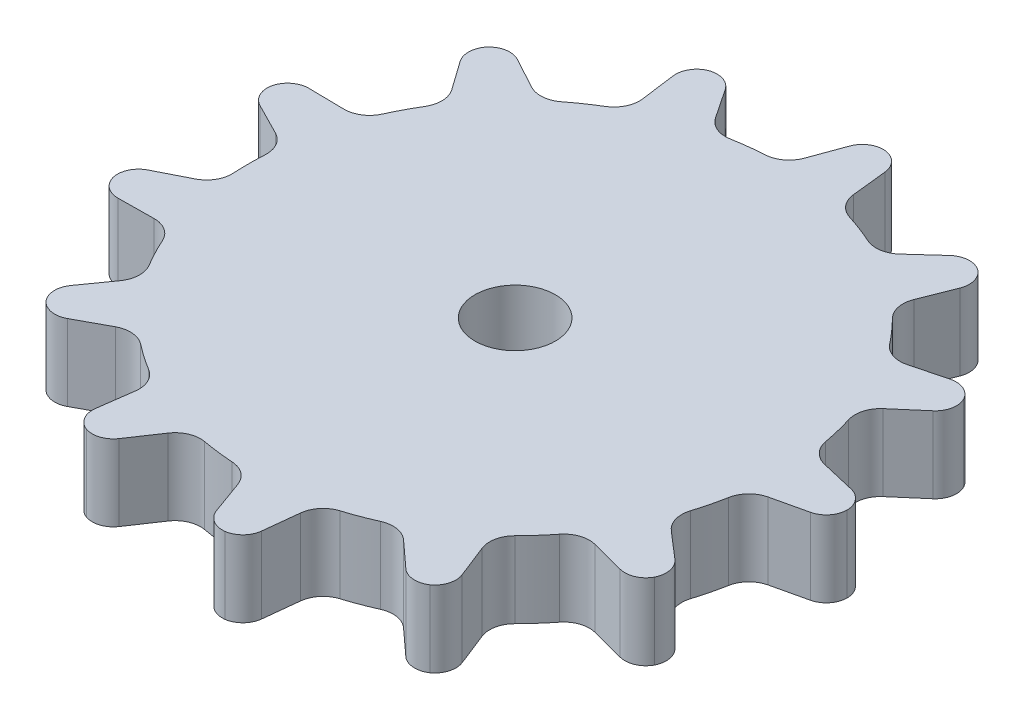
ISO-10303-21;
HEADER;
FILE_DESCRIPTION(('STEP AP214'),'2;1');
FILE_NAME('part.step','',(''),(''),'','','');
FILE_SCHEMA(('AUTOMOTIVE_DESIGN { 1 0 10303 214 1 1 1 1 }'));
ENDSEC;
DATA;
#1=APPLICATION_CONTEXT('core data for automotive mechanical design processes');
#2=APPLICATION_PROTOCOL_DEFINITION('international standard','automotive_design',2000,#1);
#3=PRODUCT_CONTEXT('',#1,'mechanical');
#4=PRODUCT('Part','Part','',(#3));
#5=PRODUCT_RELATED_PRODUCT_CATEGORY('part','',(#4));
#6=PRODUCT_DEFINITION_FORMATION('','',#4);
#7=PRODUCT_DEFINITION_CONTEXT('part definition',#1,'design');
#8=PRODUCT_DEFINITION('design','',#6,#7);
#9=PRODUCT_DEFINITION_SHAPE('','',#8);
#10=(LENGTH_UNIT() NAMED_UNIT(*) SI_UNIT(.MILLI.,.METRE.));
#11=(NAMED_UNIT(*) PLANE_ANGLE_UNIT() SI_UNIT($,.RADIAN.));
#12=(NAMED_UNIT(*) SI_UNIT($,.STERADIAN.) SOLID_ANGLE_UNIT());
#13=UNCERTAINTY_MEASURE_WITH_UNIT(LENGTH_MEASURE(1.E-05),#10,'distance_accuracy_value','');
#14=(GEOMETRIC_REPRESENTATION_CONTEXT(3) GLOBAL_UNCERTAINTY_ASSIGNED_CONTEXT((#13)) GLOBAL_UNIT_ASSIGNED_CONTEXT((#10,
#11,#12)) REPRESENTATION_CONTEXT('',''));
#15=CARTESIAN_POINT('',(0.,0.,0.));
#16=DIRECTION('',(0.,0.,1.));
#17=DIRECTION('',(1.,0.,0.));
#18=AXIS2_PLACEMENT_3D('',#15,#16,#17);
#19=CARTESIAN_POINT('',(-56.3406244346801,9.,-32.5178096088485));
#20=DIRECTION('',(0.,1.,0.));
#21=DIRECTION('',(-0.121869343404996,0.,0.992546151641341));
#22=AXIS2_PLACEMENT_3D('',#19,#20,#21);
#23=PLANE('',#22);
#24=CARTESIAN_POINT('',(-56.3406244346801,9.,-32.5178096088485));
#25=DIRECTION('',(0.,1.,0.));
#26=DIRECTION('',(-0.121869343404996,0.,0.992546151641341));
#27=AXIS2_PLACEMENT_3D('',#24,#25,#26);
#28=CIRCLE('',#27,4.75);
#29=CARTESIAN_POINT('',(-56.9195038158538,9.,-27.8032153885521));
#30=VERTEX_POINT('',#29);
#31=EDGE_CURVE('E1309',#30,#30,#28,.T.);
#32=ORIENTED_EDGE('',*,*,#31,.F.);
#33=EDGE_LOOP('',(#32));
#34=FACE_BOUND('',#33,.T.);
#35=CARTESIAN_POINT('',(-69.3659403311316,9.,-66.8820882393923));
#36=DIRECTION('',(0.,1.,0.));
#37=DIRECTION('',(-0.121869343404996,0.,0.992546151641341));
#38=AXIS2_PLACEMENT_3D('',#35,#36,#37);
#39=CIRCLE('',#38,2.5);
#40=CARTESIAN_POINT('',(-67.2877325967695,9.,-68.2717114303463));
#41=VERTEX_POINT('',#40);
#42=CARTESIAN_POINT('',(-70.209446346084,9.,-69.2354895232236));
#43=VERTEX_POINT('',#42);
#44=EDGE_CURVE('E1221',#41,#43,#39,.T.);
#45=ORIENTED_EDGE('',*,*,#44,.T.);
#46=CARTESIAN_POINT('',(-69.2864611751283,9.,-66.9121087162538));
#47=DIRECTION('',(0.,1.,0.));
#48=DIRECTION('',(-0.121869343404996,0.,0.992546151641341));
#49=AXIS2_PLACEMENT_3D('',#46,#47,#48);
#50=CIRCLE('',#49,2.5);
#51=CARTESIAN_POINT('',(-71.764411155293,9.,-66.5808023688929));
#52=VERTEX_POINT('',#51);
#53=EDGE_CURVE('E1225',#43,#52,#50,.T.);
#54=ORIENTED_EDGE('',*,*,#53,.T.);
#55=DIRECTION('',(-0.132522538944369,0.,-0.99117999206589));
#56=VECTOR('',#55,1.);
#57=CARTESIAN_POINT('',(-72.0209585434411,9.,-68.4996053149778));
#58=LINE('',#57,#56);
#59=CARTESIAN_POINT('',(-71.2110910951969,9.,-62.4423382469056));
#60=VERTEX_POINT('',#59);
#61=EDGE_CURVE('E612',#60,#52,#58,.T.);
#62=ORIENTED_EDGE('',*,*,#61,.F.);
#63=CARTESIAN_POINT('',(-74.1846310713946,9.,-62.0447706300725));
#64=DIRECTION('',(0.,1.,0.));
#65=DIRECTION('',(-0.353349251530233,0.,-0.935491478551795));
#66=AXIS2_PLACEMENT_3D('',#63,#64,#65);
#67=CIRCLE('',#66,2.99999999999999);
#68=CARTESIAN_POINT('',(-72.632978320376,9.,-59.47720880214));
#69=VERTEX_POINT('',#68);
#70=EDGE_CURVE('E1063',#69,#60,#67,.T.);
#71=ORIENTED_EDGE('',*,*,#70,.F.);
#72=CARTESIAN_POINT('',(-56.3406244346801,9.,-32.5178096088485));
#73=DIRECTION('',(0.,-1.,0.));
#74=DIRECTION('',(0.747619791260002,0.,0.664126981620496));
#75=AXIS2_PLACEMENT_3D('',#72,#73,#74);
#76=CIRCLE('',#75,31.5);
#77=CARTESIAN_POINT('',(-75.7041085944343,9.,-57.3634426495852));
#78=VERTEX_POINT('',#77);
#79=EDGE_CURVE('E601',#78,#69,#76,.T.);
#80=ORIENTED_EDGE('',*,*,#79,.F.);
#81=CARTESIAN_POINT('',(-77.5482499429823,9.,-59.7296934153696));
#82=DIRECTION('',(0.,1.,0.));
#83=DIRECTION('',(0.747619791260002,0.,0.664126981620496));
#84=AXIS2_PLACEMENT_3D('',#81,#82,#83);
#85=CIRCLE('',#84,3.);
#86=CARTESIAN_POINT('',(-78.9814956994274,9.,-57.094203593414));
#87=VERTEX_POINT('',#86);
#88=EDGE_CURVE('E628',#87,#78,#85,.T.);
#89=ORIENTED_EDGE('',*,*,#88,.F.);
#90=DIRECTION('',(0.87849660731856,0.,0.477748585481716));
#91=VECTOR('',#90,1.);
#92=CARTESIAN_POINT('',(-84.3501357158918,9.,-60.0138052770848));
#93=LINE('',#92,#91);
#94=CARTESIAN_POINT('',(-82.6494739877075,9.,-59.0889425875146));
#95=VERTEX_POINT('',#94);
#96=EDGE_CURVE('E626',#95,#87,#93,.T.);
#97=ORIENTED_EDGE('',*,*,#96,.F.);
#98=CARTESIAN_POINT('',(-83.8438454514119,9.,-56.8927010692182));
#99=DIRECTION('',(0.,1.,0.));
#100=DIRECTION('',(-0.121869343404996,0.,0.992546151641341));
#101=AXIS2_PLACEMENT_3D('',#98,#99,#100);
#102=CIRCLE('',#101,2.5);
#103=CARTESIAN_POINT('',(-85.6844130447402,9.,-58.5845376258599));
#104=VERTEX_POINT('',#103);
#105=EDGE_CURVE('E1205',#95,#104,#102,.T.);
#106=ORIENTED_EDGE('',*,*,#105,.T.);
#107=CARTESIAN_POINT('',(-83.7874213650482,9.,-56.9562186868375));
#108=DIRECTION('',(0.,1.,0.));
#109=DIRECTION('',(-0.121869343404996,0.,0.992546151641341));
#110=AXIS2_PLACEMENT_3D('',#107,#108,#109);
#111=CIRCLE('',#110,2.5);
#112=CARTESIAN_POINT('',(-85.8275713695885,9.,-55.5113007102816));
#113=VERTEX_POINT('',#112);
#114=EDGE_CURVE('E1210',#104,#113,#111,.T.);
#115=ORIENTED_EDGE('',*,*,#114,.T.);
#116=DIRECTION('',(-0.577967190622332,0.,-0.816060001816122));
#117=VECTOR('',#116,1.);
#118=CARTESIAN_POINT('',(-86.9464449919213,9.,-57.091092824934));
#119=LINE('',#118,#117);
#120=CARTESIAN_POINT('',(-83.4143906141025,9.,-52.1040133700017));
#121=VERTEX_POINT('',#120);
#122=EDGE_CURVE('E1249',#121,#113,#119,.T.);
#123=ORIENTED_EDGE('',*,*,#122,.F.);
#124=CARTESIAN_POINT('',(-85.8625706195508,9.,-50.3701117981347));
#125=DIRECTION('',(0.,1.,0.));
#126=DIRECTION('',(-0.747619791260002,0.,-0.664126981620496));
#127=AXIS2_PLACEMENT_3D('',#124,#125,#126);
#128=CIRCLE('',#127,2.99999999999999);
#129=CARTESIAN_POINT('',(-83.2954448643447,9.,-48.8177376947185));
#130=VERTEX_POINT('',#129);
#131=EDGE_CURVE('E1253',#130,#121,#128,.T.);
#132=ORIENTED_EDGE('',*,*,#131,.F.);
#133=CARTESIAN_POINT('',(-56.3406244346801,9.,-32.5178096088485));
#134=DIRECTION('',(0.,-1.,0.));
#135=DIRECTION('',(0.970619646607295,0.,0.240618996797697));
#136=AXIS2_PLACEMENT_3D('',#133,#134,#135);
#137=CIRCLE('',#136,31.5);
#138=CARTESIAN_POINT('',(-85.0324795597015,9.,-45.518865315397));
#139=VERTEX_POINT('',#138);
#140=EDGE_CURVE('E657',#139,#130,#137,.T.);
#141=ORIENTED_EDGE('',*,*,#140,.F.);
#142=CARTESIAN_POINT('',(-87.765037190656,9.,-46.7570610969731));
#143=DIRECTION('',(0.,1.,0.));
#144=DIRECTION('',(0.970619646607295,0.,0.240618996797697));
#145=AXIS2_PLACEMENT_3D('',#142,#143,#144);
#146=CIRCLE('',#145,3.);
#147=CARTESIAN_POINT('',(-87.8093400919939,9.,-43.7573882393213));
#148=VERTEX_POINT('',#147);
#149=EDGE_CURVE('E666',#148,#139,#146,.T.);
#150=ORIENTED_EDGE('',*,*,#149,.F.);
#151=DIRECTION('',(0.999890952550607,0.,0.0147676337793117));
#152=VECTOR('',#151,1.);
#153=CARTESIAN_POINT('',(-93.9198412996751,9.,-43.8476357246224));
#154=LINE('',#153,#152);
#155=CARTESIAN_POINT('',(-91.9841750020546,9.,-43.8190473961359));
#156=VERTEX_POINT('',#155);
#157=EDGE_CURVE('E664',#156,#148,#154,.T.);
#158=ORIENTED_EDGE('',*,*,#157,.F.);
#159=CARTESIAN_POINT('',(-92.0210940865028,9.,-41.3193200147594));
#160=DIRECTION('',(0.,1.,0.));
#161=DIRECTION('',(-0.121869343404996,0.,0.992546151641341));
#162=AXIS2_PLACEMENT_3D('',#159,#160,#161);
#163=CIRCLE('',#162,2.5);
#164=CARTESIAN_POINT('',(-94.4370714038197,9.,-41.9620124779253));
#165=VERTEX_POINT('',#164);
#166=EDGE_CURVE('E1189',#156,#165,#163,.T.);
#167=ORIENTED_EDGE('',*,*,#166,.T.);
#168=CARTESIAN_POINT('',(-92.0006511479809,9.,-41.40178365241));
#169=DIRECTION('',(0.,1.,0.));
#170=DIRECTION('',(-0.121869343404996,0.,0.992546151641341));
#171=AXIS2_PLACEMENT_3D('',#168,#169,#170);
#172=CIRCLE('',#171,2.5);
#173=CARTESIAN_POINT('',(-93.1356273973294,9.,-39.1742673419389));
#174=VERTEX_POINT('',#173);
#175=EDGE_CURVE('E1194',#165,#174,#172,.T.);
#176=ORIENTED_EDGE('',*,*,#175,.T.);
#177=DIRECTION('',(-0.891006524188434,0.,-0.453990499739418));
#178=VECTOR('',#177,1.);
#179=CARTESIAN_POINT('',(-94.8605067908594,9.,-40.0531372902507));
#180=LINE('',#179,#178);
#181=CARTESIAN_POINT('',(-89.4154165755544,9.,-37.2787252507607));
#182=VERTEX_POINT('',#181);
#183=EDGE_CURVE('E1280',#182,#174,#180,.T.);
#184=ORIENTED_EDGE('',*,*,#183,.F.);
#185=CARTESIAN_POINT('',(-90.7773880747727,9.,-34.6057056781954));
#186=DIRECTION('',(0.,1.,0.));
#187=DIRECTION('',(-0.970619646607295,0.,-0.240618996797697));
#188=AXIS2_PLACEMENT_3D('',#185,#186,#187);
#189=CIRCLE('',#188,2.99999999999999);
#190=CARTESIAN_POINT('',(-87.7828868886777,9.,-34.4241494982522));
#191=VERTEX_POINT('',#190);
#192=EDGE_CURVE('E633',#191,#182,#189,.T.);
#193=ORIENTED_EDGE('',*,*,#192,.F.);
#194=CARTESIAN_POINT('',(-56.3406244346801,9.,-32.5178096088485));
#195=DIRECTION('',(0.,-1.,0.));
#196=DIRECTION('',(0.971262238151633,0.,-0.238011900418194));
#197=AXIS2_PLACEMENT_3D('',#194,#195,#196);
#198=CIRCLE('',#197,31.5);
#199=CARTESIAN_POINT('',(-87.7878922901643,9.,-30.6959027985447));
#200=VERTEX_POINT('',#199);
#201=EDGE_CURVE('E696',#200,#191,#198,.T.);
#202=ORIENTED_EDGE('',*,*,#201,.F.);
#203=CARTESIAN_POINT('',(-90.7828701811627,9.,-30.52238786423));
#204=DIRECTION('',(0.,1.,0.));
#205=DIRECTION('',(0.971262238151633,0.,-0.238011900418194));
#206=AXIS2_PLACEMENT_3D('',#203,#204,#205);
#207=CIRCLE('',#206,3.);
#208=CARTESIAN_POINT('',(-89.4280809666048,9.,-27.8457208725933));
#209=VERTEX_POINT('',#208);
#210=EDGE_CURVE('E704',#209,#200,#207,.T.);
#211=ORIENTED_EDGE('',*,*,#210,.F.);
#212=DIRECTION('',(0.892222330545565,0.,-0.451596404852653));
#213=VECTOR('',#212,1.);
#214=CARTESIAN_POINT('',(-94.8806011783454,9.,-25.0859395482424));
#215=LINE('',#214,#213);
#216=CARTESIAN_POINT('',(-93.1533681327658,9.,-25.9601748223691));
#217=VERTEX_POINT('',#216);
#218=EDGE_CURVE('E651',#217,#209,#215,.T.);
#219=ORIENTED_EDGE('',*,*,#218,.F.);
#220=CARTESIAN_POINT('',(-92.0243771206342,9.,-23.7296189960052));
#221=DIRECTION('',(0.,1.,0.));
#222=DIRECTION('',(-0.121869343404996,0.,0.992546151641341));
#223=AXIS2_PLACEMENT_3D('',#220,#221,#222);
#224=CIRCLE('',#223,2.5);
#225=CARTESIAN_POINT('',(-94.462292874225,9.,-23.1759342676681));
#226=VERTEX_POINT('',#225);
#227=EDGE_CURVE('E1173',#217,#226,#224,.T.);
#228=ORIENTED_EDGE('',*,*,#227,.T.);
#229=CARTESIAN_POINT('',(-92.0445985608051,9.,-23.8121372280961));
#230=DIRECTION('',(0.,1.,0.));
#231=DIRECTION('',(-0.121869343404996,0.,0.992546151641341));
#232=AXIS2_PLACEMENT_3D('',#229,#230,#231);
#233=CIRCLE('',#232,2.5);
#234=CARTESIAN_POINT('',(-92.0143916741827,9.,-21.312319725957));
#235=VERTEX_POINT('',#234);
#236=EDGE_CURVE('E1178',#226,#235,#233,.T.);
#237=ORIENTED_EDGE('',*,*,#236,.T.);
#238=DIRECTION('',(-0.999927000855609,0.,0.012082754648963));
#239=VECTOR('',#238,1.);
#240=CARTESIAN_POINT('',(-93.9501277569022,9.,-21.288928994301));
#241=LINE('',#240,#239);
#242=CARTESIAN_POINT('',(-87.8394062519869,9.,-21.3627687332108));
#243=VERTEX_POINT('',#242);
#244=EDGE_CURVE('E639',#243,#235,#241,.T.);
#245=ORIENTED_EDGE('',*,*,#244,.F.);
#246=CARTESIAN_POINT('',(-87.8031579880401,9.,-18.362987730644));
#247=DIRECTION('',(0.,1.,0.));
#248=DIRECTION('',(-0.971262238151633,0.,0.238011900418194));
#249=AXIS2_PLACEMENT_3D('',#246,#247,#248);
#250=CIRCLE('',#249,2.99999999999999);
#251=CARTESIAN_POINT('',(-85.0672855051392,9.,-19.5938418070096));
#252=VERTEX_POINT('',#251);
#253=EDGE_CURVE('E643',#252,#243,#250,.T.);
#254=ORIENTED_EDGE('',*,*,#253,.F.);
#255=CARTESIAN_POINT('',(-56.3406244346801,9.,-32.5178096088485));
#256=DIRECTION('',(0.,-1.,0.));
#257=DIRECTION('',(0.749400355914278,0.,-0.662117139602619));
#258=AXIS2_PLACEMENT_3D('',#255,#256,#257);
#259=CIRCLE('',#258,31.5);
#260=CARTESIAN_POINT('',(-83.3391149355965,9.,-16.2903171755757));
#261=VERTEX_POINT('',#260);
#262=EDGE_CURVE('E733',#261,#252,#259,.T.);
#263=ORIENTED_EDGE('',*,*,#262,.F.);
#264=CARTESIAN_POINT('',(-85.9103997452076,9.,-14.7448417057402));
#265=DIRECTION('',(0.,1.,0.));
#266=DIRECTION('',(0.749400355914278,0.,-0.662117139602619));
#267=AXIS2_PLACEMENT_3D('',#264,#265,#266);
#268=CIRCLE('',#267,3.);
#269=CARTESIAN_POINT('',(-83.466884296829,9.,-13.0043727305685));
#270=VERTEX_POINT('',#269);
#271=EDGE_CURVE('E741',#270,#261,#268,.T.);
#272=ORIENTED_EDGE('',*,*,#271,.F.);
#273=DIRECTION('',(0.580156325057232,0.,-0.814505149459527));
#274=VECTOR('',#273,1.);
#275=CARTESIAN_POINT('',(-87.0123168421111,9.,-8.02679523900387));
#276=LINE('',#275,#274);
#277=CARTESIAN_POINT('',(-85.8892053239,9.,-9.60357735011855));
#278=VERTEX_POINT('',#277);
#279=EDGE_CURVE('E690',#278,#270,#276,.T.);
#280=ORIENTED_EDGE('',*,*,#279,.F.);
#281=CARTESIAN_POINT('',(-83.8529424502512,9.,-8.15318653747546));
#282=DIRECTION('',(0.,1.,0.));
#283=DIRECTION('',(-0.121869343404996,0.,0.992546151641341));
#284=AXIS2_PLACEMENT_3D('',#281,#282,#283);
#285=CIRCLE('',#284,2.5);
#286=CARTESIAN_POINT('',(-85.754299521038,9.,-6.52996711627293));
#287=VERTEX_POINT('',#286);
#288=EDGE_CURVE('E1157',#278,#287,#285,.T.);
#289=ORIENTED_EDGE('',*,*,#288,.T.);
#290=CARTESIAN_POINT('',(-83.9091957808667,9.,-8.21685543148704));
#291=DIRECTION('',(0.,1.,0.));
#292=DIRECTION('',(-0.121869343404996,0.,0.992546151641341));
#293=AXIS2_PLACEMENT_3D('',#290,#291,#292);
#294=CIRCLE('',#293,2.5);
#295=CARTESIAN_POINT('',(-82.7207257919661,9.,-6.01741480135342));
#296=VERTEX_POINT('',#295);
#297=EDGE_CURVE('E1162',#287,#296,#294,.T.);
#298=ORIENTED_EDGE('',*,*,#297,.T.);
#299=DIRECTION('',(-0.879776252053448,0.,0.475387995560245));
#300=VECTOR('',#299,1.);
#301=CARTESIAN_POINT('',(-84.4238647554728,9.,-5.09712192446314));
#302=LINE('',#301,#300);
#303=CARTESIAN_POINT('',(-79.047404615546,9.,-8.00229764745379));
#304=VERTEX_POINT('',#303);
#305=EDGE_CURVE('E678',#304,#296,#302,.T.);
#306=ORIENTED_EDGE('',*,*,#305,.F.);
#307=CARTESIAN_POINT('',(-77.6212406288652,9.,-5.36296889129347));
#308=DIRECTION('',(0.,1.,0.));
#309=DIRECTION('',(-0.749400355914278,0.,0.662117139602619));
#310=AXIS2_PLACEMENT_3D('',#307,#308,#309);
#311=CIRCLE('',#310,2.99999999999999);
#312=CARTESIAN_POINT('',(-75.7707522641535,9.,-7.72425938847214));
#313=VERTEX_POINT('',#312);
#314=EDGE_CURVE('E682',#313,#304,#311,.T.);
#315=ORIENTED_EDGE('',*,*,#314,.F.);
#316=CARTESIAN_POINT('',(-56.3406244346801,9.,-32.5178096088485));
#317=DIRECTION('',(0.,-1.,0.));
#318=DIRECTION('',(0.35585988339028,0.,-0.934539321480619));
#319=AXIS2_PLACEMENT_3D('',#316,#317,#318);
#320=CIRCLE('',#319,31.5);
#321=CARTESIAN_POINT('',(-72.7053087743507,9.,-5.60225450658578));
#322=VERTEX_POINT('',#321);
#323=EDGE_CURVE('E770',#322,#313,#320,.T.);
#324=ORIENTED_EDGE('',*,*,#323,.F.);
#325=CARTESIAN_POINT('',(-74.2638501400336,9.,-3.03886830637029));
#326=DIRECTION('',(0.,1.,0.));
#327=DIRECTION('',(0.35585988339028,0.,-0.934539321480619));
#328=AXIS2_PLACEMENT_3D('',#325,#326,#327);
#329=CIRCLE('',#328,3.);
#330=CARTESIAN_POINT('',(-71.2913883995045,9.,-2.63331781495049));
#331=VERTEX_POINT('',#330);
#332=EDGE_CURVE('E778',#331,#322,#329,.T.);
#333=ORIENTED_EDGE('',*,*,#332,.F.);
#334=DIRECTION('',(0.135183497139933,0.,-0.99082058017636));
#335=VECTOR('',#334,1.);
#336=CARTESIAN_POINT('',(-72.117517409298,9.,3.42175282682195));
#337=LINE('',#336,#335);
#338=CARTESIAN_POINT('',(-71.8558187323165,9.,1.50364565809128));
#339=VERTEX_POINT('',#338);
#340=EDGE_CURVE('E727',#339,#331,#337,.T.);
#341=ORIENTED_EDGE('',*,*,#340,.F.);
#342=CARTESIAN_POINT('',(-69.3787672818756,9.,1.84160440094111));
#343=DIRECTION('',(0.,1.,0.));
#344=DIRECTION('',(-0.121869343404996,0.,0.992546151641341));
#345=AXIS2_PLACEMENT_3D('',#342,#343,#344);
#346=CIRCLE('',#345,2.5);
#347=CARTESIAN_POINT('',(-70.3079876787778,9.,4.16249850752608));
#348=VERTEX_POINT('',#347);
#349=EDGE_CURVE('E1141',#339,#348,#346,.T.);
#350=ORIENTED_EDGE('',*,*,#349,.T.);
#351=CARTESIAN_POINT('',(-69.4581655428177,9.,1.81137062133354));
#352=DIRECTION('',(0.,1.,0.));
#353=DIRECTION('',(-0.121869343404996,0.,0.992546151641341));
#354=AXIS2_PLACEMENT_3D('',#351,#352,#353);
#355=CIRCLE('',#354,2.5);
#356=CARTESIAN_POINT('',(-67.38369660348,9.,3.20656903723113));
#357=VERTEX_POINT('',#356);
#358=EDGE_CURVE('E1146',#348,#357,#355,.T.);
#359=ORIENTED_EDGE('',*,*,#358,.T.);
#360=DIRECTION('',(-0.558079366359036,0.,0.829787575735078));
#361=VECTOR('',#360,1.);
#362=CARTESIAN_POINT('',(-68.4640698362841,9.,4.81293605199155));
#363=LINE('',#362,#361);
#364=CARTESIAN_POINT('',(-65.0535532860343,9.,-0.258034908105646));
#365=VERTEX_POINT('',#364);
#366=EDGE_CURVE('E715',#365,#357,#363,.T.);
#367=ORIENTED_EDGE('',*,*,#366,.F.);
#368=CARTESIAN_POINT('',(-62.5641905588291,9.,1.41620319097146));
#369=DIRECTION('',(0.,1.,0.));
#370=DIRECTION('',(-0.35585988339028,0.,0.934539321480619));
#371=AXIS2_PLACEMENT_3D('',#368,#369,#370);
#372=CIRCLE('',#371,2.99999999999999);
#373=CARTESIAN_POINT('',(-62.0230108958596,9.,-1.53458053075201));
#374=VERTEX_POINT('',#373);
#375=EDGE_CURVE('E719',#374,#365,#372,.T.);
#376=ORIENTED_EDGE('',*,*,#375,.F.);
#377=CARTESIAN_POINT('',(-56.3406244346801,9.,-32.5178096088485));
#378=DIRECTION('',(0.,-1.,0.));
#379=DIRECTION('',(-0.119203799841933,0.,-0.992869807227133));
#380=AXIS2_PLACEMENT_3D('',#377,#378,#379);
#381=CIRCLE('',#380,31.5);
#382=CARTESIAN_POINT('',(-58.3225506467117,9.,-1.08022114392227));
#383=VERTEX_POINT('',#382);
#384=EDGE_CURVE('E807',#383,#374,#381,.T.);
#385=ORIENTED_EDGE('',*,*,#384,.F.);
#386=CARTESIAN_POINT('',(-58.5113055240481,9.,1.9138349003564));
#387=DIRECTION('',(0.,1.,0.));
#388=DIRECTION('',(-0.119203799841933,0.,-0.992869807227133));
#389=AXIS2_PLACEMENT_3D('',#386,#387,#388);
#390=CIRCLE('',#389,3.);
#391=CARTESIAN_POINT('',(-55.6908526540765,9.,0.891560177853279));
#392=VERTEX_POINT('',#391);
#393=EDGE_CURVE('E815',#392,#383,#390,.T.);
#394=ORIENTED_EDGE('',*,*,#393,.F.);
#395=DIRECTION('',(-0.340758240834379,0.,-0.940150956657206));
#396=VECTOR('',#395,1.);
#397=CARTESIAN_POINT('',(-53.6084219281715,9.,6.63698025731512));
#398=LINE('',#397,#396);
#399=CARTESIAN_POINT('',(-54.2680881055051,9.,4.81696326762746));
#400=VERTEX_POINT('',#399);
#401=EDGE_CURVE('E764',#400,#392,#398,.T.);
#402=ORIENTED_EDGE('',*,*,#401,.F.);
#403=CARTESIAN_POINT('',(-51.9177107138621,9.,3.96506766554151));
#404=DIRECTION('',(0.,1.,0.));
#405=DIRECTION('',(-0.121869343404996,0.,0.992546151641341));
#406=AXIS2_PLACEMENT_3D('',#403,#404,#405);
#407=CIRCLE('',#406,2.5);
#408=CARTESIAN_POINT('',(-51.6619212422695,9.,6.4519475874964));
#409=VERTEX_POINT('',#408);
#410=EDGE_CURVE('E1125',#400,#409,#407,.T.);
#411=ORIENTED_EDGE('',*,*,#410,.T.);
#412=CARTESIAN_POINT('',(-52.0020647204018,9.,3.97519519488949));
#413=DIRECTION('',(0.,1.,0.));
#414=DIRECTION('',(-0.121869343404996,0.,0.992546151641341));
#415=AXIS2_PLACEMENT_3D('',#412,#413,#414);
#416=CIRCLE('',#415,2.5);
#417=CARTESIAN_POINT('',(-49.5168326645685,9.,4.24652825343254));
#418=VERTEX_POINT('',#417);
#419=EDGE_CURVE('E1130',#409,#418,#416,.T.);
#420=ORIENTED_EDGE('',*,*,#419,.T.);
#421=DIRECTION('',(-0.108533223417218,0.,0.994092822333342));
#422=VECTOR('',#421,1.);
#423=CARTESIAN_POINT('',(-49.7269396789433,9.,6.17097008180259));
#424=LINE('',#423,#422);
#425=CARTESIAN_POINT('',(-49.0636749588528,9.,0.095902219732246));
#426=VERTEX_POINT('',#425);
#427=EDGE_CURVE('E752',#426,#418,#424,.T.);
#428=ORIENTED_EDGE('',*,*,#427,.F.);
#429=CARTESIAN_POINT('',(-46.0813964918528,9.,0.421501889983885));
#430=DIRECTION('',(0.,1.,0.));
#431=DIRECTION('',(0.119203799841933,0.,0.992869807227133));
#432=AXIS2_PLACEMENT_3D('',#429,#430,#431);
#433=CIRCLE('',#432,2.99999999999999);
#434=CARTESIAN_POINT('',(-46.97350326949,9.,-2.44278606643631));
#435=VERTEX_POINT('',#434);
#436=EDGE_CURVE('E756',#435,#426,#433,.T.);
#437=ORIENTED_EDGE('',*,*,#436,.F.);
#438=CARTESIAN_POINT('',(-56.3406244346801,9.,-32.5178096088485));
#439=DIRECTION('',(0.,-1.,0.));
#440=DIRECTION('',(-0.566959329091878,0.,-0.823745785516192));
#441=AXIS2_PLACEMENT_3D('',#438,#439,#440);
#442=CIRCLE('',#441,31.5);
#443=CARTESIAN_POINT('',(-43.4857571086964,9.,-3.7601604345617));
#444=VERTEX_POINT('',#443);
#445=EDGE_CURVE('E844',#444,#435,#442,.T.);
#446=ORIENTED_EDGE('',*,*,#445,.F.);
#447=CARTESIAN_POINT('',(-42.2614840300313,9.,-1.02133670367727));
#448=DIRECTION('',(0.,1.,0.));
#449=DIRECTION('',(-0.566959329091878,0.,-0.823745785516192));
#450=AXIS2_PLACEMENT_3D('',#447,#448,#449);
#451=CIRCLE('',#450,3.);
#452=CARTESIAN_POINT('',(-40.2391717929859,9.,-3.23724582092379));
#453=VERTEX_POINT('',#452);
#454=EDGE_CURVE('E852',#453,#444,#451,.T.);
#455=ORIENTED_EDGE('',*,*,#454,.F.);
#456=DIRECTION('',(-0.73863637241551,0.,-0.674104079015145));
#457=VECTOR('',#456,1.);
#458=CARTESIAN_POINT('',(-35.7252411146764,9.,0.88231719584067));
#459=LINE('',#458,#457);
#460=CARTESIAN_POINT('',(-37.1551505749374,9.,-0.422665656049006));
#461=VERTEX_POINT('',#460);
#462=EDGE_CURVE('E801',#461,#453,#459,.T.);
#463=ORIENTED_EDGE('',*,*,#462,.F.);
#464=CARTESIAN_POINT('',(-35.4698903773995,9.,-2.26925658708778));
#465=DIRECTION('',(0.,1.,0.));
#466=DIRECTION('',(-0.121869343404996,0.,0.992546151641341));
#467=AXIS2_PLACEMENT_3D('',#464,#465,#466);
#468=CIRCLE('',#467,2.5);
#469=CARTESIAN_POINT('',(-34.087689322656,9.,-0.186105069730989));
#470=VERTEX_POINT('',#469);
#471=EDGE_CURVE('E1109',#461,#470,#468,.T.);
#472=ORIENTED_EDGE('',*,*,#471,.T.);
#473=CARTESIAN_POINT('',(-35.5398756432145,9.,-2.22108784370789));
#474=DIRECTION('',(0.,1.,0.));
#475=DIRECTION('',(-0.121869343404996,0.,0.992546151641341));
#476=AXIS2_PLACEMENT_3D('',#473,#474,#475);
#477=CIRCLE('',#476,2.5);
#478=CARTESIAN_POINT('',(-33.2132171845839,9.,-3.13577927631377));
#479=VERTEX_POINT('',#478);
#480=EDGE_CURVE('E1114',#470,#479,#477,.T.);
#481=ORIENTED_EDGE('',*,*,#480,.T.);
#482=DIRECTION('',(0.365876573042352,0.,0.930663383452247));
#483=VECTOR('',#482,1.);
#484=CARTESIAN_POINT('',(-32.5049249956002,9.,-1.33412906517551));
#485=LINE('',#484,#483);
#486=CARTESIAN_POINT('',(-34.7408580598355,9.,-7.02156899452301));
#487=VERTEX_POINT('',#486);
#488=EDGE_CURVE('E789',#487,#479,#485,.T.);
#489=ORIENTED_EDGE('',*,*,#488,.F.);
#490=CARTESIAN_POINT('',(-31.9488679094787,9.,-8.11919871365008));
#491=DIRECTION('',(0.,1.,0.));
#492=DIRECTION('',(0.566959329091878,0.,0.823745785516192));
#493=AXIS2_PLACEMENT_3D('',#490,#491,#492);
#494=CIRCLE('',#493,2.99999999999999);
#495=CARTESIAN_POINT('',(-34.069890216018,9.,-10.240817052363));
#496=VERTEX_POINT('',#495);
#497=EDGE_CURVE('E793',#496,#487,#494,.T.);
#498=ORIENTED_EDGE('',*,*,#497,.F.);
#499=CARTESIAN_POINT('',(-56.3406244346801,9.,-32.5178096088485));
#500=DIRECTION('',(0.,-1.,0.));
#501=DIRECTION('',(-0.884831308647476,0.,-0.465911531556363));
#502=AXIS2_PLACEMENT_3D('',#499,#500,#501);
#503=CIRCLE('',#502,31.5);
#504=CARTESIAN_POINT('',(-31.5938587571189,9.,-13.0281305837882));
#505=VERTEX_POINT('',#504);
#506=EDGE_CURVE('E881',#505,#496,#503,.T.);
#507=ORIENTED_EDGE('',*,*,#506,.F.);
#508=CARTESIAN_POINT('',(-29.2370239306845,9.,-11.1719706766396));
#509=DIRECTION('',(0.,1.,0.));
#510=DIRECTION('',(-0.884831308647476,0.,-0.465911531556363));
#511=AXIS2_PLACEMENT_3D('',#508,#509,#510);
#512=CIRCLE('',#511,3.);
#513=CARTESIAN_POINT('',(-28.4761396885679,9.,-14.0738761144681));
#514=VERTEX_POINT('',#513);
#515=EDGE_CURVE('E889',#514,#505,#512,.T.);
#516=ORIENTED_EDGE('',*,*,#515,.F.);
#517=DIRECTION('',(-0.967301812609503,0.,-0.253628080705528));
#518=VECTOR('',#517,1.);
#519=CARTESIAN_POINT('',(-22.5647961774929,9.,-12.5239124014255));
#520=LINE('',#519,#518);
#521=CARTESIAN_POINT('',(-24.4373738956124,9.,-13.0149052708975));
#522=VERTEX_POINT('',#521);
#523=EDGE_CURVE('E838',#522,#514,#520,.T.);
#524=ORIENTED_EDGE('',*,*,#523,.F.);
#525=CARTESIAN_POINT('',(-23.8033036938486,9.,-15.4331598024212));
#526=DIRECTION('',(0.,1.,0.));
#527=DIRECTION('',(-0.121869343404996,0.,0.992546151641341));
#528=AXIS2_PLACEMENT_3D('',#525,#526,#527);
#529=CIRCLE('',#528,2.5);
#530=CARTESIAN_POINT('',(-21.611336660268,9.,-14.2309615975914));
#531=VERTEX_POINT('',#530);
#532=EDGE_CURVE('E1093',#522,#531,#529,.T.);
#533=ORIENTED_EDGE('',*,*,#532,.T.);
#534=CARTESIAN_POINT('',(-23.8428874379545,9.,-15.3579847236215));
#535=DIRECTION('',(0.,1.,0.));
#536=DIRECTION('',(-0.121869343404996,0.,0.992546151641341));
#537=AXIS2_PLACEMENT_3D('',#534,#535,#536);
#538=CIRCLE('',#537,2.5);
#539=CARTESIAN_POINT('',(-22.2078119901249,9.,-17.249155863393));
#540=VERTEX_POINT('',#539);
#541=EDGE_CURVE('E1098',#531,#540,#538,.T.);
#542=ORIENTED_EDGE('',*,*,#541,.T.);
#543=DIRECTION('',(0.756468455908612,0.,0.65403017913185));
#544=VECTOR('',#543,1.);
#545=CARTESIAN_POINT('',(-20.7433818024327,9.,-15.9830336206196));
#546=LINE('',#545,#544);
#547=CARTESIAN_POINT('',(-25.3662873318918,9.,-19.9799216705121));
#548=VERTEX_POINT('',#547);
#549=EDGE_CURVE('E826',#548,#540,#546,.T.);
#550=ORIENTED_EDGE('',*,*,#549,.F.);
#551=CARTESIAN_POINT('',(-23.4041967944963,9.,-22.2493270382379));
#552=DIRECTION('',(0.,1.,0.));
#553=DIRECTION('',(0.884831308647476,0.,0.465911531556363));
#554=AXIS2_PLACEMENT_3D('',#551,#552,#553);
#555=CIRCLE('',#554,2.99999999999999);
#556=CARTESIAN_POINT('',(-26.2682339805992,9.,-23.1422385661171));
#557=VERTEX_POINT('',#556);
#558=EDGE_CURVE('E830',#557,#548,#555,.T.);
#559=ORIENTED_EDGE('',*,*,#558,.F.);
#560=CARTESIAN_POINT('',(-56.3406244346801,9.,-32.5178096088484));
#561=DIRECTION('',(0.,-1.,0.));
#562=DIRECTION('',(-0.999999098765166,0.,-0.00134256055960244));
#563=AXIS2_PLACEMENT_3D('',#560,#561,#562);
#564=CIRCLE('',#563,31.5);
#565=CARTESIAN_POINT('',(-25.3711461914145,9.,-26.760951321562));
#566=VERTEX_POINT('',#565);
#567=EDGE_CURVE('E918',#566,#557,#564,.T.);
#568=ORIENTED_EDGE('',*,*,#567,.F.);
#569=CARTESIAN_POINT('',(-22.4216720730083,9.,-26.2126791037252));
#570=DIRECTION('',(0.,1.,0.));
#571=DIRECTION('',(-0.999999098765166,0.,-0.00134256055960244));
#572=AXIS2_PLACEMENT_3D('',#569,#570,#571);
#573=CIRCLE('',#572,3.);
#574=CARTESIAN_POINT('',(-23.0965252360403,9.,-29.1357892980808));
#575=VERTEX_POINT('',#574);
#576=EDGE_CURVE('E926',#575,#566,#573,.T.);
#577=ORIENTED_EDGE('',*,*,#576,.F.);
#578=DIRECTION('',(-0.974370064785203,0.,0.224951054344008));
#579=VECTOR('',#578,1.);
#580=CARTESIAN_POINT('',(-17.1419864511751,9.,-30.5105028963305));
#581=LINE('',#580,#579);
#582=CARTESIAN_POINT('',(-19.0282474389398,9.,-30.0750252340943));
#583=VERTEX_POINT('',#582);
#584=EDGE_CURVE('E875',#583,#575,#581,.T.);
#585=ORIENTED_EDGE('',*,*,#584,.F.);
#586=CARTESIAN_POINT('',(-19.5906250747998,9.,-32.5109503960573));
#587=DIRECTION('',(0.,1.,0.));
#588=DIRECTION('',(-0.121869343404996,0.,0.992546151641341));
#589=AXIS2_PLACEMENT_3D('',#586,#587,#588);
#590=CIRCLE('',#589,2.5);
#591=CARTESIAN_POINT('',(-17.0910452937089,9.,-32.465114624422));
#592=VERTEX_POINT('',#591);
#593=EDGE_CURVE('E1077',#583,#592,#590,.T.);
#594=ORIENTED_EDGE('',*,*,#593,.T.);
#595=CARTESIAN_POINT('',(-19.5907391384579,9.,-32.4259906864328));
#596=DIRECTION('',(0.,1.,0.));
#597=DIRECTION('',(-0.121869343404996,0.,0.992546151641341));
#598=AXIS2_PLACEMENT_3D('',#595,#596,#597);
#599=CIRCLE('',#598,2.5);
#600=CARTESIAN_POINT('',(-19.0218227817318,9.,-34.8603970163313));
#601=VERTEX_POINT('',#600);
#602=EDGE_CURVE('E1082',#592,#601,#599,.T.);
#603=ORIENTED_EDGE('',*,*,#602,.T.);
#604=DIRECTION('',(0.973762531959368,0.,0.227566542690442));
#605=VECTOR('',#604,1.);
#606=CARTESIAN_POINT('',(-17.1367379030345,9.,-34.4198560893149));
#607=LINE('',#606,#605);
#608=CARTESIAN_POINT('',(-23.0875639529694,9.,-35.8105533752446));
#609=VERTEX_POINT('',#608);
#610=EDGE_CURVE('E863',#609,#601,#607,.T.);
#611=ORIENTED_EDGE('',*,*,#610,.F.);
#612=CARTESIAN_POINT('',(-22.4048643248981,9.,-38.7318409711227));
#613=DIRECTION('',(0.,1.,0.));
#614=DIRECTION('',(0.999999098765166,0.,0.00134256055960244));
#615=AXIS2_PLACEMENT_3D('',#612,#613,#614);
#616=CIRCLE('',#615,2.99999999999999);
#617=CARTESIAN_POINT('',(-25.3557999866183,9.,-38.1914904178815));
#618=VERTEX_POINT('',#617);
#619=EDGE_CURVE('E867',#618,#609,#616,.T.);
#620=ORIENTED_EDGE('',*,*,#619,.F.);
#621=CARTESIAN_POINT('',(-56.3406244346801,9.,-32.5178096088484));
#622=DIRECTION('',(0.,-1.,0.));
#623=DIRECTION('',(-0.886079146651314,0.,0.463533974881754));
#624=AXIS2_PLACEMENT_3D('',#621,#622,#623);
#625=CIRCLE('',#624,31.5);
#626=CARTESIAN_POINT('',(-26.2431678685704,9.,-41.8125989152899));
#627=VERTEX_POINT('',#626);
#628=EDGE_CURVE('E955',#627,#618,#625,.T.);
#629=ORIENTED_EDGE('',*,*,#628,.F.);
#630=CARTESIAN_POINT('',(-23.3767434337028,9.,-42.6978169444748));
#631=DIRECTION('',(0.,1.,0.));
#632=DIRECTION('',(-0.886079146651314,0.,0.463533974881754));
#633=AXIS2_PLACEMENT_3D('',#630,#631,#632);
#634=CIRCLE('',#633,3.);
#635=CARTESIAN_POINT('',(-25.3327332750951,9.,-44.9724825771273));
#636=VERTEX_POINT('',#635);
#637=EDGE_CURVE('E963',#636,#627,#634,.T.);
#638=ORIENTED_EDGE('',*,*,#637,.F.);
#639=DIRECTION('',(-0.758221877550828,0.,0.651996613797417));
#640=VECTOR('',#639,1.);
#641=CARTESIAN_POINT('',(-20.6991122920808,9.,-48.9569431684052));
#642=LINE('',#641,#640);
#643=CARTESIAN_POINT('',(-22.166936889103,9.,-47.6947576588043));
#644=VERTEX_POINT('',#643);
#645=EDGE_CURVE('E912',#644,#636,#642,.T.);
#646=ORIENTED_EDGE('',*,*,#645,.F.);
#647=CARTESIAN_POINT('',(-23.7969284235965,9.,-49.5903123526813));
#648=DIRECTION('',(0.,1.,0.));
#649=DIRECTION('',(-0.121869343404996,0.,0.992546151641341));
#650=AXIS2_PLACEMENT_3D('',#647,#648,#649);
#651=CIRCLE('',#650,2.5);
#652=CARTESIAN_POINT('',(-21.5623594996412,9.,-50.7113394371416));
#653=VERTEX_POINT('',#652);
#654=EDGE_CURVE('E1059',#644,#653,#651,.T.);
#655=ORIENTED_EDGE('',*,*,#654,.T.);
#656=CARTESIAN_POINT('',(-23.7575466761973,9.,-49.5150312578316));
#657=DIRECTION('',(0.,1.,0.));
#658=DIRECTION('',(-0.121869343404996,0.,0.992546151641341));
#659=AXIS2_PLACEMENT_3D('',#656,#657,#658);
#660=CIRCLE('',#659,2.5);
#661=CARTESIAN_POINT('',(-24.3851212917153,9.,-51.9349796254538));
#662=VERTEX_POINT('',#661);
#663=EDGE_CURVE('E1066',#653,#662,#660,.T.);
#664=ORIENTED_EDGE('',*,*,#663,.T.);
#665=DIRECTION('',(0.967979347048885,0.,-0.25102984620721));
#666=VECTOR('',#665,1.);
#667=CARTESIAN_POINT('',(-22.5112319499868,9.,-52.4209426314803));
#668=LINE('',#667,#666);
#669=CARTESIAN_POINT('',(-28.4267159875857,9.,-50.8868571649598));
#670=VERTEX_POINT('',#669);
#671=EDGE_CURVE('E900',#670,#662,#668,.T.);
#672=ORIENTED_EDGE('',*,*,#671,.F.);
#673=CARTESIAN_POINT('',(-29.1798055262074,9.,-53.7907952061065));
#674=DIRECTION('',(0.,1.,0.));
#675=DIRECTION('',(0.886079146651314,0.,-0.463533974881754));
#676=AXIS2_PLACEMENT_3D('',#673,#674,#675);
#677=CIRCLE('',#676,2.99999999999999);
#678=CARTESIAN_POINT('',(-31.5416158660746,9.,-51.9409703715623));
#679=VERTEX_POINT('',#678);
#680=EDGE_CURVE('E904',#679,#670,#677,.T.);
#681=ORIENTED_EDGE('',*,*,#680,.F.);
#682=CARTESIAN_POINT('',(-56.3406244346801,9.,-32.5178096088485));
#683=DIRECTION('',(0.,-1.,0.));
#684=DIRECTION('',(-0.569169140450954,0.,0.822220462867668));
#685=AXIS2_PLACEMENT_3D('',#682,#683,#684);
#686=CIRCLE('',#685,31.5);
#687=CARTESIAN_POINT('',(-34.0101541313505,9.,-54.7349222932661));
#688=VERTEX_POINT('',#687);
#689=EDGE_CURVE('E973',#688,#679,#686,.T.);
#690=ORIENTED_EDGE('',*,*,#689,.F.);
#691=CARTESIAN_POINT('',(-31.8834426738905,9.,-56.8508377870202));
#692=DIRECTION('',(0.,1.,0.));
#693=DIRECTION('',(-0.569169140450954,0.,0.822220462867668));
#694=AXIS2_PLACEMENT_3D('',#691,#692,#693);
#695=CIRCLE('',#694,3.);
#696=CARTESIAN_POINT('',(-34.672475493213,9.,-57.9559603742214));
#697=VERTEX_POINT('',#696);
#698=EDGE_CURVE('E981',#697,#688,#695,.T.);
#699=ORIENTED_EDGE('',*,*,#698,.F.);
#700=DIRECTION('',(-0.368374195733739,0.,0.929677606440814));
#701=VECTOR('',#700,1.);
#702=CARTESIAN_POINT('',(-32.4212790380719,9.,-63.6373760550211));
#703=LINE('',#702,#701);
#704=CARTESIAN_POINT('',(-33.1344063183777,9.,-61.8376341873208));
#705=VERTEX_POINT('',#704);
#706=EDGE_CURVE('E949',#705,#697,#703,.T.);
#707=ORIENTED_EDGE('',*,*,#706,.F.);
#708=CARTESIAN_POINT('',(-35.4586003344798,9.,-62.7585696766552));
#709=DIRECTION('',(0.,1.,0.));
#710=DIRECTION('',(-0.121869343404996,0.,0.992546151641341));
#711=AXIS2_PLACEMENT_3D('',#708,#709,#710);
#712=CIRCLE('',#711,2.5);
#713=CARTESIAN_POINT('',(-34.0009550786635,9.,-64.7896458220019));
#714=VERTEX_POINT('',#713);
#715=EDGE_CURVE('E1044',#705,#714,#712,.T.);
#716=ORIENTED_EDGE('',*,*,#715,.T.);
#717=CARTESIAN_POINT('',(-35.3887446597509,9.,-62.7102131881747));
#718=DIRECTION('',(0.,1.,0.));
#719=DIRECTION('',(-0.121869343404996,0.,0.992546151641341));
#720=AXIS2_PLACEMENT_3D('',#717,#718,#719);
#721=CIRCLE('',#720,2.5);
#722=CARTESIAN_POINT('',(-37.0690404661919,9.,-64.5613225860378));
#723=VERTEX_POINT('',#722);
#724=EDGE_CURVE('E1048',#714,#723,#721,.T.);
#725=ORIENTED_EDGE('',*,*,#724,.T.);
#726=DIRECTION('',(0.74044375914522,0.,-0.672118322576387));
#727=VECTOR('',#726,1.);
#728=CARTESIAN_POINT('',(-35.6356321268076,9.,-65.8624612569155));
#729=LINE('',#728,#727);
#730=CARTESIAN_POINT('',(-40.1606080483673,9.,-61.7550335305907));
#731=VERTEX_POINT('',#730);
#732=EDGE_CURVE('E937',#731,#723,#729,.T.);
#733=ORIENTED_EDGE('',*,*,#732,.F.);
#734=CARTESIAN_POINT('',(-42.1769630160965,9.,-63.9763648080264));
#735=DIRECTION('',(0.,1.,0.));
#736=DIRECTION('',(0.569169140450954,0.,-0.822220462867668));
#737=AXIS2_PLACEMENT_3D('',#734,#735,#736);
#738=CIRCLE('',#737,2.99999999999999);
#739=CARTESIAN_POINT('',(-43.4085857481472,9.,-61.2408382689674));
#740=VERTEX_POINT('',#739);
#741=EDGE_CURVE('E941',#740,#731,#738,.T.);
#742=ORIENTED_EDGE('',*,*,#741,.F.);
#743=CARTESIAN_POINT('',(-56.3406244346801,9.,-32.5178096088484));
#744=DIRECTION('',(0.,-1.,0.));
#745=DIRECTION('',(-0.121869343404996,0.,0.992546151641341));
#746=AXIS2_PLACEMENT_3D('',#743,#744,#745);
#747=CIRCLE('',#746,31.5);
#748=CARTESIAN_POINT('',(-46.8927820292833,9.,-62.567572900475));
#749=VERTEX_POINT('',#748);
#750=EDGE_CURVE('E993',#749,#740,#747,.T.);
#751=ORIENTED_EDGE('',*,*,#750,.F.);
#752=CARTESIAN_POINT('',(-45.9929875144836,9.,-65.4294551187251));
#753=DIRECTION('',(0.,1.,0.));
#754=DIRECTION('',(-0.121869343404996,0.,0.992546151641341));
#755=AXIS2_PLACEMENT_3D('',#752,#753,#754);
#756=CIRCLE('',#755,3.);
#757=CARTESIAN_POINT('',(-48.9761295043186,9.,-65.1118643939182));
#758=VERTEX_POINT('',#757);
#759=EDGE_CURVE('E1001',#758,#749,#756,.T.);
#760=ORIENTED_EDGE('',*,*,#759,.F.);
#761=DIRECTION('',(0.105863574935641,0.,0.994380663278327));
#762=VECTOR('',#761,1.);
#763=CARTESIAN_POINT('',(-49.6230795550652,9.,-71.1886913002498));
#764=LINE('',#763,#762);
#765=CARTESIAN_POINT('',(-49.4181406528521,9.,-69.2636922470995));
#766=VERTEX_POINT('',#765);
#767=EDGE_CURVE('E999',#766,#758,#764,.T.);
#768=ORIENTED_EDGE('',*,*,#767,.F.);
#769=CARTESIAN_POINT('',(-51.9040923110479,9.,-68.9990333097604));
#770=DIRECTION('',(0.,1.,0.));
#771=DIRECTION('',(-0.121869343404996,0.,0.992546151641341));
#772=AXIS2_PLACEMENT_3D('',#769,#770,#771);
#773=CIRCLE('',#772,2.5);
#774=CARTESIAN_POINT('',(-51.5572996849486,9.,-71.4748634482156));
#775=VERTEX_POINT('',#774);
#776=EDGE_CURVE('E1008',#766,#775,#773,.T.);
#777=ORIENTED_EDGE('',*,*,#776,.T.);
#778=CARTESIAN_POINT('',(-51.8197658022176,9.,-68.9886793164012));
#779=DIRECTION('',(0.,1.,0.));
#780=DIRECTION('',(-0.121869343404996,0.,0.992546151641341));
#781=AXIS2_PLACEMENT_3D('',#778,#779,#780);
#782=CIRCLE('',#781,2.5);
#783=CARTESIAN_POINT('',(-54.1678472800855,9.,-69.8468828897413));
#784=VERTEX_POINT('',#783);
#785=EDGE_CURVE('E1033',#775,#784,#782,.T.);
#786=ORIENTED_EDGE('',*,*,#785,.T.);
#787=DIRECTION('',(0.343281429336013,0.,-0.939232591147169));
#788=VECTOR('',#787,1.);
#789=CARTESIAN_POINT('',(-53.5032965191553,9.,-71.665122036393));
#790=LINE('',#789,#788);
#791=CARTESIAN_POINT('',(-55.6011468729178,9.,-65.9253142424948));
#792=VERTEX_POINT('',#791);
#793=EDGE_CURVE('E1015',#792,#784,#790,.T.);
#794=ORIENTED_EDGE('',*,*,#793,.F.);
#795=CARTESIAN_POINT('',(-58.4188446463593,9.,-66.9551585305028));
#796=DIRECTION('',(0.,1.,0.));
#797=DIRECTION('',(0.121869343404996,0.,-0.992546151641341));
#798=AXIS2_PLACEMENT_3D('',#795,#796,#797);
#799=CIRCLE('',#798,2.99999999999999);
#800=CARTESIAN_POINT('',(-58.2381298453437,9.,-63.9606064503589));
#801=VERTEX_POINT('',#800);
#802=EDGE_CURVE('E1025',#801,#792,#799,.T.);
#803=ORIENTED_EDGE('',*,*,#802,.F.);
#804=CARTESIAN_POINT('',(-56.3406244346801,9.,-32.5178096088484));
#805=DIRECTION('',(0.,-1.,0.));
#806=DIRECTION('',(0.121869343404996,0.,-0.992546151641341));
#807=AXIS2_PLACEMENT_3D('',#804,#805,#806);
#808=CIRCLE('',#807,31.5);
#809=CARTESIAN_POINT('',(-61.9397967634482,9.,-63.5161848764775));
#810=VERTEX_POINT('',#809);
#811=EDGE_CURVE('E1022',#810,#801,#808,.T.);
#812=ORIENTED_EDGE('',*,*,#811,.F.);
#813=CARTESIAN_POINT('',(-62.47305127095,9.,-66.4684110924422));
#814=DIRECTION('',(0.,1.,0.));
#815=DIRECTION('',(0.353349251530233,0.,0.935491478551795));
#816=AXIS2_PLACEMENT_3D('',#813,#814,#815);
#817=CIRCLE('',#816,3.);
#818=CARTESIAN_POINT('',(-64.9669005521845,9.,-64.8008632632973));
#819=VERTEX_POINT('',#818);
#820=EDGE_CURVE('E1265',#819,#810,#817,.T.);
#821=ORIENTED_EDGE('',*,*,#820,.F.);
#822=DIRECTION('',(0.555849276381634,0.,0.831283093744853));
#823=VECTOR('',#822,1.);
#824=CARTESIAN_POINT('',(-68.3637886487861,9.,-69.8809735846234));
#825=LINE('',#824,#823);
#826=EDGE_CURVE('E1243',#41,#819,#825,.T.);
#827=ORIENTED_EDGE('',*,*,#826,.F.);
#828=EDGE_LOOP('',(#45,#54,#62,#71,#80,#89,#97,#106,#115,#123,#132,#141,#150,#158,#167,#176,
#184,#193,#202,#211,#219,#228,#237,#245,#254,#263,#272,#280,#289,#298,#306,#315,#324,#333,#341,
#350,#359,#367,#376,#385,#394,#402,#411,#420,#428,#437,#446,#455,#463,#472,#481,#489,#498,#507,
#516,#524,#533,#542,#550,#559,#568,#577,#585,#594,#603,#611,#620,#629,#638,#646,#655,#664,#672,
#681,#690,#699,#707,#716,#725,#733,#742,#751,#760,#768,#777,#786,#794,#803,#812,#821,#827));
#829=FACE_BOUND('',#828,.T.);
#830=ADVANCED_FACE('F34',(#34,#829),#23,.T.);
#831=CARTESIAN_POINT('',(-56.3406244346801,0.,-32.5178096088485));
#832=DIRECTION('',(0.,1.,0.));
#833=DIRECTION('',(-0.121869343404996,0.,0.992546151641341));
#834=AXIS2_PLACEMENT_3D('',#831,#832,#833);
#835=PLANE('',#834);
#836=CARTESIAN_POINT('',(-56.3406244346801,0.,-32.5178096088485));
#837=DIRECTION('',(0.,1.,0.));
#838=DIRECTION('',(-0.121869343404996,0.,0.992546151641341));
#839=AXIS2_PLACEMENT_3D('',#836,#837,#838);
#840=CIRCLE('',#839,4.75);
#841=CARTESIAN_POINT('',(-56.9195038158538,0.,-27.8032153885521));
#842=VERTEX_POINT('',#841);
#843=EDGE_CURVE('E1307',#842,#842,#840,.T.);
#844=ORIENTED_EDGE('',*,*,#843,.T.);
#845=EDGE_LOOP('',(#844));
#846=FACE_BOUND('',#845,.T.);
#847=DIRECTION('',(-0.132522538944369,0.,-0.99117999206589));
#848=VECTOR('',#847,1.);
#849=CARTESIAN_POINT('',(-72.0209585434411,0.,-68.4996053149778));
#850=LINE('',#849,#848);
#851=CARTESIAN_POINT('',(-71.2110910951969,0.,-62.4423382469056));
#852=VERTEX_POINT('',#851);
#853=CARTESIAN_POINT('',(-71.764411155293,0.,-66.5808023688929));
#854=VERTEX_POINT('',#853);
#855=EDGE_CURVE('E606',#852,#854,#850,.T.);
#856=ORIENTED_EDGE('',*,*,#855,.T.);
#857=CARTESIAN_POINT('',(-69.2864611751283,0.,-66.9121087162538));
#858=DIRECTION('',(0.,1.,0.));
#859=DIRECTION('',(-0.121869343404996,0.,0.992546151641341));
#860=AXIS2_PLACEMENT_3D('',#857,#858,#859);
#861=CIRCLE('',#860,2.5);
#862=CARTESIAN_POINT('',(-70.209446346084,0.,-69.2354895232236));
#863=VERTEX_POINT('',#862);
#864=EDGE_CURVE('E43',#854,#863,#861,.F.);
#865=ORIENTED_EDGE('',*,*,#864,.T.);
#866=CARTESIAN_POINT('',(-69.3659403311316,0.,-66.8820882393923));
#867=DIRECTION('',(0.,1.,0.));
#868=DIRECTION('',(-0.121869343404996,0.,0.992546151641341));
#869=AXIS2_PLACEMENT_3D('',#866,#867,#868);
#870=CIRCLE('',#869,2.5);
#871=CARTESIAN_POINT('',(-67.2877325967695,0.,-68.2717114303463));
#872=VERTEX_POINT('',#871);
#873=EDGE_CURVE('E53',#863,#872,#870,.F.);
#874=ORIENTED_EDGE('',*,*,#873,.T.);
#875=DIRECTION('',(0.555849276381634,0.,0.831283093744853));
#876=VECTOR('',#875,1.);
#877=CARTESIAN_POINT('',(-68.3637886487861,0.,-69.8809735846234));
#878=LINE('',#877,#876);
#879=CARTESIAN_POINT('',(-64.9669005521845,0.,-64.8008632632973));
#880=VERTEX_POINT('',#879);
#881=EDGE_CURVE('E1262',#872,#880,#878,.T.);
#882=ORIENTED_EDGE('',*,*,#881,.T.);
#883=CARTESIAN_POINT('',(-62.47305127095,0.,-66.4684110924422));
#884=DIRECTION('',(0.,1.,0.));
#885=DIRECTION('',(0.353349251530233,0.,0.935491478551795));
#886=AXIS2_PLACEMENT_3D('',#883,#884,#885);
#887=CIRCLE('',#886,3.);
#888=CARTESIAN_POINT('',(-61.9397967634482,0.,-63.5161848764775));
#889=VERTEX_POINT('',#888);
#890=EDGE_CURVE('E1264',#880,#889,#887,.T.);
#891=ORIENTED_EDGE('',*,*,#890,.T.);
#892=CARTESIAN_POINT('',(-56.3406244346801,0.,-32.5178096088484));
#893=DIRECTION('',(0.,-1.,0.));
#894=DIRECTION('',(0.121869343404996,0.,-0.992546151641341));
#895=AXIS2_PLACEMENT_3D('',#892,#893,#894);
#896=CIRCLE('',#895,31.5);
#897=CARTESIAN_POINT('',(-58.2381298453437,0.,-63.9606064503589));
#898=VERTEX_POINT('',#897);
#899=EDGE_CURVE('E1011',#889,#898,#896,.T.);
#900=ORIENTED_EDGE('',*,*,#899,.T.);
#901=CARTESIAN_POINT('',(-58.4188446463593,0.,-66.9551585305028));
#902=DIRECTION('',(0.,1.,0.));
#903=DIRECTION('',(0.121869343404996,0.,-0.992546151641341));
#904=AXIS2_PLACEMENT_3D('',#901,#902,#903);
#905=CIRCLE('',#904,2.99999999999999);
#906=CARTESIAN_POINT('',(-55.6011468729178,0.,-65.9253142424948));
#907=VERTEX_POINT('',#906);
#908=EDGE_CURVE('E1014',#898,#907,#905,.T.);
#909=ORIENTED_EDGE('',*,*,#908,.T.);
#910=DIRECTION('',(0.343281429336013,0.,-0.939232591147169));
#911=VECTOR('',#910,1.);
#912=CARTESIAN_POINT('',(-53.5032965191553,0.,-71.665122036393));
#913=LINE('',#912,#911);
#914=CARTESIAN_POINT('',(-54.1678472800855,0.,-69.8468828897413));
#915=VERTEX_POINT('',#914);
#916=EDGE_CURVE('E1018',#907,#915,#913,.T.);
#917=ORIENTED_EDGE('',*,*,#916,.T.);
#918=CARTESIAN_POINT('',(-51.8197658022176,0.,-68.9886793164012));
#919=DIRECTION('',(0.,1.,0.));
#920=DIRECTION('',(-0.121869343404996,0.,0.992546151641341));
#921=AXIS2_PLACEMENT_3D('',#918,#919,#920);
#922=CIRCLE('',#921,2.5);
#923=CARTESIAN_POINT('',(-51.5572996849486,0.,-71.4748634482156));
#924=VERTEX_POINT('',#923);
#925=EDGE_CURVE('E1040',#915,#924,#922,.F.);
#926=ORIENTED_EDGE('',*,*,#925,.T.);
#927=CARTESIAN_POINT('',(-51.9040923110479,0.,-68.9990333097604));
#928=DIRECTION('',(0.,1.,0.));
#929=DIRECTION('',(-0.121869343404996,0.,0.992546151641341));
#930=AXIS2_PLACEMENT_3D('',#927,#928,#929);
#931=CIRCLE('',#930,2.5);
#932=CARTESIAN_POINT('',(-49.4181406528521,0.,-69.2636922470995));
#933=VERTEX_POINT('',#932);
#934=EDGE_CURVE('E1038',#924,#933,#931,.F.);
#935=ORIENTED_EDGE('',*,*,#934,.T.);
#936=DIRECTION('',(0.105863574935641,0.,0.994380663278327));
#937=VECTOR('',#936,1.);
#938=CARTESIAN_POINT('',(-49.6230795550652,0.,-71.1886913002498));
#939=LINE('',#938,#937);
#940=CARTESIAN_POINT('',(-48.9761295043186,0.,-65.1118643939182));
#941=VERTEX_POINT('',#940);
#942=EDGE_CURVE('E990',#933,#941,#939,.T.);
#943=ORIENTED_EDGE('',*,*,#942,.T.);
#944=CARTESIAN_POINT('',(-45.9929875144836,0.,-65.4294551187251));
#945=DIRECTION('',(0.,1.,0.));
#946=DIRECTION('',(-0.121869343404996,0.,0.992546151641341));
#947=AXIS2_PLACEMENT_3D('',#944,#945,#946);
#948=CIRCLE('',#947,3.);
#949=CARTESIAN_POINT('',(-46.8927820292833,0.,-62.567572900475));
#950=VERTEX_POINT('',#949);
#951=EDGE_CURVE('E992',#941,#950,#948,.T.);
#952=ORIENTED_EDGE('',*,*,#951,.T.);
#953=CARTESIAN_POINT('',(-56.3406244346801,0.,-32.5178096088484));
#954=DIRECTION('',(0.,-1.,0.));
#955=DIRECTION('',(-0.121869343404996,0.,0.992546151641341));
#956=AXIS2_PLACEMENT_3D('',#953,#954,#955);
#957=CIRCLE('',#956,31.5);
#958=CARTESIAN_POINT('',(-43.4085857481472,0.,-61.2408382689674));
#959=VERTEX_POINT('',#958);
#960=EDGE_CURVE('E996',#950,#959,#957,.T.);
#961=ORIENTED_EDGE('',*,*,#960,.T.);
#962=CARTESIAN_POINT('',(-42.1769630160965,0.,-63.9763648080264));
#963=DIRECTION('',(0.,1.,0.));
#964=DIRECTION('',(0.569169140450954,0.,-0.822220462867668));
#965=AXIS2_PLACEMENT_3D('',#962,#963,#964);
#966=CIRCLE('',#965,2.99999999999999);
#967=CARTESIAN_POINT('',(-40.1606080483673,0.,-61.7550335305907));
#968=VERTEX_POINT('',#967);
#969=EDGE_CURVE('E933',#959,#968,#966,.T.);
#970=ORIENTED_EDGE('',*,*,#969,.T.);
#971=DIRECTION('',(0.74044375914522,0.,-0.672118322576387));
#972=VECTOR('',#971,1.);
#973=CARTESIAN_POINT('',(-35.6356321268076,0.,-65.8624612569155));
#974=LINE('',#973,#972);
#975=CARTESIAN_POINT('',(-37.0690404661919,0.,-64.5613225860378));
#976=VERTEX_POINT('',#975);
#977=EDGE_CURVE('E936',#968,#976,#974,.T.);
#978=ORIENTED_EDGE('',*,*,#977,.T.);
#979=CARTESIAN_POINT('',(-35.3887446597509,0.,-62.7102131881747));
#980=DIRECTION('',(0.,1.,0.));
#981=DIRECTION('',(-0.121869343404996,0.,0.992546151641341));
#982=AXIS2_PLACEMENT_3D('',#979,#980,#981);
#983=CIRCLE('',#982,2.5);
#984=CARTESIAN_POINT('',(-34.0009550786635,0.,-64.7896458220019));
#985=VERTEX_POINT('',#984);
#986=EDGE_CURVE('E1055',#976,#985,#983,.F.);
#987=ORIENTED_EDGE('',*,*,#986,.T.);
#988=CARTESIAN_POINT('',(-35.4586003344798,0.,-62.7585696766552));
#989=DIRECTION('',(0.,1.,0.));
#990=DIRECTION('',(-0.121869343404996,0.,0.992546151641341));
#991=AXIS2_PLACEMENT_3D('',#988,#989,#990);
#992=CIRCLE('',#991,2.5);
#993=CARTESIAN_POINT('',(-33.1344063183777,0.,-61.8376341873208));
#994=VERTEX_POINT('',#993);
#995=EDGE_CURVE('E1053',#985,#994,#992,.F.);
#996=ORIENTED_EDGE('',*,*,#995,.T.);
#997=DIRECTION('',(-0.368374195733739,0.,0.929677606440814));
#998=VECTOR('',#997,1.);
#999=CARTESIAN_POINT('',(-32.4212790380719,0.,-63.6373760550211));
#1000=LINE('',#999,#998);
#1001=CARTESIAN_POINT('',(-34.672475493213,0.,-57.9559603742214));
#1002=VERTEX_POINT('',#1001);
#1003=EDGE_CURVE('E970',#994,#1002,#1000,.T.);
#1004=ORIENTED_EDGE('',*,*,#1003,.T.);
#1005=CARTESIAN_POINT('',(-31.8834426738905,0.,-56.8508377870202));
#1006=DIRECTION('',(0.,1.,0.));
#1007=DIRECTION('',(-0.569169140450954,0.,0.822220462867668));
#1008=AXIS2_PLACEMENT_3D('',#1005,#1006,#1007);
#1009=CIRCLE('',#1008,3.);
#1010=CARTESIAN_POINT('',(-34.0101541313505,0.,-54.7349222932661));
#1011=VERTEX_POINT('',#1010);
#1012=EDGE_CURVE('E972',#1002,#1011,#1009,.T.);
#1013=ORIENTED_EDGE('',*,*,#1012,.T.);
#1014=CARTESIAN_POINT('',(-56.3406244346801,0.,-32.5178096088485));
#1015=DIRECTION('',(0.,-1.,0.));
#1016=DIRECTION('',(-0.569169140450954,0.,0.822220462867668));
#1017=AXIS2_PLACEMENT_3D('',#1014,#1015,#1016);
#1018=CIRCLE('',#1017,31.5);
#1019=CARTESIAN_POINT('',(-31.5416158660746,0.,-51.9409703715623));
#1020=VERTEX_POINT('',#1019);
#1021=EDGE_CURVE('E976',#1011,#1020,#1018,.T.);
#1022=ORIENTED_EDGE('',*,*,#1021,.T.);
#1023=CARTESIAN_POINT('',(-29.1798055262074,0.,-53.7907952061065));
#1024=DIRECTION('',(0.,1.,0.));
#1025=DIRECTION('',(0.886079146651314,0.,-0.463533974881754));
#1026=AXIS2_PLACEMENT_3D('',#1023,#1024,#1025);
#1027=CIRCLE('',#1026,2.99999999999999);
#1028=CARTESIAN_POINT('',(-28.4267159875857,0.,-50.8868571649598));
#1029=VERTEX_POINT('',#1028);
#1030=EDGE_CURVE('E896',#1020,#1029,#1027,.T.);
#1031=ORIENTED_EDGE('',*,*,#1030,.T.);
#1032=DIRECTION('',(0.967979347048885,0.,-0.25102984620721));
#1033=VECTOR('',#1032,1.);
#1034=CARTESIAN_POINT('',(-22.5112319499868,0.,-52.4209426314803));
#1035=LINE('',#1034,#1033);
#1036=CARTESIAN_POINT('',(-24.3851212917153,0.,-51.9349796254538));
#1037=VERTEX_POINT('',#1036);
#1038=EDGE_CURVE('E899',#1029,#1037,#1035,.T.);
#1039=ORIENTED_EDGE('',*,*,#1038,.T.);
#1040=CARTESIAN_POINT('',(-23.7575466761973,0.,-49.5150312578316));
#1041=DIRECTION('',(0.,1.,0.));
#1042=DIRECTION('',(-0.121869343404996,0.,0.992546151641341));
#1043=AXIS2_PLACEMENT_3D('',#1040,#1041,#1042);
#1044=CIRCLE('',#1043,2.5);
#1045=CARTESIAN_POINT('',(-21.5623594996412,0.,-50.7113394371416));
#1046=VERTEX_POINT('',#1045);
#1047=EDGE_CURVE('E1073',#1037,#1046,#1044,.F.);
#1048=ORIENTED_EDGE('',*,*,#1047,.T.);
#1049=CARTESIAN_POINT('',(-23.7969284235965,0.,-49.5903123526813));
#1050=DIRECTION('',(0.,1.,0.));
#1051=DIRECTION('',(-0.121869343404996,0.,0.992546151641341));
#1052=AXIS2_PLACEMENT_3D('',#1049,#1050,#1051);
#1053=CIRCLE('',#1052,2.5);
#1054=CARTESIAN_POINT('',(-22.166936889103,0.,-47.6947576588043));
#1055=VERTEX_POINT('',#1054);
#1056=EDGE_CURVE('E1071',#1046,#1055,#1053,.F.);
#1057=ORIENTED_EDGE('',*,*,#1056,.T.);
#1058=DIRECTION('',(-0.758221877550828,0.,0.651996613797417));
#1059=VECTOR('',#1058,1.);
#1060=CARTESIAN_POINT('',(-20.6991122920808,0.,-48.9569431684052));
#1061=LINE('',#1060,#1059);
#1062=CARTESIAN_POINT('',(-25.3327332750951,0.,-44.9724825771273));
#1063=VERTEX_POINT('',#1062);
#1064=EDGE_CURVE('E952',#1055,#1063,#1061,.T.);
#1065=ORIENTED_EDGE('',*,*,#1064,.T.);
#1066=CARTESIAN_POINT('',(-23.3767434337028,0.,-42.6978169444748));
#1067=DIRECTION('',(0.,1.,0.));
#1068=DIRECTION('',(-0.886079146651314,0.,0.463533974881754));
#1069=AXIS2_PLACEMENT_3D('',#1066,#1067,#1068);
#1070=CIRCLE('',#1069,3.);
#1071=CARTESIAN_POINT('',(-26.2431678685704,0.,-41.8125989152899));
#1072=VERTEX_POINT('',#1071);
#1073=EDGE_CURVE('E954',#1063,#1072,#1070,.T.);
#1074=ORIENTED_EDGE('',*,*,#1073,.T.);
#1075=CARTESIAN_POINT('',(-56.3406244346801,0.,-32.5178096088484));
#1076=DIRECTION('',(0.,-1.,0.));
#1077=DIRECTION('',(-0.886079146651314,0.,0.463533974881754));
#1078=AXIS2_PLACEMENT_3D('',#1075,#1076,#1077);
#1079=CIRCLE('',#1078,31.5);
#1080=CARTESIAN_POINT('',(-25.3557999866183,0.,-38.1914904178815));
#1081=VERTEX_POINT('',#1080);
#1082=EDGE_CURVE('E958',#1072,#1081,#1079,.T.);
#1083=ORIENTED_EDGE('',*,*,#1082,.T.);
#1084=CARTESIAN_POINT('',(-22.4048643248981,0.,-38.7318409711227));
#1085=DIRECTION('',(0.,1.,0.));
#1086=DIRECTION('',(0.999999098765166,0.,0.00134256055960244));
#1087=AXIS2_PLACEMENT_3D('',#1084,#1085,#1086);
#1088=CIRCLE('',#1087,2.99999999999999);
#1089=CARTESIAN_POINT('',(-23.0875639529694,0.,-35.8105533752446));
#1090=VERTEX_POINT('',#1089);
#1091=EDGE_CURVE('E859',#1081,#1090,#1088,.T.);
#1092=ORIENTED_EDGE('',*,*,#1091,.T.);
#1093=DIRECTION('',(0.973762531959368,0.,0.227566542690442));
#1094=VECTOR('',#1093,1.);
#1095=CARTESIAN_POINT('',(-17.1367379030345,0.,-34.4198560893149));
#1096=LINE('',#1095,#1094);
#1097=CARTESIAN_POINT('',(-19.0218227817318,0.,-34.8603970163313));
#1098=VERTEX_POINT('',#1097);
#1099=EDGE_CURVE('E862',#1090,#1098,#1096,.T.);
#1100=ORIENTED_EDGE('',*,*,#1099,.T.);
#1101=CARTESIAN_POINT('',(-19.5907391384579,0.,-32.4259906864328));
#1102=DIRECTION('',(0.,1.,0.));
#1103=DIRECTION('',(-0.121869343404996,0.,0.992546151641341));
#1104=AXIS2_PLACEMENT_3D('',#1101,#1102,#1103);
#1105=CIRCLE('',#1104,2.5);
#1106=CARTESIAN_POINT('',(-17.0910452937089,0.,-32.465114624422));
#1107=VERTEX_POINT('',#1106);
#1108=EDGE_CURVE('E1089',#1098,#1107,#1105,.F.);
#1109=ORIENTED_EDGE('',*,*,#1108,.T.);
#1110=CARTESIAN_POINT('',(-19.5906250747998,0.,-32.5109503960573));
#1111=DIRECTION('',(0.,1.,0.));
#1112=DIRECTION('',(-0.121869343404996,0.,0.992546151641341));
#1113=AXIS2_PLACEMENT_3D('',#1110,#1111,#1112);
#1114=CIRCLE('',#1113,2.5);
#1115=CARTESIAN_POINT('',(-19.0282474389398,0.,-30.0750252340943));
#1116=VERTEX_POINT('',#1115);
#1117=EDGE_CURVE('E1087',#1107,#1116,#1114,.F.);
#1118=ORIENTED_EDGE('',*,*,#1117,.T.);
#1119=DIRECTION('',(-0.974370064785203,0.,0.224951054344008));
#1120=VECTOR('',#1119,1.);
#1121=CARTESIAN_POINT('',(-17.1419864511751,0.,-30.5105028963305));
#1122=LINE('',#1121,#1120);
#1123=CARTESIAN_POINT('',(-23.0965252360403,0.,-29.1357892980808));
#1124=VERTEX_POINT('',#1123);
#1125=EDGE_CURVE('E915',#1116,#1124,#1122,.T.);
#1126=ORIENTED_EDGE('',*,*,#1125,.T.);
#1127=CARTESIAN_POINT('',(-22.4216720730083,0.,-26.2126791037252));
#1128=DIRECTION('',(0.,1.,0.));
#1129=DIRECTION('',(-0.999999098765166,0.,-0.00134256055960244));
#1130=AXIS2_PLACEMENT_3D('',#1127,#1128,#1129);
#1131=CIRCLE('',#1130,3.);
#1132=CARTESIAN_POINT('',(-25.3711461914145,0.,-26.760951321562));
#1133=VERTEX_POINT('',#1132);
#1134=EDGE_CURVE('E917',#1124,#1133,#1131,.T.);
#1135=ORIENTED_EDGE('',*,*,#1134,.T.);
#1136=CARTESIAN_POINT('',(-56.3406244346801,0.,-32.5178096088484));
#1137=DIRECTION('',(0.,-1.,0.));
#1138=DIRECTION('',(-0.999999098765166,0.,-0.00134256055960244));
#1139=AXIS2_PLACEMENT_3D('',#1136,#1137,#1138);
#1140=CIRCLE('',#1139,31.5);
#1141=CARTESIAN_POINT('',(-26.2682339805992,0.,-23.1422385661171));
#1142=VERTEX_POINT('',#1141);
#1143=EDGE_CURVE('E921',#1133,#1142,#1140,.T.);
#1144=ORIENTED_EDGE('',*,*,#1143,.T.);
#1145=CARTESIAN_POINT('',(-23.4041967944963,0.,-22.2493270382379));
#1146=DIRECTION('',(0.,1.,0.));
#1147=DIRECTION('',(0.884831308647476,0.,0.465911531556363));
#1148=AXIS2_PLACEMENT_3D('',#1145,#1146,#1147);
#1149=CIRCLE('',#1148,2.99999999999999);
#1150=CARTESIAN_POINT('',(-25.3662873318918,0.,-19.9799216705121));
#1151=VERTEX_POINT('',#1150);
#1152=EDGE_CURVE('E822',#1142,#1151,#1149,.T.);
#1153=ORIENTED_EDGE('',*,*,#1152,.T.);
#1154=DIRECTION('',(0.756468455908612,0.,0.65403017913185));
#1155=VECTOR('',#1154,1.);
#1156=CARTESIAN_POINT('',(-20.7433818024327,0.,-15.9830336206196));
#1157=LINE('',#1156,#1155);
#1158=CARTESIAN_POINT('',(-22.2078119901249,0.,-17.249155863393));
#1159=VERTEX_POINT('',#1158);
#1160=EDGE_CURVE('E825',#1151,#1159,#1157,.T.);
#1161=ORIENTED_EDGE('',*,*,#1160,.T.);
#1162=CARTESIAN_POINT('',(-23.8428874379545,0.,-15.3579847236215));
#1163=DIRECTION('',(0.,1.,0.));
#1164=DIRECTION('',(-0.121869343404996,0.,0.992546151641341));
#1165=AXIS2_PLACEMENT_3D('',#1162,#1163,#1164);
#1166=CIRCLE('',#1165,2.5);
#1167=CARTESIAN_POINT('',(-21.611336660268,0.,-14.2309615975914));
#1168=VERTEX_POINT('',#1167);
#1169=EDGE_CURVE('E1105',#1159,#1168,#1166,.F.);
#1170=ORIENTED_EDGE('',*,*,#1169,.T.);
#1171=CARTESIAN_POINT('',(-23.8033036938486,0.,-15.4331598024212));
#1172=DIRECTION('',(0.,1.,0.));
#1173=DIRECTION('',(-0.121869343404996,0.,0.992546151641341));
#1174=AXIS2_PLACEMENT_3D('',#1171,#1172,#1173);
#1175=CIRCLE('',#1174,2.5);
#1176=CARTESIAN_POINT('',(-24.4373738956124,0.,-13.0149052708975));
#1177=VERTEX_POINT('',#1176);
#1178=EDGE_CURVE('E1103',#1168,#1177,#1175,.F.);
#1179=ORIENTED_EDGE('',*,*,#1178,.T.);
#1180=DIRECTION('',(-0.967301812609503,0.,-0.253628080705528));
#1181=VECTOR('',#1180,1.);
#1182=CARTESIAN_POINT('',(-22.5647961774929,0.,-12.5239124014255));
#1183=LINE('',#1182,#1181);
#1184=CARTESIAN_POINT('',(-28.4761396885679,0.,-14.0738761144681));
#1185=VERTEX_POINT('',#1184);
#1186=EDGE_CURVE('E878',#1177,#1185,#1183,.T.);
#1187=ORIENTED_EDGE('',*,*,#1186,.T.);
#1188=CARTESIAN_POINT('',(-29.2370239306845,0.,-11.1719706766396));
#1189=DIRECTION('',(0.,1.,0.));
#1190=DIRECTION('',(-0.884831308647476,0.,-0.465911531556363));
#1191=AXIS2_PLACEMENT_3D('',#1188,#1189,#1190);
#1192=CIRCLE('',#1191,3.);
#1193=CARTESIAN_POINT('',(-31.5938587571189,0.,-13.0281305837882));
#1194=VERTEX_POINT('',#1193);
#1195=EDGE_CURVE('E880',#1185,#1194,#1192,.T.);
#1196=ORIENTED_EDGE('',*,*,#1195,.T.);
#1197=CARTESIAN_POINT('',(-56.3406244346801,0.,-32.5178096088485));
#1198=DIRECTION('',(0.,-1.,0.));
#1199=DIRECTION('',(-0.884831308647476,0.,-0.465911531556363));
#1200=AXIS2_PLACEMENT_3D('',#1197,#1198,#1199);
#1201=CIRCLE('',#1200,31.5);
#1202=CARTESIAN_POINT('',(-34.069890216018,0.,-10.240817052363));
#1203=VERTEX_POINT('',#1202);
#1204=EDGE_CURVE('E884',#1194,#1203,#1201,.T.);
#1205=ORIENTED_EDGE('',*,*,#1204,.T.);
#1206=CARTESIAN_POINT('',(-31.9488679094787,0.,-8.11919871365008));
#1207=DIRECTION('',(0.,1.,0.));
#1208=DIRECTION('',(0.566959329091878,0.,0.823745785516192));
#1209=AXIS2_PLACEMENT_3D('',#1206,#1207,#1208);
#1210=CIRCLE('',#1209,2.99999999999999);
#1211=CARTESIAN_POINT('',(-34.7408580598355,0.,-7.02156899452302));
#1212=VERTEX_POINT('',#1211);
#1213=EDGE_CURVE('E785',#1203,#1212,#1210,.T.);
#1214=ORIENTED_EDGE('',*,*,#1213,.T.);
#1215=DIRECTION('',(0.365876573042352,0.,0.930663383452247));
#1216=VECTOR('',#1215,1.);
#1217=CARTESIAN_POINT('',(-32.5049249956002,0.,-1.33412906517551));
#1218=LINE('',#1217,#1216);
#1219=CARTESIAN_POINT('',(-33.2132171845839,0.,-3.13577927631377));
#1220=VERTEX_POINT('',#1219);
#1221=EDGE_CURVE('E788',#1212,#1220,#1218,.T.);
#1222=ORIENTED_EDGE('',*,*,#1221,.T.);
#1223=CARTESIAN_POINT('',(-35.5398756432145,0.,-2.22108784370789));
#1224=DIRECTION('',(0.,1.,0.));
#1225=DIRECTION('',(-0.121869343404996,0.,0.992546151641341));
#1226=AXIS2_PLACEMENT_3D('',#1223,#1224,#1225);
#1227=CIRCLE('',#1226,2.5);
#1228=CARTESIAN_POINT('',(-34.087689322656,0.,-0.186105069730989));
#1229=VERTEX_POINT('',#1228);
#1230=EDGE_CURVE('E1121',#1220,#1229,#1227,.F.);
#1231=ORIENTED_EDGE('',*,*,#1230,.T.);
#1232=CARTESIAN_POINT('',(-35.4698903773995,0.,-2.26925658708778));
#1233=DIRECTION('',(0.,1.,0.));
#1234=DIRECTION('',(-0.121869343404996,0.,0.992546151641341));
#1235=AXIS2_PLACEMENT_3D('',#1232,#1233,#1234);
#1236=CIRCLE('',#1235,2.5);
#1237=CARTESIAN_POINT('',(-37.1551505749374,0.,-0.422665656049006));
#1238=VERTEX_POINT('',#1237);
#1239=EDGE_CURVE('E1119',#1229,#1238,#1236,.F.);
#1240=ORIENTED_EDGE('',*,*,#1239,.T.);
#1241=DIRECTION('',(-0.73863637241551,0.,-0.674104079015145));
#1242=VECTOR('',#1241,1.);
#1243=CARTESIAN_POINT('',(-35.7252411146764,0.,0.88231719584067));
#1244=LINE('',#1243,#1242);
#1245=CARTESIAN_POINT('',(-40.2391717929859,0.,-3.23724582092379));
#1246=VERTEX_POINT('',#1245);
#1247=EDGE_CURVE('E841',#1238,#1246,#1244,.T.);
#1248=ORIENTED_EDGE('',*,*,#1247,.T.);
#1249=CARTESIAN_POINT('',(-42.2614840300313,0.,-1.02133670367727));
#1250=DIRECTION('',(0.,1.,0.));
#1251=DIRECTION('',(-0.566959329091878,0.,-0.823745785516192));
#1252=AXIS2_PLACEMENT_3D('',#1249,#1250,#1251);
#1253=CIRCLE('',#1252,3.);
#1254=CARTESIAN_POINT('',(-43.4857571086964,0.,-3.7601604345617));
#1255=VERTEX_POINT('',#1254);
#1256=EDGE_CURVE('E843',#1246,#1255,#1253,.T.);
#1257=ORIENTED_EDGE('',*,*,#1256,.T.);
#1258=CARTESIAN_POINT('',(-56.3406244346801,0.,-32.5178096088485));
#1259=DIRECTION('',(0.,-1.,0.));
#1260=DIRECTION('',(-0.566959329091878,0.,-0.823745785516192));
#1261=AXIS2_PLACEMENT_3D('',#1258,#1259,#1260);
#1262=CIRCLE('',#1261,31.5);
#1263=CARTESIAN_POINT('',(-46.97350326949,0.,-2.44278606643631));
#1264=VERTEX_POINT('',#1263);
#1265=EDGE_CURVE('E847',#1255,#1264,#1262,.T.);
#1266=ORIENTED_EDGE('',*,*,#1265,.T.);
#1267=CARTESIAN_POINT('',(-46.0813964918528,0.,0.421501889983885));
#1268=DIRECTION('',(0.,1.,0.));
#1269=DIRECTION('',(0.119203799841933,0.,0.992869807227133));
#1270=AXIS2_PLACEMENT_3D('',#1267,#1268,#1269);
#1271=CIRCLE('',#1270,2.99999999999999);
#1272=CARTESIAN_POINT('',(-49.0636749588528,0.,0.095902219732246));
#1273=VERTEX_POINT('',#1272);
#1274=EDGE_CURVE('E748',#1264,#1273,#1271,.T.);
#1275=ORIENTED_EDGE('',*,*,#1274,.T.);
#1276=DIRECTION('',(-0.108533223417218,0.,0.994092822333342));
#1277=VECTOR('',#1276,1.);
#1278=CARTESIAN_POINT('',(-49.7269396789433,0.,6.17097008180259));
#1279=LINE('',#1278,#1277);
#1280=CARTESIAN_POINT('',(-49.5168326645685,0.,4.24652825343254));
#1281=VERTEX_POINT('',#1280);
#1282=EDGE_CURVE('E751',#1273,#1281,#1279,.T.);
#1283=ORIENTED_EDGE('',*,*,#1282,.T.);
#1284=CARTESIAN_POINT('',(-52.0020647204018,0.,3.97519519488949));
#1285=DIRECTION('',(0.,1.,0.));
#1286=DIRECTION('',(-0.121869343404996,0.,0.992546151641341));
#1287=AXIS2_PLACEMENT_3D('',#1284,#1285,#1286);
#1288=CIRCLE('',#1287,2.5);
#1289=CARTESIAN_POINT('',(-51.6619212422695,0.,6.4519475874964));
#1290=VERTEX_POINT('',#1289);
#1291=EDGE_CURVE('E1137',#1281,#1290,#1288,.F.);
#1292=ORIENTED_EDGE('',*,*,#1291,.T.);
#1293=CARTESIAN_POINT('',(-51.9177107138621,0.,3.96506766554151));
#1294=DIRECTION('',(0.,1.,0.));
#1295=DIRECTION('',(-0.121869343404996,0.,0.992546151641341));
#1296=AXIS2_PLACEMENT_3D('',#1293,#1294,#1295);
#1297=CIRCLE('',#1296,2.5);
#1298=CARTESIAN_POINT('',(-54.2680881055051,0.,4.81696326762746));
#1299=VERTEX_POINT('',#1298);
#1300=EDGE_CURVE('E1135',#1290,#1299,#1297,.F.);
#1301=ORIENTED_EDGE('',*,*,#1300,.T.);
#1302=DIRECTION('',(-0.340758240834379,0.,-0.940150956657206));
#1303=VECTOR('',#1302,1.);
#1304=CARTESIAN_POINT('',(-53.6084219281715,0.,6.63698025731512));
#1305=LINE('',#1304,#1303);
#1306=CARTESIAN_POINT('',(-55.6908526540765,0.,0.891560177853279));
#1307=VERTEX_POINT('',#1306);
#1308=EDGE_CURVE('E804',#1299,#1307,#1305,.T.);
#1309=ORIENTED_EDGE('',*,*,#1308,.T.);
#1310=CARTESIAN_POINT('',(-58.5113055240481,0.,1.9138349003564));
#1311=DIRECTION('',(0.,1.,0.));
#1312=DIRECTION('',(-0.119203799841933,0.,-0.992869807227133));
#1313=AXIS2_PLACEMENT_3D('',#1310,#1311,#1312);
#1314=CIRCLE('',#1313,3.);
#1315=CARTESIAN_POINT('',(-58.3225506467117,0.,-1.08022114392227));
#1316=VERTEX_POINT('',#1315);
#1317=EDGE_CURVE('E806',#1307,#1316,#1314,.T.);
#1318=ORIENTED_EDGE('',*,*,#1317,.T.);
#1319=CARTESIAN_POINT('',(-56.3406244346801,0.,-32.5178096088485));
#1320=DIRECTION('',(0.,-1.,0.));
#1321=DIRECTION('',(-0.119203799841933,0.,-0.992869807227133));
#1322=AXIS2_PLACEMENT_3D('',#1319,#1320,#1321);
#1323=CIRCLE('',#1322,31.5);
#1324=CARTESIAN_POINT('',(-62.0230108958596,0.,-1.53458053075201));
#1325=VERTEX_POINT('',#1324);
#1326=EDGE_CURVE('E810',#1316,#1325,#1323,.T.);
#1327=ORIENTED_EDGE('',*,*,#1326,.T.);
#1328=CARTESIAN_POINT('',(-62.5641905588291,0.,1.41620319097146));
#1329=DIRECTION('',(0.,1.,0.));
#1330=DIRECTION('',(-0.35585988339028,0.,0.934539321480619));
#1331=AXIS2_PLACEMENT_3D('',#1328,#1329,#1330);
#1332=CIRCLE('',#1331,2.99999999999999);
#1333=CARTESIAN_POINT('',(-65.0535532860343,0.,-0.258034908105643));
#1334=VERTEX_POINT('',#1333);
#1335=EDGE_CURVE('E711',#1325,#1334,#1332,.T.);
#1336=ORIENTED_EDGE('',*,*,#1335,.T.);
#1337=DIRECTION('',(-0.558079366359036,0.,0.829787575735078));
#1338=VECTOR('',#1337,1.);
#1339=CARTESIAN_POINT('',(-68.4640698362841,0.,4.81293605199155));
#1340=LINE('',#1339,#1338);
#1341=CARTESIAN_POINT('',(-67.38369660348,0.,3.20656903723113));
#1342=VERTEX_POINT('',#1341);
#1343=EDGE_CURVE('E714',#1334,#1342,#1340,.T.);
#1344=ORIENTED_EDGE('',*,*,#1343,.T.);
#1345=CARTESIAN_POINT('',(-69.4581655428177,0.,1.81137062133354));
#1346=DIRECTION('',(0.,1.,0.));
#1347=DIRECTION('',(-0.121869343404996,0.,0.992546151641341));
#1348=AXIS2_PLACEMENT_3D('',#1345,#1346,#1347);
#1349=CIRCLE('',#1348,2.5);
#1350=CARTESIAN_POINT('',(-70.3079876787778,0.,4.16249850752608));
#1351=VERTEX_POINT('',#1350);
#1352=EDGE_CURVE('E1153',#1342,#1351,#1349,.F.);
#1353=ORIENTED_EDGE('',*,*,#1352,.T.);
#1354=CARTESIAN_POINT('',(-69.3787672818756,0.,1.84160440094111));
#1355=DIRECTION('',(0.,1.,0.));
#1356=DIRECTION('',(-0.121869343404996,0.,0.992546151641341));
#1357=AXIS2_PLACEMENT_3D('',#1354,#1355,#1356);
#1358=CIRCLE('',#1357,2.5);
#1359=CARTESIAN_POINT('',(-71.8558187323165,0.,1.50364565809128));
#1360=VERTEX_POINT('',#1359);
#1361=EDGE_CURVE('E1151',#1351,#1360,#1358,.F.);
#1362=ORIENTED_EDGE('',*,*,#1361,.T.);
#1363=DIRECTION('',(0.135183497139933,0.,-0.99082058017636));
#1364=VECTOR('',#1363,1.);
#1365=CARTESIAN_POINT('',(-72.117517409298,0.,3.42175282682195));
#1366=LINE('',#1365,#1364);
#1367=CARTESIAN_POINT('',(-71.2913883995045,0.,-2.63331781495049));
#1368=VERTEX_POINT('',#1367);
#1369=EDGE_CURVE('E767',#1360,#1368,#1366,.T.);
#1370=ORIENTED_EDGE('',*,*,#1369,.T.);
#1371=CARTESIAN_POINT('',(-74.2638501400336,0.,-3.03886830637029));
#1372=DIRECTION('',(0.,1.,0.));
#1373=DIRECTION('',(0.35585988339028,0.,-0.934539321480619));
#1374=AXIS2_PLACEMENT_3D('',#1371,#1372,#1373);
#1375=CIRCLE('',#1374,3.);
#1376=CARTESIAN_POINT('',(-72.7053087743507,0.,-5.60225450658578));
#1377=VERTEX_POINT('',#1376);
#1378=EDGE_CURVE('E769',#1368,#1377,#1375,.T.);
#1379=ORIENTED_EDGE('',*,*,#1378,.T.);
#1380=CARTESIAN_POINT('',(-56.3406244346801,0.,-32.5178096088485));
#1381=DIRECTION('',(0.,-1.,0.));
#1382=DIRECTION('',(0.35585988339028,0.,-0.934539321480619));
#1383=AXIS2_PLACEMENT_3D('',#1380,#1381,#1382);
#1384=CIRCLE('',#1383,31.5);
#1385=CARTESIAN_POINT('',(-75.7707522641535,0.,-7.72425938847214));
#1386=VERTEX_POINT('',#1385);
#1387=EDGE_CURVE('E773',#1377,#1386,#1384,.T.);
#1388=ORIENTED_EDGE('',*,*,#1387,.T.);
#1389=CARTESIAN_POINT('',(-77.6212406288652,0.,-5.36296889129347));
#1390=DIRECTION('',(0.,1.,0.));
#1391=DIRECTION('',(-0.749400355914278,0.,0.662117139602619));
#1392=AXIS2_PLACEMENT_3D('',#1389,#1390,#1391);
#1393=CIRCLE('',#1392,2.99999999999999);
#1394=CARTESIAN_POINT('',(-79.047404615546,0.,-8.00229764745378));
#1395=VERTEX_POINT('',#1394);
#1396=EDGE_CURVE('E674',#1386,#1395,#1393,.T.);
#1397=ORIENTED_EDGE('',*,*,#1396,.T.);
#1398=DIRECTION('',(-0.879776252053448,0.,0.475387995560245));
#1399=VECTOR('',#1398,1.);
#1400=CARTESIAN_POINT('',(-84.4238647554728,0.,-5.09712192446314));
#1401=LINE('',#1400,#1399);
#1402=CARTESIAN_POINT('',(-82.7207257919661,0.,-6.01741480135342));
#1403=VERTEX_POINT('',#1402);
#1404=EDGE_CURVE('E677',#1395,#1403,#1401,.T.);
#1405=ORIENTED_EDGE('',*,*,#1404,.T.);
#1406=CARTESIAN_POINT('',(-83.9091957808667,0.,-8.21685543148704));
#1407=DIRECTION('',(0.,1.,0.));
#1408=DIRECTION('',(-0.121869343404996,0.,0.992546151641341));
#1409=AXIS2_PLACEMENT_3D('',#1406,#1407,#1408);
#1410=CIRCLE('',#1409,2.5);
#1411=CARTESIAN_POINT('',(-85.754299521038,0.,-6.52996711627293));
#1412=VERTEX_POINT('',#1411);
#1413=EDGE_CURVE('E1169',#1403,#1412,#1410,.F.);
#1414=ORIENTED_EDGE('',*,*,#1413,.T.);
#1415=CARTESIAN_POINT('',(-83.8529424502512,0.,-8.15318653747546));
#1416=DIRECTION('',(0.,1.,0.));
#1417=DIRECTION('',(-0.121869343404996,0.,0.992546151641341));
#1418=AXIS2_PLACEMENT_3D('',#1415,#1416,#1417);
#1419=CIRCLE('',#1418,2.5);
#1420=CARTESIAN_POINT('',(-85.8892053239,0.,-9.60357735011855));
#1421=VERTEX_POINT('',#1420);
#1422=EDGE_CURVE('E1167',#1412,#1421,#1419,.F.);
#1423=ORIENTED_EDGE('',*,*,#1422,.T.);
#1424=DIRECTION('',(0.580156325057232,0.,-0.814505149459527));
#1425=VECTOR('',#1424,1.);
#1426=CARTESIAN_POINT('',(-87.0123168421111,0.,-8.02679523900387));
#1427=LINE('',#1426,#1425);
#1428=CARTESIAN_POINT('',(-83.466884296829,0.,-13.0043727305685));
#1429=VERTEX_POINT('',#1428);
#1430=EDGE_CURVE('E730',#1421,#1429,#1427,.T.);
#1431=ORIENTED_EDGE('',*,*,#1430,.T.);
#1432=CARTESIAN_POINT('',(-85.9103997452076,0.,-14.7448417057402));
#1433=DIRECTION('',(0.,1.,0.));
#1434=DIRECTION('',(0.749400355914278,0.,-0.662117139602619));
#1435=AXIS2_PLACEMENT_3D('',#1432,#1433,#1434);
#1436=CIRCLE('',#1435,3.);
#1437=CARTESIAN_POINT('',(-83.3391149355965,0.,-16.2903171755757));
#1438=VERTEX_POINT('',#1437);
#1439=EDGE_CURVE('E732',#1429,#1438,#1436,.T.);
#1440=ORIENTED_EDGE('',*,*,#1439,.T.);
#1441=CARTESIAN_POINT('',(-56.3406244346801,0.,-32.5178096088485));
#1442=DIRECTION('',(0.,-1.,0.));
#1443=DIRECTION('',(0.749400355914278,0.,-0.662117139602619));
#1444=AXIS2_PLACEMENT_3D('',#1441,#1442,#1443);
#1445=CIRCLE('',#1444,31.5);
#1446=CARTESIAN_POINT('',(-85.0672855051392,0.,-19.5938418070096));
#1447=VERTEX_POINT('',#1446);
#1448=EDGE_CURVE('E736',#1438,#1447,#1445,.T.);
#1449=ORIENTED_EDGE('',*,*,#1448,.T.);
#1450=CARTESIAN_POINT('',(-87.8031579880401,0.,-18.362987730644));
#1451=DIRECTION('',(0.,1.,0.));
#1452=DIRECTION('',(-0.971262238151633,0.,0.238011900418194));
#1453=AXIS2_PLACEMENT_3D('',#1450,#1451,#1452);
#1454=CIRCLE('',#1453,2.99999999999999);
#1455=CARTESIAN_POINT('',(-87.8394062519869,0.,-21.3627687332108));
#1456=VERTEX_POINT('',#1455);
#1457=EDGE_CURVE('E635',#1447,#1456,#1454,.T.);
#1458=ORIENTED_EDGE('',*,*,#1457,.T.);
#1459=DIRECTION('',(-0.999927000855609,0.,0.012082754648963));
#1460=VECTOR('',#1459,1.);
#1461=CARTESIAN_POINT('',(-93.9501277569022,0.,-21.288928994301));
#1462=LINE('',#1461,#1460);
#1463=CARTESIAN_POINT('',(-92.0143916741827,0.,-21.312319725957));
#1464=VERTEX_POINT('',#1463);
#1465=EDGE_CURVE('E638',#1456,#1464,#1462,.T.);
#1466=ORIENTED_EDGE('',*,*,#1465,.T.);
#1467=CARTESIAN_POINT('',(-92.0445985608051,0.,-23.8121372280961));
#1468=DIRECTION('',(0.,1.,0.));
#1469=DIRECTION('',(-0.121869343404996,0.,0.992546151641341));
#1470=AXIS2_PLACEMENT_3D('',#1467,#1468,#1469);
#1471=CIRCLE('',#1470,2.5);
#1472=CARTESIAN_POINT('',(-94.462292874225,0.,-23.1759342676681));
#1473=VERTEX_POINT('',#1472);
#1474=EDGE_CURVE('E1185',#1464,#1473,#1471,.F.);
#1475=ORIENTED_EDGE('',*,*,#1474,.T.);
#1476=CARTESIAN_POINT('',(-92.0243771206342,0.,-23.7296189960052));
#1477=DIRECTION('',(0.,1.,0.));
#1478=DIRECTION('',(-0.121869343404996,0.,0.992546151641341));
#1479=AXIS2_PLACEMENT_3D('',#1476,#1477,#1478);
#1480=CIRCLE('',#1479,2.5);
#1481=CARTESIAN_POINT('',(-93.1533681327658,0.,-25.9601748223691));
#1482=VERTEX_POINT('',#1481);
#1483=EDGE_CURVE('E1183',#1473,#1482,#1480,.F.);
#1484=ORIENTED_EDGE('',*,*,#1483,.T.);
#1485=DIRECTION('',(0.892222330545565,0.,-0.451596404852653));
#1486=VECTOR('',#1485,1.);
#1487=CARTESIAN_POINT('',(-94.8806011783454,0.,-25.0859395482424));
#1488=LINE('',#1487,#1486);
#1489=CARTESIAN_POINT('',(-89.4280809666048,0.,-27.8457208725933));
#1490=VERTEX_POINT('',#1489);
#1491=EDGE_CURVE('E693',#1482,#1490,#1488,.T.);
#1492=ORIENTED_EDGE('',*,*,#1491,.T.);
#1493=CARTESIAN_POINT('',(-90.7828701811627,0.,-30.52238786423));
#1494=DIRECTION('',(0.,1.,0.));
#1495=DIRECTION('',(0.971262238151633,0.,-0.238011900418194));
#1496=AXIS2_PLACEMENT_3D('',#1493,#1494,#1495);
#1497=CIRCLE('',#1496,3.);
#1498=CARTESIAN_POINT('',(-87.7878922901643,0.,-30.6959027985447));
#1499=VERTEX_POINT('',#1498);
#1500=EDGE_CURVE('E695',#1490,#1499,#1497,.T.);
#1501=ORIENTED_EDGE('',*,*,#1500,.T.);
#1502=CARTESIAN_POINT('',(-56.3406244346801,0.,-32.5178096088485));
#1503=DIRECTION('',(0.,-1.,0.));
#1504=DIRECTION('',(0.971262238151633,0.,-0.238011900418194));
#1505=AXIS2_PLACEMENT_3D('',#1502,#1503,#1504);
#1506=CIRCLE('',#1505,31.5);
#1507=CARTESIAN_POINT('',(-87.7828868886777,0.,-34.4241494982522));
#1508=VERTEX_POINT('',#1507);
#1509=EDGE_CURVE('E699',#1499,#1508,#1506,.T.);
#1510=ORIENTED_EDGE('',*,*,#1509,.T.);
#1511=CARTESIAN_POINT('',(-90.7773880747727,0.,-34.6057056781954));
#1512=DIRECTION('',(0.,1.,0.));
#1513=DIRECTION('',(-0.970619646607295,0.,-0.240618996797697));
#1514=AXIS2_PLACEMENT_3D('',#1511,#1512,#1513);
#1515=CIRCLE('',#1514,2.99999999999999);
#1516=CARTESIAN_POINT('',(-89.4154165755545,0.,-37.2787252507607));
#1517=VERTEX_POINT('',#1516);
#1518=EDGE_CURVE('E1276',#1508,#1517,#1515,.T.);
#1519=ORIENTED_EDGE('',*,*,#1518,.T.);
#1520=DIRECTION('',(-0.891006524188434,0.,-0.453990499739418));
#1521=VECTOR('',#1520,1.);
#1522=CARTESIAN_POINT('',(-94.8605067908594,0.,-40.0531372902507));
#1523=LINE('',#1522,#1521);
#1524=CARTESIAN_POINT('',(-93.1356273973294,0.,-39.1742673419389));
#1525=VERTEX_POINT('',#1524);
#1526=EDGE_CURVE('E1279',#1517,#1525,#1523,.T.);
#1527=ORIENTED_EDGE('',*,*,#1526,.T.);
#1528=CARTESIAN_POINT('',(-92.0006511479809,0.,-41.40178365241));
#1529=DIRECTION('',(0.,1.,0.));
#1530=DIRECTION('',(-0.121869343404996,0.,0.992546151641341));
#1531=AXIS2_PLACEMENT_3D('',#1528,#1529,#1530);
#1532=CIRCLE('',#1531,2.5);
#1533=CARTESIAN_POINT('',(-94.4370714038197,0.,-41.9620124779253));
#1534=VERTEX_POINT('',#1533);
#1535=EDGE_CURVE('E1201',#1525,#1534,#1532,.F.);
#1536=ORIENTED_EDGE('',*,*,#1535,.T.);
#1537=CARTESIAN_POINT('',(-92.0210940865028,0.,-41.3193200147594));
#1538=DIRECTION('',(0.,1.,0.));
#1539=DIRECTION('',(-0.121869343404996,0.,0.992546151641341));
#1540=AXIS2_PLACEMENT_3D('',#1537,#1538,#1539);
#1541=CIRCLE('',#1540,2.5);
#1542=CARTESIAN_POINT('',(-91.9841750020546,0.,-43.8190473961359));
#1543=VERTEX_POINT('',#1542);
#1544=EDGE_CURVE('E1199',#1534,#1543,#1541,.F.);
#1545=ORIENTED_EDGE('',*,*,#1544,.T.);
#1546=DIRECTION('',(0.999890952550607,0.,0.0147676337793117));
#1547=VECTOR('',#1546,1.);
#1548=CARTESIAN_POINT('',(-93.9198412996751,0.,-43.8476357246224));
#1549=LINE('',#1548,#1547);
#1550=CARTESIAN_POINT('',(-87.8093400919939,0.,-43.7573882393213));
#1551=VERTEX_POINT('',#1550);
#1552=EDGE_CURVE('E654',#1543,#1551,#1549,.T.);
#1553=ORIENTED_EDGE('',*,*,#1552,.T.);
#1554=CARTESIAN_POINT('',(-87.765037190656,0.,-46.7570610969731));
#1555=DIRECTION('',(0.,1.,0.));
#1556=DIRECTION('',(0.970619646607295,0.,0.240618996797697));
#1557=AXIS2_PLACEMENT_3D('',#1554,#1555,#1556);
#1558=CIRCLE('',#1557,3.);
#1559=CARTESIAN_POINT('',(-85.0324795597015,0.,-45.518865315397));
#1560=VERTEX_POINT('',#1559);
#1561=EDGE_CURVE('E656',#1551,#1560,#1558,.T.);
#1562=ORIENTED_EDGE('',*,*,#1561,.T.);
#1563=CARTESIAN_POINT('',(-56.3406244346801,0.,-32.5178096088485));
#1564=DIRECTION('',(0.,-1.,0.));
#1565=DIRECTION('',(0.970619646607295,0.,0.240618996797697));
#1566=AXIS2_PLACEMENT_3D('',#1563,#1564,#1565);
#1567=CIRCLE('',#1566,31.5);
#1568=CARTESIAN_POINT('',(-83.2954448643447,0.,-48.8177376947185));
#1569=VERTEX_POINT('',#1568);
#1570=EDGE_CURVE('E660',#1560,#1569,#1567,.T.);
#1571=ORIENTED_EDGE('',*,*,#1570,.T.);
#1572=CARTESIAN_POINT('',(-85.8625706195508,0.,-50.3701117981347));
#1573=DIRECTION('',(0.,1.,0.));
#1574=DIRECTION('',(-0.747619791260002,0.,-0.664126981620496));
#1575=AXIS2_PLACEMENT_3D('',#1572,#1573,#1574);
#1576=CIRCLE('',#1575,2.99999999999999);
#1577=CARTESIAN_POINT('',(-83.4143906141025,0.,-52.1040133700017));
#1578=VERTEX_POINT('',#1577);
#1579=EDGE_CURVE('E1245',#1569,#1578,#1576,.T.);
#1580=ORIENTED_EDGE('',*,*,#1579,.T.);
#1581=DIRECTION('',(-0.577967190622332,0.,-0.816060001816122));
#1582=VECTOR('',#1581,1.);
#1583=CARTESIAN_POINT('',(-86.9464449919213,0.,-57.091092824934));
#1584=LINE('',#1583,#1582);
#1585=CARTESIAN_POINT('',(-85.8275713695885,0.,-55.5113007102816));
#1586=VERTEX_POINT('',#1585);
#1587=EDGE_CURVE('E1248',#1578,#1586,#1584,.T.);
#1588=ORIENTED_EDGE('',*,*,#1587,.T.);
#1589=CARTESIAN_POINT('',(-83.7874213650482,0.,-56.9562186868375));
#1590=DIRECTION('',(0.,1.,0.));
#1591=DIRECTION('',(-0.121869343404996,0.,0.992546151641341));
#1592=AXIS2_PLACEMENT_3D('',#1589,#1590,#1591);
#1593=CIRCLE('',#1592,2.5);
#1594=CARTESIAN_POINT('',(-85.6844130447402,0.,-58.5845376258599));
#1595=VERTEX_POINT('',#1594);
#1596=EDGE_CURVE('E1217',#1586,#1595,#1593,.F.);
#1597=ORIENTED_EDGE('',*,*,#1596,.T.);
#1598=CARTESIAN_POINT('',(-83.8438454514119,0.,-56.8927010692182));
#1599=DIRECTION('',(0.,1.,0.));
#1600=DIRECTION('',(-0.121869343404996,0.,0.992546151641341));
#1601=AXIS2_PLACEMENT_3D('',#1598,#1599,#1600);
#1602=CIRCLE('',#1601,2.5);
#1603=CARTESIAN_POINT('',(-82.6494739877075,0.,-59.0889425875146));
#1604=VERTEX_POINT('',#1603);
#1605=EDGE_CURVE('E1215',#1595,#1604,#1602,.F.);
#1606=ORIENTED_EDGE('',*,*,#1605,.T.);
#1607=DIRECTION('',(0.87849660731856,0.,0.477748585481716));
#1608=VECTOR('',#1607,1.);
#1609=CARTESIAN_POINT('',(-84.3501357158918,0.,-60.0138052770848));
#1610=LINE('',#1609,#1608);
#1611=CARTESIAN_POINT('',(-78.9814956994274,0.,-57.094203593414));
#1612=VERTEX_POINT('',#1611);
#1613=EDGE_CURVE('E622',#1604,#1612,#1610,.T.);
#1614=ORIENTED_EDGE('',*,*,#1613,.T.);
#1615=CARTESIAN_POINT('',(-77.5482499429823,0.,-59.7296934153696));
#1616=DIRECTION('',(0.,1.,0.));
#1617=DIRECTION('',(0.747619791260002,0.,0.664126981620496));
#1618=AXIS2_PLACEMENT_3D('',#1615,#1616,#1617);
#1619=CIRCLE('',#1618,3.);
#1620=CARTESIAN_POINT('',(-75.7041085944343,0.,-57.3634426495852));
#1621=VERTEX_POINT('',#1620);
#1622=EDGE_CURVE('E616',#1612,#1621,#1619,.T.);
#1623=ORIENTED_EDGE('',*,*,#1622,.T.);
#1624=CARTESIAN_POINT('',(-56.3406244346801,0.,-32.5178096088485));
#1625=DIRECTION('',(0.,-1.,0.));
#1626=DIRECTION('',(0.747619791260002,0.,0.664126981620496));
#1627=AXIS2_PLACEMENT_3D('',#1624,#1625,#1626);
#1628=CIRCLE('',#1627,31.5);
#1629=CARTESIAN_POINT('',(-72.632978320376,0.,-59.47720880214));
#1630=VERTEX_POINT('',#1629);
#1631=EDGE_CURVE('E598',#1621,#1630,#1628,.T.);
#1632=ORIENTED_EDGE('',*,*,#1631,.T.);
#1633=CARTESIAN_POINT('',(-74.1846310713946,0.,-62.0447706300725));
#1634=DIRECTION('',(0.,1.,0.));
#1635=DIRECTION('',(-0.353349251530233,0.,-0.935491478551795));
#1636=AXIS2_PLACEMENT_3D('',#1633,#1634,#1635);
#1637=CIRCLE('',#1636,2.99999999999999);
#1638=EDGE_CURVE('E610',#1630,#852,#1637,.T.);
#1639=ORIENTED_EDGE('',*,*,#1638,.T.);
#1640=EDGE_LOOP('',(#856,#865,#874,#882,#891,#900,#909,#917,#926,#935,#943,#952,#961,#970,#978,
#987,#996,#1004,#1013,#1022,#1031,#1039,#1048,#1057,#1065,#1074,#1083,#1092,#1100,#1109,#1118,
#1126,#1135,#1144,#1153,#1161,#1170,#1179,#1187,#1196,#1205,#1214,#1222,#1231,#1240,#1248,#1257,
#1266,#1275,#1283,#1292,#1301,#1309,#1318,#1327,#1336,#1344,#1353,#1362,#1370,#1379,#1388,#1397,
#1405,#1414,#1423,#1431,#1440,#1449,#1458,#1466,#1475,#1484,#1492,#1501,#1510,#1519,#1527,#1536,
#1545,#1553,#1562,#1571,#1580,#1588,#1597,#1606,#1614,#1623,#1632,#1639));
#1641=FACE_BOUND('',#1640,.T.);
#1642=ADVANCED_FACE('F614',(#846,#1641),#835,.F.);
#1643=CARTESIAN_POINT('',(-56.3406244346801,0.,-32.5178096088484));
#1644=DIRECTION('',(0.,1.,0.));
#1645=DIRECTION('',(-0.121869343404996,0.,0.992546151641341));
#1646=AXIS2_PLACEMENT_3D('',#1643,#1644,#1645);
#1647=CYLINDRICAL_SURFACE('',#1646,31.5);
#1648=ORIENTED_EDGE('',*,*,#811,.T.);
#1649=DIRECTION('',(0.,1.,0.));
#1650=VECTOR('',#1649,1.);
#1651=CARTESIAN_POINT('',(-58.2381298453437,0.,-63.9606064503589));
#1652=LINE('',#1651,#1650);
#1653=EDGE_CURVE('E1021',#898,#801,#1652,.T.);
#1654=ORIENTED_EDGE('',*,*,#1653,.F.);
#1655=ORIENTED_EDGE('',*,*,#899,.F.);
#1656=DIRECTION('',(0.,1.,0.));
#1657=VECTOR('',#1656,1.);
#1658=CARTESIAN_POINT('',(-61.9397967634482,0.,-63.5161848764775));
#1659=LINE('',#1658,#1657);
#1660=EDGE_CURVE('E1256',#889,#810,#1659,.T.);
#1661=ORIENTED_EDGE('',*,*,#1660,.T.);
#1662=EDGE_LOOP('',(#1648,#1654,#1655,#1661));
#1663=FACE_BOUND('',#1662,.T.);
#1664=ADVANCED_FACE('F1323',(#1663),#1647,.T.);
#1665=CARTESIAN_POINT('',(-53.5032965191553,0.,-71.665122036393));
#1666=DIRECTION('',(0.939232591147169,0.,0.343281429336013));
#1667=DIRECTION('',(0.343281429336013,0.,-0.939232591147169));
#1668=AXIS2_PLACEMENT_3D('',#1665,#1666,#1667);
#1669=PLANE('',#1668);
#1670=ORIENTED_EDGE('',*,*,#793,.T.);
#1671=DIRECTION('',(0.,-1.,0.));
#1672=VECTOR('',#1671,1.);
#1673=CARTESIAN_POINT('',(-54.1678472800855,0.,-69.8468828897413));
#1674=LINE('',#1673,#1672);
#1675=EDGE_CURVE('E1035',#784,#915,#1674,.T.);
#1676=ORIENTED_EDGE('',*,*,#1675,.T.);
#1677=ORIENTED_EDGE('',*,*,#916,.F.);
#1678=DIRECTION('',(0.,1.,0.));
#1679=VECTOR('',#1678,1.);
#1680=CARTESIAN_POINT('',(-55.6011468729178,0.,-65.9253142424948));
#1681=LINE('',#1680,#1679);
#1682=EDGE_CURVE('E1002',#907,#792,#1681,.T.);
#1683=ORIENTED_EDGE('',*,*,#1682,.T.);
#1684=EDGE_LOOP('',(#1670,#1676,#1677,#1683));
#1685=FACE_BOUND('',#1684,.T.);
#1686=ADVANCED_FACE('F1452',(#1685),#1669,.F.);
#1687=CARTESIAN_POINT('',(-58.4188446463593,0.,-66.9551585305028));
#1688=DIRECTION('',(0.,1.,0.));
#1689=DIRECTION('',(-0.121869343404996,0.,0.992546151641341));
#1690=AXIS2_PLACEMENT_3D('',#1687,#1688,#1689);
#1691=CYLINDRICAL_SURFACE('',#1690,2.99999999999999);
#1692=ORIENTED_EDGE('',*,*,#802,.T.);
#1693=ORIENTED_EDGE('',*,*,#1682,.F.);
#1694=ORIENTED_EDGE('',*,*,#908,.F.);
#1695=ORIENTED_EDGE('',*,*,#1653,.T.);
#1696=EDGE_LOOP('',(#1692,#1693,#1694,#1695));
#1697=FACE_BOUND('',#1696,.T.);
#1698=ADVANCED_FACE('F1449',(#1697),#1691,.F.);
#1699=CARTESIAN_POINT('',(-56.3406244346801,0.,-32.5178096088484));
#1700=DIRECTION('',(0.,1.,0.));
#1701=DIRECTION('',(-0.121869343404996,0.,0.992546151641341));
#1702=AXIS2_PLACEMENT_3D('',#1699,#1700,#1701);
#1703=CYLINDRICAL_SURFACE('',#1702,31.5);
#1704=ORIENTED_EDGE('',*,*,#750,.T.);
#1705=DIRECTION('',(0.,1.,0.));
#1706=VECTOR('',#1705,1.);
#1707=CARTESIAN_POINT('',(-43.4085857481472,0.,-61.2408382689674));
#1708=LINE('',#1707,#1706);
#1709=EDGE_CURVE('E940',#959,#740,#1708,.T.);
#1710=ORIENTED_EDGE('',*,*,#1709,.F.);
#1711=ORIENTED_EDGE('',*,*,#960,.F.);
#1712=DIRECTION('',(0.,1.,0.));
#1713=VECTOR('',#1712,1.);
#1714=CARTESIAN_POINT('',(-46.8927820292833,0.,-62.567572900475));
#1715=LINE('',#1714,#1713);
#1716=EDGE_CURVE('E1006',#950,#749,#1715,.T.);
#1717=ORIENTED_EDGE('',*,*,#1716,.T.);
#1718=EDGE_LOOP('',(#1704,#1710,#1711,#1717));
#1719=FACE_BOUND('',#1718,.T.);
#1720=ADVANCED_FACE('F1472',(#1719),#1703,.T.);
#1721=CARTESIAN_POINT('',(-45.9929875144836,0.,-65.4294551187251));
#1722=DIRECTION('',(0.,1.,0.));
#1723=DIRECTION('',(-0.121869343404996,0.,0.992546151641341));
#1724=AXIS2_PLACEMENT_3D('',#1721,#1722,#1723);
#1725=CYLINDRICAL_SURFACE('',#1724,3.);
#1726=ORIENTED_EDGE('',*,*,#759,.T.);
#1727=ORIENTED_EDGE('',*,*,#1716,.F.);
#1728=ORIENTED_EDGE('',*,*,#951,.F.);
#1729=DIRECTION('',(0.,1.,0.));
#1730=VECTOR('',#1729,1.);
#1731=CARTESIAN_POINT('',(-48.9761295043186,0.,-65.1118643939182));
#1732=LINE('',#1731,#1730);
#1733=EDGE_CURVE('E998',#941,#758,#1732,.T.);
#1734=ORIENTED_EDGE('',*,*,#1733,.T.);
#1735=EDGE_LOOP('',(#1726,#1727,#1728,#1734));
#1736=FACE_BOUND('',#1735,.T.);
#1737=ADVANCED_FACE('F1467',(#1736),#1725,.F.);
#1738=CARTESIAN_POINT('',(-49.6230795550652,0.,-71.1886913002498));
#1739=DIRECTION('',(-0.994380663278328,0.,0.105863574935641));
#1740=DIRECTION('',(0.105863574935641,0.,0.994380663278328));
#1741=AXIS2_PLACEMENT_3D('',#1738,#1739,#1740);
#1742=PLANE('',#1741);
#1743=ORIENTED_EDGE('',*,*,#942,.F.);
#1744=DIRECTION('',(0.,-1.,0.));
#1745=VECTOR('',#1744,1.);
#1746=CARTESIAN_POINT('',(-49.4181406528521,0.,-69.2636922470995));
#1747=LINE('',#1746,#1745);
#1748=EDGE_CURVE('E1042',#933,#766,#1747,.F.);
#1749=ORIENTED_EDGE('',*,*,#1748,.T.);
#1750=ORIENTED_EDGE('',*,*,#767,.T.);
#1751=ORIENTED_EDGE('',*,*,#1733,.F.);
#1752=EDGE_LOOP('',(#1743,#1749,#1750,#1751));
#1753=FACE_BOUND('',#1752,.T.);
#1754=ADVANCED_FACE('F1336',(#1753),#1742,.F.);
#1755=CARTESIAN_POINT('',(-51.9040923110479,9.,-68.9990333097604));
#1756=DIRECTION('',(0.,-1.,0.));
#1757=DIRECTION('',(0.121869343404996,0.,-0.992546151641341));
#1758=AXIS2_PLACEMENT_3D('',#1755,#1756,#1757);
#1759=CYLINDRICAL_SURFACE('',#1758,2.5);
#1760=ORIENTED_EDGE('',*,*,#1748,.F.);
#1761=ORIENTED_EDGE('',*,*,#934,.F.);
#1762=DIRECTION('',(0.,-1.,0.));
#1763=VECTOR('',#1762,1.);
#1764=CARTESIAN_POINT('',(-51.5572996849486,4.5,-71.4748634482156));
#1765=LINE('',#1764,#1763);
#1766=EDGE_CURVE('E987',#775,#924,#1765,.T.);
#1767=ORIENTED_EDGE('',*,*,#1766,.F.);
#1768=ORIENTED_EDGE('',*,*,#776,.F.);
#1769=EDGE_LOOP('',(#1760,#1761,#1767,#1768));
#1770=FACE_BOUND('',#1769,.T.);
#1771=ADVANCED_FACE('F1332',(#1770),#1759,.T.);
#1772=CARTESIAN_POINT('',(-51.8197658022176,9.,-68.9886793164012));
#1773=DIRECTION('',(0.,-1.,0.));
#1774=DIRECTION('',(0.121869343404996,0.,-0.992546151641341));
#1775=AXIS2_PLACEMENT_3D('',#1772,#1773,#1774);
#1776=CYLINDRICAL_SURFACE('',#1775,2.5);
#1777=ORIENTED_EDGE('',*,*,#925,.F.);
#1778=ORIENTED_EDGE('',*,*,#1675,.F.);
#1779=ORIENTED_EDGE('',*,*,#785,.F.);
#1780=ORIENTED_EDGE('',*,*,#1766,.T.);
#1781=EDGE_LOOP('',(#1777,#1778,#1779,#1780));
#1782=FACE_BOUND('',#1781,.T.);
#1783=ADVANCED_FACE('F1328',(#1782),#1776,.T.);
#1784=CARTESIAN_POINT('',(-35.6356321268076,0.,-65.8624612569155));
#1785=DIRECTION('',(0.672118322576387,0.,0.74044375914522));
#1786=DIRECTION('',(0.74044375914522,0.,-0.672118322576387));
#1787=AXIS2_PLACEMENT_3D('',#1784,#1785,#1786);
#1788=PLANE('',#1787);
#1789=ORIENTED_EDGE('',*,*,#732,.T.);
#1790=DIRECTION('',(0.,-1.,0.));
#1791=VECTOR('',#1790,1.);
#1792=CARTESIAN_POINT('',(-37.0690404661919,0.,-64.5613225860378));
#1793=LINE('',#1792,#1791);
#1794=EDGE_CURVE('E1050',#723,#976,#1793,.T.);
#1795=ORIENTED_EDGE('',*,*,#1794,.T.);
#1796=ORIENTED_EDGE('',*,*,#977,.F.);
#1797=DIRECTION('',(0.,1.,0.));
#1798=VECTOR('',#1797,1.);
#1799=CARTESIAN_POINT('',(-40.1606080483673,0.,-61.7550335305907));
#1800=LINE('',#1799,#1798);
#1801=EDGE_CURVE('E947',#968,#731,#1800,.T.);
#1802=ORIENTED_EDGE('',*,*,#1801,.T.);
#1803=EDGE_LOOP('',(#1789,#1795,#1796,#1802));
#1804=FACE_BOUND('',#1803,.T.);
#1805=ADVANCED_FACE('F1331',(#1804),#1788,.F.);
#1806=CARTESIAN_POINT('',(-42.1769630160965,0.,-63.9763648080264));
#1807=DIRECTION('',(0.,1.,0.));
#1808=DIRECTION('',(-0.121869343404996,0.,0.992546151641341));
#1809=AXIS2_PLACEMENT_3D('',#1806,#1807,#1808);
#1810=CYLINDRICAL_SURFACE('',#1809,2.99999999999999);
#1811=ORIENTED_EDGE('',*,*,#741,.T.);
#1812=ORIENTED_EDGE('',*,*,#1801,.F.);
#1813=ORIENTED_EDGE('',*,*,#969,.F.);
#1814=ORIENTED_EDGE('',*,*,#1709,.T.);
#1815=EDGE_LOOP('',(#1811,#1812,#1813,#1814));
#1816=FACE_BOUND('',#1815,.T.);
#1817=ADVANCED_FACE('F1475',(#1816),#1810,.F.);
#1818=CARTESIAN_POINT('',(-62.47305127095,0.,-66.4684110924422));
#1819=DIRECTION('',(0.,1.,0.));
#1820=DIRECTION('',(-0.121869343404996,0.,0.992546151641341));
#1821=AXIS2_PLACEMENT_3D('',#1818,#1819,#1820);
#1822=CYLINDRICAL_SURFACE('',#1821,3.);
#1823=ORIENTED_EDGE('',*,*,#820,.T.);
#1824=ORIENTED_EDGE('',*,*,#1660,.F.);
#1825=ORIENTED_EDGE('',*,*,#890,.F.);
#1826=DIRECTION('',(0.,1.,0.));
#1827=VECTOR('',#1826,1.);
#1828=CARTESIAN_POINT('',(-64.9669005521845,0.,-64.8008632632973));
#1829=LINE('',#1828,#1827);
#1830=EDGE_CURVE('E1268',#880,#819,#1829,.T.);
#1831=ORIENTED_EDGE('',*,*,#1830,.T.);
#1832=EDGE_LOOP('',(#1823,#1824,#1825,#1831));
#1833=FACE_BOUND('',#1832,.T.);
#1834=ADVANCED_FACE('F1443',(#1833),#1822,.F.);
#1835=CARTESIAN_POINT('',(-68.3637886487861,0.,-69.8809735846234));
#1836=DIRECTION('',(-0.831283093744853,0.,0.555849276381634));
#1837=DIRECTION('',(0.555849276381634,0.,0.831283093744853));
#1838=AXIS2_PLACEMENT_3D('',#1835,#1836,#1837);
#1839=PLANE('',#1838);
#1840=ORIENTED_EDGE('',*,*,#881,.F.);
#1841=DIRECTION('',(0.,-1.,0.));
#1842=VECTOR('',#1841,1.);
#1843=CARTESIAN_POINT('',(-67.2877325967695,0.,-68.2717114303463));
#1844=LINE('',#1843,#1842);
#1845=EDGE_CURVE('E11',#872,#41,#1844,.F.);
#1846=ORIENTED_EDGE('',*,*,#1845,.T.);
#1847=ORIENTED_EDGE('',*,*,#826,.T.);
#1848=ORIENTED_EDGE('',*,*,#1830,.F.);
#1849=EDGE_LOOP('',(#1840,#1846,#1847,#1848));
#1850=FACE_BOUND('',#1849,.T.);
#1851=ADVANCED_FACE('F1437',(#1850),#1839,.F.);
#1852=CARTESIAN_POINT('',(-56.3406244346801,0.,-32.5178096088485));
#1853=DIRECTION('',(0.,1.,0.));
#1854=DIRECTION('',(-0.121869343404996,0.,0.992546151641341));
#1855=AXIS2_PLACEMENT_3D('',#1852,#1853,#1854);
#1856=CYLINDRICAL_SURFACE('',#1855,31.5);
#1857=ORIENTED_EDGE('',*,*,#689,.T.);
#1858=DIRECTION('',(0.,1.,0.));
#1859=VECTOR('',#1858,1.);
#1860=CARTESIAN_POINT('',(-31.5416158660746,0.,-51.9409703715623));
#1861=LINE('',#1860,#1859);
#1862=EDGE_CURVE('E903',#1020,#679,#1861,.T.);
#1863=ORIENTED_EDGE('',*,*,#1862,.F.);
#1864=ORIENTED_EDGE('',*,*,#1021,.F.);
#1865=DIRECTION('',(0.,1.,0.));
#1866=VECTOR('',#1865,1.);
#1867=CARTESIAN_POINT('',(-34.0101541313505,0.,-54.7349222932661));
#1868=LINE('',#1867,#1866);
#1869=EDGE_CURVE('E985',#1011,#688,#1868,.T.);
#1870=ORIENTED_EDGE('',*,*,#1869,.T.);
#1871=EDGE_LOOP('',(#1857,#1863,#1864,#1870));
#1872=FACE_BOUND('',#1871,.T.);
#1873=ADVANCED_FACE('F1498',(#1872),#1856,.T.);
#1874=CARTESIAN_POINT('',(-31.8834426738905,0.,-56.8508377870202));
#1875=DIRECTION('',(0.,1.,0.));
#1876=DIRECTION('',(-0.121869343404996,0.,0.992546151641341));
#1877=AXIS2_PLACEMENT_3D('',#1874,#1875,#1876);
#1878=CYLINDRICAL_SURFACE('',#1877,3.);
#1879=ORIENTED_EDGE('',*,*,#698,.T.);
#1880=ORIENTED_EDGE('',*,*,#1869,.F.);
#1881=ORIENTED_EDGE('',*,*,#1012,.F.);
#1882=DIRECTION('',(0.,1.,0.));
#1883=VECTOR('',#1882,1.);
#1884=CARTESIAN_POINT('',(-34.672475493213,0.,-57.9559603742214));
#1885=LINE('',#1884,#1883);
#1886=EDGE_CURVE('E979',#1002,#697,#1885,.T.);
#1887=ORIENTED_EDGE('',*,*,#1886,.T.);
#1888=EDGE_LOOP('',(#1879,#1880,#1881,#1887));
#1889=FACE_BOUND('',#1888,.T.);
#1890=ADVANCED_FACE('F1494',(#1889),#1878,.F.);
#1891=CARTESIAN_POINT('',(-32.4212790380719,0.,-63.6373760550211));
#1892=DIRECTION('',(-0.929677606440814,0.,-0.368374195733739));
#1893=DIRECTION('',(-0.368374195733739,0.,0.929677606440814));
#1894=AXIS2_PLACEMENT_3D('',#1891,#1892,#1893);
#1895=PLANE('',#1894);
#1896=ORIENTED_EDGE('',*,*,#1003,.F.);
#1897=DIRECTION('',(0.,-1.,0.));
#1898=VECTOR('',#1897,1.);
#1899=CARTESIAN_POINT('',(-33.1344063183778,0.,-61.8376341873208));
#1900=LINE('',#1899,#1898);
#1901=EDGE_CURVE('E1057',#994,#705,#1900,.F.);
#1902=ORIENTED_EDGE('',*,*,#1901,.T.);
#1903=ORIENTED_EDGE('',*,*,#706,.T.);
#1904=ORIENTED_EDGE('',*,*,#1886,.F.);
#1905=EDGE_LOOP('',(#1896,#1902,#1903,#1904));
#1906=FACE_BOUND('',#1905,.T.);
#1907=ADVANCED_FACE('F1491',(#1906),#1895,.F.);
#1908=CARTESIAN_POINT('',(-22.5112319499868,0.,-52.4209426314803));
#1909=DIRECTION('',(0.25102984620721,0.,0.967979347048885));
#1910=DIRECTION('',(0.967979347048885,0.,-0.25102984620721));
#1911=AXIS2_PLACEMENT_3D('',#1908,#1909,#1910);
#1912=PLANE('',#1911);
#1913=ORIENTED_EDGE('',*,*,#671,.T.);
#1914=DIRECTION('',(0.,-1.,0.));
#1915=VECTOR('',#1914,1.);
#1916=CARTESIAN_POINT('',(-24.3851212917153,0.,-51.9349796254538));
#1917=LINE('',#1916,#1915);
#1918=EDGE_CURVE('E1068',#662,#1037,#1917,.T.);
#1919=ORIENTED_EDGE('',*,*,#1918,.T.);
#1920=ORIENTED_EDGE('',*,*,#1038,.F.);
#1921=DIRECTION('',(0.,1.,0.));
#1922=VECTOR('',#1921,1.);
#1923=CARTESIAN_POINT('',(-28.4267159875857,0.,-50.8868571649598));
#1924=LINE('',#1923,#1922);
#1925=EDGE_CURVE('E910',#1029,#670,#1924,.T.);
#1926=ORIENTED_EDGE('',*,*,#1925,.T.);
#1927=EDGE_LOOP('',(#1913,#1919,#1920,#1926));
#1928=FACE_BOUND('',#1927,.T.);
#1929=ADVANCED_FACE('F1505',(#1928),#1912,.F.);
#1930=CARTESIAN_POINT('',(-29.1798055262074,0.,-53.7907952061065));
#1931=DIRECTION('',(0.,1.,0.));
#1932=DIRECTION('',(-0.121869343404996,0.,0.992546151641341));
#1933=AXIS2_PLACEMENT_3D('',#1930,#1931,#1932);
#1934=CYLINDRICAL_SURFACE('',#1933,2.99999999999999);
#1935=ORIENTED_EDGE('',*,*,#680,.T.);
#1936=ORIENTED_EDGE('',*,*,#1925,.F.);
#1937=ORIENTED_EDGE('',*,*,#1030,.F.);
#1938=ORIENTED_EDGE('',*,*,#1862,.T.);
#1939=EDGE_LOOP('',(#1935,#1936,#1937,#1938));
#1940=FACE_BOUND('',#1939,.T.);
#1941=ADVANCED_FACE('F1502',(#1940),#1934,.F.);
#1942=CARTESIAN_POINT('',(-56.3406244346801,0.,-32.5178096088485));
#1943=DIRECTION('',(0.,1.,0.));
#1944=DIRECTION('',(-0.121869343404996,0.,0.992546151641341));
#1945=AXIS2_PLACEMENT_3D('',#1942,#1943,#1944);
#1946=CYLINDRICAL_SURFACE('',#1945,31.5);
#1947=ORIENTED_EDGE('',*,*,#79,.T.);
#1948=DIRECTION('',(0.,1.,0.));
#1949=VECTOR('',#1948,1.);
#1950=CARTESIAN_POINT('',(-72.632978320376,0.,-59.47720880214));
#1951=LINE('',#1950,#1949);
#1952=EDGE_CURVE('E594',#1630,#69,#1951,.T.);
#1953=ORIENTED_EDGE('',*,*,#1952,.F.);
#1954=ORIENTED_EDGE('',*,*,#1631,.F.);
#1955=DIRECTION('',(0.,1.,0.));
#1956=VECTOR('',#1955,1.);
#1957=CARTESIAN_POINT('',(-75.7041085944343,0.,-57.3634426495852));
#1958=LINE('',#1957,#1956);
#1959=EDGE_CURVE('E620',#1621,#78,#1958,.T.);
#1960=ORIENTED_EDGE('',*,*,#1959,.T.);
#1961=EDGE_LOOP('',(#1947,#1953,#1954,#1960));
#1962=FACE_BOUND('',#1961,.T.);
#1963=ADVANCED_FACE('F596',(#1962),#1946,.T.);
#1964=CARTESIAN_POINT('',(-77.5482499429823,0.,-59.7296934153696));
#1965=DIRECTION('',(0.,1.,0.));
#1966=DIRECTION('',(-0.121869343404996,0.,0.992546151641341));
#1967=AXIS2_PLACEMENT_3D('',#1964,#1965,#1966);
#1968=CYLINDRICAL_SURFACE('',#1967,3.);
#1969=ORIENTED_EDGE('',*,*,#88,.T.);
#1970=ORIENTED_EDGE('',*,*,#1959,.F.);
#1971=ORIENTED_EDGE('',*,*,#1622,.F.);
#1972=DIRECTION('',(0.,1.,0.));
#1973=VECTOR('',#1972,1.);
#1974=CARTESIAN_POINT('',(-78.9814956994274,0.,-57.094203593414));
#1975=LINE('',#1974,#1973);
#1976=EDGE_CURVE('E617',#1612,#87,#1975,.T.);
#1977=ORIENTED_EDGE('',*,*,#1976,.T.);
#1978=EDGE_LOOP('',(#1969,#1970,#1971,#1977));
#1979=FACE_BOUND('',#1978,.T.);
#1980=ADVANCED_FACE('F1299',(#1979),#1968,.F.);
#1981=CARTESIAN_POINT('',(-84.3501357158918,0.,-60.0138052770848));
#1982=DIRECTION('',(-0.477748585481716,0.,0.87849660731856));
#1983=DIRECTION('',(0.87849660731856,0.,0.477748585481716));
#1984=AXIS2_PLACEMENT_3D('',#1981,#1982,#1983);
#1985=PLANE('',#1984);
#1986=ORIENTED_EDGE('',*,*,#1613,.F.);
#1987=DIRECTION('',(0.,-1.,0.));
#1988=VECTOR('',#1987,1.);
#1989=CARTESIAN_POINT('',(-82.6494739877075,0.,-59.0889425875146));
#1990=LINE('',#1989,#1988);
#1991=EDGE_CURVE('E1219',#1604,#95,#1990,.F.);
#1992=ORIENTED_EDGE('',*,*,#1991,.T.);
#1993=ORIENTED_EDGE('',*,*,#96,.T.);
#1994=ORIENTED_EDGE('',*,*,#1976,.F.);
#1995=EDGE_LOOP('',(#1986,#1992,#1993,#1994));
#1996=FACE_BOUND('',#1995,.T.);
#1997=ADVANCED_FACE('F1295',(#1996),#1985,.F.);
#1998=CARTESIAN_POINT('',(-72.0209585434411,0.,-68.4996053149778));
#1999=DIRECTION('',(0.99117999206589,0.,-0.132522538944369));
#2000=DIRECTION('',(-0.132522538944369,0.,-0.991179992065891));
#2001=AXIS2_PLACEMENT_3D('',#1998,#1999,#2000);
#2002=PLANE('',#2001);
#2003=ORIENTED_EDGE('',*,*,#61,.T.);
#2004=DIRECTION('',(0.,-1.,0.));
#2005=VECTOR('',#2004,1.);
#2006=CARTESIAN_POINT('',(-71.764411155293,0.,-66.5808023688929));
#2007=LINE('',#2006,#2005);
#2008=EDGE_CURVE('E1227',#52,#854,#2007,.T.);
#2009=ORIENTED_EDGE('',*,*,#2008,.T.);
#2010=ORIENTED_EDGE('',*,*,#855,.F.);
#2011=DIRECTION('',(0.,1.,0.));
#2012=VECTOR('',#2011,1.);
#2013=CARTESIAN_POINT('',(-71.2110910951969,0.,-62.4423382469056));
#2014=LINE('',#2013,#2012);
#2015=EDGE_CURVE('E605',#852,#60,#2014,.T.);
#2016=ORIENTED_EDGE('',*,*,#2015,.T.);
#2017=EDGE_LOOP('',(#2003,#2009,#2010,#2016));
#2018=FACE_BOUND('',#2017,.T.);
#2019=ADVANCED_FACE('F1234',(#2018),#2002,.F.);
#2020=CARTESIAN_POINT('',(-74.1846310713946,0.,-62.0447706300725));
#2021=DIRECTION('',(0.,1.,0.));
#2022=DIRECTION('',(-0.121869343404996,0.,0.992546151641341));
#2023=AXIS2_PLACEMENT_3D('',#2020,#2021,#2022);
#2024=CYLINDRICAL_SURFACE('',#2023,2.99999999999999);
#2025=ORIENTED_EDGE('',*,*,#70,.T.);
#2026=ORIENTED_EDGE('',*,*,#2015,.F.);
#2027=ORIENTED_EDGE('',*,*,#1638,.F.);
#2028=ORIENTED_EDGE('',*,*,#1952,.T.);
#2029=EDGE_LOOP('',(#2025,#2026,#2027,#2028));
#2030=FACE_BOUND('',#2029,.T.);
#2031=ADVANCED_FACE('F611',(#2030),#2024,.F.);
#2032=CARTESIAN_POINT('',(-56.3406244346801,0.,-32.5178096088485));
#2033=DIRECTION('',(0.,1.,0.));
#2034=DIRECTION('',(-0.121869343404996,0.,0.992546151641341));
#2035=AXIS2_PLACEMENT_3D('',#2032,#2033,#2034);
#2036=CYLINDRICAL_SURFACE('',#2035,31.5);
#2037=ORIENTED_EDGE('',*,*,#140,.T.);
#2038=DIRECTION('',(0.,1.,0.));
#2039=VECTOR('',#2038,1.);
#2040=CARTESIAN_POINT('',(-83.2954448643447,0.,-48.8177376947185));
#2041=LINE('',#2040,#2039);
#2042=EDGE_CURVE('E1252',#1569,#130,#2041,.T.);
#2043=ORIENTED_EDGE('',*,*,#2042,.F.);
#2044=ORIENTED_EDGE('',*,*,#1570,.F.);
#2045=DIRECTION('',(0.,1.,0.));
#2046=VECTOR('',#2045,1.);
#2047=CARTESIAN_POINT('',(-85.0324795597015,0.,-45.518865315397));
#2048=LINE('',#2047,#2046);
#2049=EDGE_CURVE('E646',#1560,#139,#2048,.T.);
#2050=ORIENTED_EDGE('',*,*,#2049,.T.);
#2051=EDGE_LOOP('',(#2037,#2043,#2044,#2050));
#2052=FACE_BOUND('',#2051,.T.);
#2053=ADVANCED_FACE('F1740',(#2052),#2036,.T.);
#2054=CARTESIAN_POINT('',(-87.765037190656,0.,-46.7570610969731));
#2055=DIRECTION('',(0.,1.,0.));
#2056=DIRECTION('',(-0.121869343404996,0.,0.992546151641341));
#2057=AXIS2_PLACEMENT_3D('',#2054,#2055,#2056);
#2058=CYLINDRICAL_SURFACE('',#2057,3.);
#2059=ORIENTED_EDGE('',*,*,#149,.T.);
#2060=ORIENTED_EDGE('',*,*,#2049,.F.);
#2061=ORIENTED_EDGE('',*,*,#1561,.F.);
#2062=DIRECTION('',(0.,1.,0.));
#2063=VECTOR('',#2062,1.);
#2064=CARTESIAN_POINT('',(-87.8093400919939,0.,-43.7573882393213));
#2065=LINE('',#2064,#2063);
#2066=EDGE_CURVE('E663',#1551,#148,#2065,.T.);
#2067=ORIENTED_EDGE('',*,*,#2066,.T.);
#2068=EDGE_LOOP('',(#2059,#2060,#2061,#2067));
#2069=FACE_BOUND('',#2068,.T.);
#2070=ADVANCED_FACE('F1736',(#2069),#2058,.F.);
#2071=CARTESIAN_POINT('',(-93.9198412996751,0.,-43.8476357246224));
#2072=DIRECTION('',(-0.0147676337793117,0.,0.999890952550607));
#2073=DIRECTION('',(0.999890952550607,0.,0.0147676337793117));
#2074=AXIS2_PLACEMENT_3D('',#2071,#2072,#2073);
#2075=PLANE('',#2074);
#2076=ORIENTED_EDGE('',*,*,#1552,.F.);
#2077=DIRECTION('',(0.,-1.,0.));
#2078=VECTOR('',#2077,1.);
#2079=CARTESIAN_POINT('',(-91.9841750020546,0.,-43.8190473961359));
#2080=LINE('',#2079,#2078);
#2081=EDGE_CURVE('E1203',#1543,#156,#2080,.F.);
#2082=ORIENTED_EDGE('',*,*,#2081,.T.);
#2083=ORIENTED_EDGE('',*,*,#157,.T.);
#2084=ORIENTED_EDGE('',*,*,#2066,.F.);
#2085=EDGE_LOOP('',(#2076,#2082,#2083,#2084));
#2086=FACE_BOUND('',#2085,.T.);
#2087=ADVANCED_FACE('F1733',(#2086),#2075,.F.);
#2088=CARTESIAN_POINT('',(-86.9464449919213,0.,-57.091092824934));
#2089=DIRECTION('',(0.816060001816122,0.,-0.577967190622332));
#2090=DIRECTION('',(-0.577967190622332,0.,-0.816060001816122));
#2091=AXIS2_PLACEMENT_3D('',#2088,#2089,#2090);
#2092=PLANE('',#2091);
#2093=ORIENTED_EDGE('',*,*,#122,.T.);
#2094=DIRECTION('',(0.,-1.,0.));
#2095=VECTOR('',#2094,1.);
#2096=CARTESIAN_POINT('',(-85.8275713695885,0.,-55.5113007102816));
#2097=LINE('',#2096,#2095);
#2098=EDGE_CURVE('E1212',#113,#1586,#2097,.T.);
#2099=ORIENTED_EDGE('',*,*,#2098,.T.);
#2100=ORIENTED_EDGE('',*,*,#1587,.F.);
#2101=DIRECTION('',(0.,1.,0.));
#2102=VECTOR('',#2101,1.);
#2103=CARTESIAN_POINT('',(-83.4143906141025,0.,-52.1040133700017));
#2104=LINE('',#2103,#2102);
#2105=EDGE_CURVE('E629',#1578,#121,#2104,.T.);
#2106=ORIENTED_EDGE('',*,*,#2105,.T.);
#2107=EDGE_LOOP('',(#2093,#2099,#2100,#2106));
#2108=FACE_BOUND('',#2107,.T.);
#2109=ADVANCED_FACE('F1747',(#2108),#2092,.F.);
#2110=CARTESIAN_POINT('',(-85.8625706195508,0.,-50.3701117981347));
#2111=DIRECTION('',(0.,1.,0.));
#2112=DIRECTION('',(-0.121869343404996,0.,0.992546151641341));
#2113=AXIS2_PLACEMENT_3D('',#2110,#2111,#2112);
#2114=CYLINDRICAL_SURFACE('',#2113,2.99999999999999);
#2115=ORIENTED_EDGE('',*,*,#131,.T.);
#2116=ORIENTED_EDGE('',*,*,#2105,.F.);
#2117=ORIENTED_EDGE('',*,*,#1579,.F.);
#2118=ORIENTED_EDGE('',*,*,#2042,.T.);
#2119=EDGE_LOOP('',(#2115,#2116,#2117,#2118));
#2120=FACE_BOUND('',#2119,.T.);
#2121=ADVANCED_FACE('F1744',(#2120),#2114,.F.);
#2122=CARTESIAN_POINT('',(-56.3406244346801,0.,-32.5178096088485));
#2123=DIRECTION('',(0.,1.,0.));
#2124=DIRECTION('',(-0.121869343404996,0.,0.992546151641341));
#2125=AXIS2_PLACEMENT_3D('',#2122,#2123,#2124);
#2126=CYLINDRICAL_SURFACE('',#2125,31.5);
#2127=ORIENTED_EDGE('',*,*,#506,.T.);
#2128=DIRECTION('',(0.,1.,0.));
#2129=VECTOR('',#2128,1.);
#2130=CARTESIAN_POINT('',(-34.069890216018,0.,-10.240817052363));
#2131=LINE('',#2130,#2129);
#2132=EDGE_CURVE('E792',#1203,#496,#2131,.T.);
#2133=ORIENTED_EDGE('',*,*,#2132,.F.);
#2134=ORIENTED_EDGE('',*,*,#1204,.F.);
#2135=DIRECTION('',(0.,1.,0.));
#2136=VECTOR('',#2135,1.);
#2137=CARTESIAN_POINT('',(-31.5938587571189,0.,-13.0281305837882));
#2138=LINE('',#2137,#2136);
#2139=EDGE_CURVE('E870',#1194,#505,#2138,.T.);
#2140=ORIENTED_EDGE('',*,*,#2139,.T.);
#2141=EDGE_LOOP('',(#2127,#2133,#2134,#2140));
#2142=FACE_BOUND('',#2141,.T.);
#2143=ADVANCED_FACE('F1579',(#2142),#2126,.T.);
#2144=CARTESIAN_POINT('',(-29.2370239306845,0.,-11.1719706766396));
#2145=DIRECTION('',(0.,1.,0.));
#2146=DIRECTION('',(-0.121869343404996,0.,0.992546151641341));
#2147=AXIS2_PLACEMENT_3D('',#2144,#2145,#2146);
#2148=CYLINDRICAL_SURFACE('',#2147,3.);
#2149=ORIENTED_EDGE('',*,*,#515,.T.);
#2150=ORIENTED_EDGE('',*,*,#2139,.F.);
#2151=ORIENTED_EDGE('',*,*,#1195,.F.);
#2152=DIRECTION('',(0.,1.,0.));
#2153=VECTOR('',#2152,1.);
#2154=CARTESIAN_POINT('',(-28.4761396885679,0.,-14.0738761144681));
#2155=LINE('',#2154,#2153);
#2156=EDGE_CURVE('E887',#1185,#514,#2155,.T.);
#2157=ORIENTED_EDGE('',*,*,#2156,.T.);
#2158=EDGE_LOOP('',(#2149,#2150,#2151,#2157));
#2159=FACE_BOUND('',#2158,.T.);
#2160=ADVANCED_FACE('F1575',(#2159),#2148,.F.);
#2161=CARTESIAN_POINT('',(-22.5647961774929,0.,-12.5239124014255));
#2162=DIRECTION('',(0.253628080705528,0.,-0.967301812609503));
#2163=DIRECTION('',(-0.967301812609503,0.,-0.253628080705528));
#2164=AXIS2_PLACEMENT_3D('',#2161,#2162,#2163);
#2165=PLANE('',#2164);
#2166=ORIENTED_EDGE('',*,*,#1186,.F.);
#2167=DIRECTION('',(0.,-1.,0.));
#2168=VECTOR('',#2167,1.);
#2169=CARTESIAN_POINT('',(-24.4373738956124,0.,-13.0149052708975));
#2170=LINE('',#2169,#2168);
#2171=EDGE_CURVE('E1107',#1177,#522,#2170,.F.);
#2172=ORIENTED_EDGE('',*,*,#2171,.T.);
#2173=ORIENTED_EDGE('',*,*,#523,.T.);
#2174=ORIENTED_EDGE('',*,*,#2156,.F.);
#2175=EDGE_LOOP('',(#2166,#2172,#2173,#2174));
#2176=FACE_BOUND('',#2175,.T.);
#2177=ADVANCED_FACE('F1572',(#2176),#2165,.F.);
#2178=CARTESIAN_POINT('',(-32.5049249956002,0.,-1.33412906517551));
#2179=DIRECTION('',(-0.930663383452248,0.,0.365876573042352));
#2180=DIRECTION('',(0.365876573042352,0.,0.930663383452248));
#2181=AXIS2_PLACEMENT_3D('',#2178,#2179,#2180);
#2182=PLANE('',#2181);
#2183=ORIENTED_EDGE('',*,*,#488,.T.);
#2184=DIRECTION('',(0.,-1.,0.));
#2185=VECTOR('',#2184,1.);
#2186=CARTESIAN_POINT('',(-33.2132171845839,0.,-3.13577927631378));
#2187=LINE('',#2186,#2185);
#2188=EDGE_CURVE('E1116',#479,#1220,#2187,.T.);
#2189=ORIENTED_EDGE('',*,*,#2188,.T.);
#2190=ORIENTED_EDGE('',*,*,#1221,.F.);
#2191=DIRECTION('',(0.,1.,0.));
#2192=VECTOR('',#2191,1.);
#2193=CARTESIAN_POINT('',(-34.7408580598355,0.,-7.02156899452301));
#2194=LINE('',#2193,#2192);
#2195=EDGE_CURVE('E799',#1212,#487,#2194,.T.);
#2196=ORIENTED_EDGE('',*,*,#2195,.T.);
#2197=EDGE_LOOP('',(#2183,#2189,#2190,#2196));
#2198=FACE_BOUND('',#2197,.T.);
#2199=ADVANCED_FACE('F1586',(#2198),#2182,.F.);
#2200=CARTESIAN_POINT('',(-31.9488679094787,0.,-8.11919871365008));
#2201=DIRECTION('',(0.,1.,0.));
#2202=DIRECTION('',(-0.121869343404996,0.,0.992546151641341));
#2203=AXIS2_PLACEMENT_3D('',#2200,#2201,#2202);
#2204=CYLINDRICAL_SURFACE('',#2203,2.99999999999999);
#2205=ORIENTED_EDGE('',*,*,#497,.T.);
#2206=ORIENTED_EDGE('',*,*,#2195,.F.);
#2207=ORIENTED_EDGE('',*,*,#1213,.F.);
#2208=ORIENTED_EDGE('',*,*,#2132,.T.);
#2209=EDGE_LOOP('',(#2205,#2206,#2207,#2208));
#2210=FACE_BOUND('',#2209,.T.);
#2211=ADVANCED_FACE('F1583',(#2210),#2204,.F.);
#2212=CARTESIAN_POINT('',(-56.3406244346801,0.,-32.5178096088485));
#2213=DIRECTION('',(0.,1.,0.));
#2214=DIRECTION('',(-0.121869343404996,0.,0.992546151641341));
#2215=AXIS2_PLACEMENT_3D('',#2212,#2213,#2214);
#2216=CYLINDRICAL_SURFACE('',#2215,31.5);
#2217=ORIENTED_EDGE('',*,*,#445,.T.);
#2218=DIRECTION('',(0.,1.,0.));
#2219=VECTOR('',#2218,1.);
#2220=CARTESIAN_POINT('',(-46.97350326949,0.,-2.44278606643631));
#2221=LINE('',#2220,#2219);
#2222=EDGE_CURVE('E755',#1264,#435,#2221,.T.);
#2223=ORIENTED_EDGE('',*,*,#2222,.F.);
#2224=ORIENTED_EDGE('',*,*,#1265,.F.);
#2225=DIRECTION('',(0.,1.,0.));
#2226=VECTOR('',#2225,1.);
#2227=CARTESIAN_POINT('',(-43.4857571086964,0.,-3.7601604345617));
#2228=LINE('',#2227,#2226);
#2229=EDGE_CURVE('E833',#1255,#444,#2228,.T.);
#2230=ORIENTED_EDGE('',*,*,#2229,.T.);
#2231=EDGE_LOOP('',(#2217,#2223,#2224,#2230));
#2232=FACE_BOUND('',#2231,.T.);
#2233=ADVANCED_FACE('F1606',(#2232),#2216,.T.);
#2234=CARTESIAN_POINT('',(-42.2614840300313,0.,-1.02133670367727));
#2235=DIRECTION('',(0.,1.,0.));
#2236=DIRECTION('',(-0.121869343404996,0.,0.992546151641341));
#2237=AXIS2_PLACEMENT_3D('',#2234,#2235,#2236);
#2238=CYLINDRICAL_SURFACE('',#2237,3.);
#2239=ORIENTED_EDGE('',*,*,#454,.T.);
#2240=ORIENTED_EDGE('',*,*,#2229,.F.);
#2241=ORIENTED_EDGE('',*,*,#1256,.F.);
#2242=DIRECTION('',(0.,1.,0.));
#2243=VECTOR('',#2242,1.);
#2244=CARTESIAN_POINT('',(-40.2391717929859,0.,-3.23724582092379));
#2245=LINE('',#2244,#2243);
#2246=EDGE_CURVE('E850',#1246,#453,#2245,.T.);
#2247=ORIENTED_EDGE('',*,*,#2246,.T.);
#2248=EDGE_LOOP('',(#2239,#2240,#2241,#2247));
#2249=FACE_BOUND('',#2248,.T.);
#2250=ADVANCED_FACE('F1602',(#2249),#2238,.F.);
#2251=CARTESIAN_POINT('',(-35.7252411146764,0.,0.88231719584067));
#2252=DIRECTION('',(0.674104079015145,0.,-0.73863637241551));
#2253=DIRECTION('',(-0.73863637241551,0.,-0.674104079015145));
#2254=AXIS2_PLACEMENT_3D('',#2251,#2252,#2253);
#2255=PLANE('',#2254);
#2256=ORIENTED_EDGE('',*,*,#1247,.F.);
#2257=DIRECTION('',(0.,-1.,0.));
#2258=VECTOR('',#2257,1.);
#2259=CARTESIAN_POINT('',(-37.1551505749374,0.,-0.422665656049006));
#2260=LINE('',#2259,#2258);
#2261=EDGE_CURVE('E1123',#1238,#461,#2260,.F.);
#2262=ORIENTED_EDGE('',*,*,#2261,.T.);
#2263=ORIENTED_EDGE('',*,*,#462,.T.);
#2264=ORIENTED_EDGE('',*,*,#2246,.F.);
#2265=EDGE_LOOP('',(#2256,#2262,#2263,#2264));
#2266=FACE_BOUND('',#2265,.T.);
#2267=ADVANCED_FACE('F1599',(#2266),#2255,.F.);
#2268=CARTESIAN_POINT('',(-49.7269396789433,0.,6.17097008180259));
#2269=DIRECTION('',(-0.994092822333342,0.,-0.108533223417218));
#2270=DIRECTION('',(-0.108533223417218,0.,0.994092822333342));
#2271=AXIS2_PLACEMENT_3D('',#2268,#2269,#2270);
#2272=PLANE('',#2271);
#2273=ORIENTED_EDGE('',*,*,#427,.T.);
#2274=DIRECTION('',(0.,-1.,0.));
#2275=VECTOR('',#2274,1.);
#2276=CARTESIAN_POINT('',(-49.5168326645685,0.,4.24652825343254));
#2277=LINE('',#2276,#2275);
#2278=EDGE_CURVE('E1132',#418,#1281,#2277,.T.);
#2279=ORIENTED_EDGE('',*,*,#2278,.T.);
#2280=ORIENTED_EDGE('',*,*,#1282,.F.);
#2281=DIRECTION('',(0.,1.,0.));
#2282=VECTOR('',#2281,1.);
#2283=CARTESIAN_POINT('',(-49.0636749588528,0.,0.095902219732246));
#2284=LINE('',#2283,#2282);
#2285=EDGE_CURVE('E762',#1273,#426,#2284,.T.);
#2286=ORIENTED_EDGE('',*,*,#2285,.T.);
#2287=EDGE_LOOP('',(#2273,#2279,#2280,#2286));
#2288=FACE_BOUND('',#2287,.T.);
#2289=ADVANCED_FACE('F1613',(#2288),#2272,.F.);
#2290=CARTESIAN_POINT('',(-46.0813964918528,0.,0.421501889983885));
#2291=DIRECTION('',(0.,1.,0.));
#2292=DIRECTION('',(-0.121869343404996,0.,0.992546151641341));
#2293=AXIS2_PLACEMENT_3D('',#2290,#2291,#2292);
#2294=CYLINDRICAL_SURFACE('',#2293,2.99999999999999);
#2295=ORIENTED_EDGE('',*,*,#436,.T.);
#2296=ORIENTED_EDGE('',*,*,#2285,.F.);
#2297=ORIENTED_EDGE('',*,*,#1274,.F.);
#2298=ORIENTED_EDGE('',*,*,#2222,.T.);
#2299=EDGE_LOOP('',(#2295,#2296,#2297,#2298));
#2300=FACE_BOUND('',#2299,.T.);
#2301=ADVANCED_FACE('F1610',(#2300),#2294,.F.);
#2302=CARTESIAN_POINT('',(-56.3406244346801,0.,-32.5178096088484));
#2303=DIRECTION('',(0.,1.,0.));
#2304=DIRECTION('',(-0.121869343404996,0.,0.992546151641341));
#2305=AXIS2_PLACEMENT_3D('',#2302,#2303,#2304);
#2306=CYLINDRICAL_SURFACE('',#2305,31.5);
#2307=ORIENTED_EDGE('',*,*,#628,.T.);
#2308=DIRECTION('',(0.,1.,0.));
#2309=VECTOR('',#2308,1.);
#2310=CARTESIAN_POINT('',(-25.3557999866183,0.,-38.1914904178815));
#2311=LINE('',#2310,#2309);
#2312=EDGE_CURVE('E866',#1081,#618,#2311,.T.);
#2313=ORIENTED_EDGE('',*,*,#2312,.F.);
#2314=ORIENTED_EDGE('',*,*,#1082,.F.);
#2315=DIRECTION('',(0.,1.,0.));
#2316=VECTOR('',#2315,1.);
#2317=CARTESIAN_POINT('',(-26.2431678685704,0.,-41.8125989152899));
#2318=LINE('',#2317,#2316);
#2319=EDGE_CURVE('E944',#1072,#627,#2318,.T.);
#2320=ORIENTED_EDGE('',*,*,#2319,.T.);
#2321=EDGE_LOOP('',(#2307,#2313,#2314,#2320));
#2322=FACE_BOUND('',#2321,.T.);
#2323=ADVANCED_FACE('F1525',(#2322),#2306,.T.);
#2324=CARTESIAN_POINT('',(-23.3767434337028,0.,-42.6978169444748));
#2325=DIRECTION('',(0.,1.,0.));
#2326=DIRECTION('',(-0.121869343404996,0.,0.992546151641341));
#2327=AXIS2_PLACEMENT_3D('',#2324,#2325,#2326);
#2328=CYLINDRICAL_SURFACE('',#2327,3.);
#2329=ORIENTED_EDGE('',*,*,#637,.T.);
#2330=ORIENTED_EDGE('',*,*,#2319,.F.);
#2331=ORIENTED_EDGE('',*,*,#1073,.F.);
#2332=DIRECTION('',(0.,1.,0.));
#2333=VECTOR('',#2332,1.);
#2334=CARTESIAN_POINT('',(-25.3327332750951,0.,-44.9724825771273));
#2335=LINE('',#2334,#2333);
#2336=EDGE_CURVE('E961',#1063,#636,#2335,.T.);
#2337=ORIENTED_EDGE('',*,*,#2336,.T.);
#2338=EDGE_LOOP('',(#2329,#2330,#2331,#2337));
#2339=FACE_BOUND('',#2338,.T.);
#2340=ADVANCED_FACE('F1521',(#2339),#2328,.F.);
#2341=CARTESIAN_POINT('',(-20.6991122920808,0.,-48.9569431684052));
#2342=DIRECTION('',(-0.651996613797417,0.,-0.758221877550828));
#2343=DIRECTION('',(-0.758221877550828,0.,0.651996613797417));
#2344=AXIS2_PLACEMENT_3D('',#2341,#2342,#2343);
#2345=PLANE('',#2344);
#2346=ORIENTED_EDGE('',*,*,#1064,.F.);
#2347=DIRECTION('',(0.,-1.,0.));
#2348=VECTOR('',#2347,1.);
#2349=CARTESIAN_POINT('',(-22.166936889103,0.,-47.6947576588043));
#2350=LINE('',#2349,#2348);
#2351=EDGE_CURVE('E1075',#1055,#644,#2350,.F.);
#2352=ORIENTED_EDGE('',*,*,#2351,.T.);
#2353=ORIENTED_EDGE('',*,*,#645,.T.);
#2354=ORIENTED_EDGE('',*,*,#2336,.F.);
#2355=EDGE_LOOP('',(#2346,#2352,#2353,#2354));
#2356=FACE_BOUND('',#2355,.T.);
#2357=ADVANCED_FACE('F1518',(#2356),#2345,.F.);
#2358=CARTESIAN_POINT('',(-17.1367379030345,0.,-34.4198560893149));
#2359=DIRECTION('',(-0.227566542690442,0.,0.973762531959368));
#2360=DIRECTION('',(0.973762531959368,0.,0.227566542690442));
#2361=AXIS2_PLACEMENT_3D('',#2358,#2359,#2360);
#2362=PLANE('',#2361);
#2363=ORIENTED_EDGE('',*,*,#610,.T.);
#2364=DIRECTION('',(0.,-1.,0.));
#2365=VECTOR('',#2364,1.);
#2366=CARTESIAN_POINT('',(-19.0218227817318,0.,-34.8603970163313));
#2367=LINE('',#2366,#2365);
#2368=EDGE_CURVE('E1084',#601,#1098,#2367,.T.);
#2369=ORIENTED_EDGE('',*,*,#2368,.T.);
#2370=ORIENTED_EDGE('',*,*,#1099,.F.);
#2371=DIRECTION('',(0.,1.,0.));
#2372=VECTOR('',#2371,1.);
#2373=CARTESIAN_POINT('',(-23.0875639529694,0.,-35.8105533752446));
#2374=LINE('',#2373,#2372);
#2375=EDGE_CURVE('E873',#1090,#609,#2374,.T.);
#2376=ORIENTED_EDGE('',*,*,#2375,.T.);
#2377=EDGE_LOOP('',(#2363,#2369,#2370,#2376));
#2378=FACE_BOUND('',#2377,.T.);
#2379=ADVANCED_FACE('F1532',(#2378),#2362,.F.);
#2380=CARTESIAN_POINT('',(-22.4048643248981,0.,-38.7318409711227));
#2381=DIRECTION('',(0.,1.,0.));
#2382=DIRECTION('',(-0.121869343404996,0.,0.992546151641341));
#2383=AXIS2_PLACEMENT_3D('',#2380,#2381,#2382);
#2384=CYLINDRICAL_SURFACE('',#2383,2.99999999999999);
#2385=ORIENTED_EDGE('',*,*,#619,.T.);
#2386=ORIENTED_EDGE('',*,*,#2375,.F.);
#2387=ORIENTED_EDGE('',*,*,#1091,.F.);
#2388=ORIENTED_EDGE('',*,*,#2312,.T.);
#2389=EDGE_LOOP('',(#2385,#2386,#2387,#2388));
#2390=FACE_BOUND('',#2389,.T.);
#2391=ADVANCED_FACE('F1529',(#2390),#2384,.F.);
#2392=CARTESIAN_POINT('',(-56.3406244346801,0.,-32.5178096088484));
#2393=DIRECTION('',(0.,1.,0.));
#2394=DIRECTION('',(-0.121869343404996,0.,0.992546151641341));
#2395=AXIS2_PLACEMENT_3D('',#2392,#2393,#2394);
#2396=CYLINDRICAL_SURFACE('',#2395,31.5);
#2397=ORIENTED_EDGE('',*,*,#567,.T.);
#2398=DIRECTION('',(0.,1.,0.));
#2399=VECTOR('',#2398,1.);
#2400=CARTESIAN_POINT('',(-26.2682339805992,0.,-23.1422385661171));
#2401=LINE('',#2400,#2399);
#2402=EDGE_CURVE('E829',#1142,#557,#2401,.T.);
#2403=ORIENTED_EDGE('',*,*,#2402,.F.);
#2404=ORIENTED_EDGE('',*,*,#1143,.F.);
#2405=DIRECTION('',(0.,1.,0.));
#2406=VECTOR('',#2405,1.);
#2407=CARTESIAN_POINT('',(-25.3711461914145,0.,-26.760951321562));
#2408=LINE('',#2407,#2406);
#2409=EDGE_CURVE('E907',#1133,#566,#2408,.T.);
#2410=ORIENTED_EDGE('',*,*,#2409,.T.);
#2411=EDGE_LOOP('',(#2397,#2403,#2404,#2410));
#2412=FACE_BOUND('',#2411,.T.);
#2413=ADVANCED_FACE('F1552',(#2412),#2396,.T.);
#2414=CARTESIAN_POINT('',(-22.4216720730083,0.,-26.2126791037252));
#2415=DIRECTION('',(0.,1.,0.));
#2416=DIRECTION('',(-0.121869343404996,0.,0.992546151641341));
#2417=AXIS2_PLACEMENT_3D('',#2414,#2415,#2416);
#2418=CYLINDRICAL_SURFACE('',#2417,3.);
#2419=ORIENTED_EDGE('',*,*,#576,.T.);
#2420=ORIENTED_EDGE('',*,*,#2409,.F.);
#2421=ORIENTED_EDGE('',*,*,#1134,.F.);
#2422=DIRECTION('',(0.,1.,0.));
#2423=VECTOR('',#2422,1.);
#2424=CARTESIAN_POINT('',(-23.0965252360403,0.,-29.1357892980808));
#2425=LINE('',#2424,#2423);
#2426=EDGE_CURVE('E924',#1124,#575,#2425,.T.);
#2427=ORIENTED_EDGE('',*,*,#2426,.T.);
#2428=EDGE_LOOP('',(#2419,#2420,#2421,#2427));
#2429=FACE_BOUND('',#2428,.T.);
#2430=ADVANCED_FACE('F1548',(#2429),#2418,.F.);
#2431=CARTESIAN_POINT('',(-17.1419864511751,0.,-30.5105028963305));
#2432=DIRECTION('',(-0.224951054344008,0.,-0.974370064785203));
#2433=DIRECTION('',(-0.974370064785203,0.,0.224951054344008));
#2434=AXIS2_PLACEMENT_3D('',#2431,#2432,#2433);
#2435=PLANE('',#2434);
#2436=ORIENTED_EDGE('',*,*,#1125,.F.);
#2437=DIRECTION('',(0.,-1.,0.));
#2438=VECTOR('',#2437,1.);
#2439=CARTESIAN_POINT('',(-19.0282474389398,0.,-30.0750252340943));
#2440=LINE('',#2439,#2438);
#2441=EDGE_CURVE('E1091',#1116,#583,#2440,.F.);
#2442=ORIENTED_EDGE('',*,*,#2441,.T.);
#2443=ORIENTED_EDGE('',*,*,#584,.T.);
#2444=ORIENTED_EDGE('',*,*,#2426,.F.);
#2445=EDGE_LOOP('',(#2436,#2442,#2443,#2444));
#2446=FACE_BOUND('',#2445,.T.);
#2447=ADVANCED_FACE('F1545',(#2446),#2435,.F.);
#2448=CARTESIAN_POINT('',(-20.7433818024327,0.,-15.9830336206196));
#2449=DIRECTION('',(-0.65403017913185,0.,0.756468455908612));
#2450=DIRECTION('',(0.756468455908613,0.,0.654030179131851));
#2451=AXIS2_PLACEMENT_3D('',#2448,#2449,#2450);
#2452=PLANE('',#2451);
#2453=ORIENTED_EDGE('',*,*,#549,.T.);
#2454=DIRECTION('',(0.,-1.,0.));
#2455=VECTOR('',#2454,1.);
#2456=CARTESIAN_POINT('',(-22.2078119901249,0.,-17.249155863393));
#2457=LINE('',#2456,#2455);
#2458=EDGE_CURVE('E1100',#540,#1159,#2457,.T.);
#2459=ORIENTED_EDGE('',*,*,#2458,.T.);
#2460=ORIENTED_EDGE('',*,*,#1160,.F.);
#2461=DIRECTION('',(0.,1.,0.));
#2462=VECTOR('',#2461,1.);
#2463=CARTESIAN_POINT('',(-25.3662873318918,0.,-19.9799216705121));
#2464=LINE('',#2463,#2462);
#2465=EDGE_CURVE('E836',#1151,#548,#2464,.T.);
#2466=ORIENTED_EDGE('',*,*,#2465,.T.);
#2467=EDGE_LOOP('',(#2453,#2459,#2460,#2466));
#2468=FACE_BOUND('',#2467,.T.);
#2469=ADVANCED_FACE('F1559',(#2468),#2452,.F.);
#2470=CARTESIAN_POINT('',(-23.4041967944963,0.,-22.2493270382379));
#2471=DIRECTION('',(0.,1.,0.));
#2472=DIRECTION('',(-0.121869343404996,0.,0.992546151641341));
#2473=AXIS2_PLACEMENT_3D('',#2470,#2471,#2472);
#2474=CYLINDRICAL_SURFACE('',#2473,2.99999999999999);
#2475=ORIENTED_EDGE('',*,*,#558,.T.);
#2476=ORIENTED_EDGE('',*,*,#2465,.F.);
#2477=ORIENTED_EDGE('',*,*,#1152,.F.);
#2478=ORIENTED_EDGE('',*,*,#2402,.T.);
#2479=EDGE_LOOP('',(#2475,#2476,#2477,#2478));
#2480=FACE_BOUND('',#2479,.T.);
#2481=ADVANCED_FACE('F1556',(#2480),#2474,.F.);
#2482=CARTESIAN_POINT('',(-56.3406244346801,0.,-32.5178096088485));
#2483=DIRECTION('',(0.,1.,0.));
#2484=DIRECTION('',(-0.121869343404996,0.,0.992546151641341));
#2485=AXIS2_PLACEMENT_3D('',#2482,#2483,#2484);
#2486=CYLINDRICAL_SURFACE('',#2485,31.5);
#2487=ORIENTED_EDGE('',*,*,#262,.T.);
#2488=DIRECTION('',(0.,1.,0.));
#2489=VECTOR('',#2488,1.);
#2490=CARTESIAN_POINT('',(-85.0672855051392,0.,-19.5938418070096));
#2491=LINE('',#2490,#2489);
#2492=EDGE_CURVE('E642',#1447,#252,#2491,.T.);
#2493=ORIENTED_EDGE('',*,*,#2492,.F.);
#2494=ORIENTED_EDGE('',*,*,#1448,.F.);
#2495=DIRECTION('',(0.,1.,0.));
#2496=VECTOR('',#2495,1.);
#2497=CARTESIAN_POINT('',(-83.3391149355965,0.,-16.2903171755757));
#2498=LINE('',#2497,#2496);
#2499=EDGE_CURVE('E722',#1438,#261,#2498,.T.);
#2500=ORIENTED_EDGE('',*,*,#2499,.T.);
#2501=EDGE_LOOP('',(#2487,#2493,#2494,#2500));
#2502=FACE_BOUND('',#2501,.T.);
#2503=ADVANCED_FACE('F1686',(#2502),#2486,.T.);
#2504=CARTESIAN_POINT('',(-85.9103997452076,0.,-14.7448417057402));
#2505=DIRECTION('',(0.,1.,0.));
#2506=DIRECTION('',(-0.121869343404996,0.,0.992546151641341));
#2507=AXIS2_PLACEMENT_3D('',#2504,#2505,#2506);
#2508=CYLINDRICAL_SURFACE('',#2507,3.);
#2509=ORIENTED_EDGE('',*,*,#271,.T.);
#2510=ORIENTED_EDGE('',*,*,#2499,.F.);
#2511=ORIENTED_EDGE('',*,*,#1439,.F.);
#2512=DIRECTION('',(0.,1.,0.));
#2513=VECTOR('',#2512,1.);
#2514=CARTESIAN_POINT('',(-83.466884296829,0.,-13.0043727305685));
#2515=LINE('',#2514,#2513);
#2516=EDGE_CURVE('E739',#1429,#270,#2515,.T.);
#2517=ORIENTED_EDGE('',*,*,#2516,.T.);
#2518=EDGE_LOOP('',(#2509,#2510,#2511,#2517));
#2519=FACE_BOUND('',#2518,.T.);
#2520=ADVANCED_FACE('F1682',(#2519),#2508,.F.);
#2521=CARTESIAN_POINT('',(-87.0123168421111,0.,-8.02679523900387));
#2522=DIRECTION('',(0.814505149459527,0.,0.580156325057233));
#2523=DIRECTION('',(0.580156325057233,0.,-0.814505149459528));
#2524=AXIS2_PLACEMENT_3D('',#2521,#2522,#2523);
#2525=PLANE('',#2524);
#2526=ORIENTED_EDGE('',*,*,#1430,.F.);
#2527=DIRECTION('',(0.,-1.,0.));
#2528=VECTOR('',#2527,1.);
#2529=CARTESIAN_POINT('',(-85.8892053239,0.,-9.60357735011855));
#2530=LINE('',#2529,#2528);
#2531=EDGE_CURVE('E1171',#1421,#278,#2530,.F.);
#2532=ORIENTED_EDGE('',*,*,#2531,.T.);
#2533=ORIENTED_EDGE('',*,*,#279,.T.);
#2534=ORIENTED_EDGE('',*,*,#2516,.F.);
#2535=EDGE_LOOP('',(#2526,#2532,#2533,#2534));
#2536=FACE_BOUND('',#2535,.T.);
#2537=ADVANCED_FACE('F1679',(#2536),#2525,.F.);
#2538=CARTESIAN_POINT('',(-93.9501277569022,0.,-21.288928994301));
#2539=DIRECTION('',(-0.012082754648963,0.,-0.999927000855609));
#2540=DIRECTION('',(-0.999927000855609,0.,0.012082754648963));
#2541=AXIS2_PLACEMENT_3D('',#2538,#2539,#2540);
#2542=PLANE('',#2541);
#2543=ORIENTED_EDGE('',*,*,#244,.T.);
#2544=DIRECTION('',(0.,-1.,0.));
#2545=VECTOR('',#2544,1.);
#2546=CARTESIAN_POINT('',(-92.0143916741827,0.,-21.312319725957));
#2547=LINE('',#2546,#2545);
#2548=EDGE_CURVE('E1180',#235,#1464,#2547,.T.);
#2549=ORIENTED_EDGE('',*,*,#2548,.T.);
#2550=ORIENTED_EDGE('',*,*,#1465,.F.);
#2551=DIRECTION('',(0.,1.,0.));
#2552=VECTOR('',#2551,1.);
#2553=CARTESIAN_POINT('',(-87.8394062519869,0.,-21.3627687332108));
#2554=LINE('',#2553,#2552);
#2555=EDGE_CURVE('E649',#1456,#243,#2554,.T.);
#2556=ORIENTED_EDGE('',*,*,#2555,.T.);
#2557=EDGE_LOOP('',(#2543,#2549,#2550,#2556));
#2558=FACE_BOUND('',#2557,.T.);
#2559=ADVANCED_FACE('F1693',(#2558),#2542,.F.);
#2560=CARTESIAN_POINT('',(-87.8031579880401,0.,-18.362987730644));
#2561=DIRECTION('',(0.,1.,0.));
#2562=DIRECTION('',(-0.121869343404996,0.,0.992546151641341));
#2563=AXIS2_PLACEMENT_3D('',#2560,#2561,#2562);
#2564=CYLINDRICAL_SURFACE('',#2563,2.99999999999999);
#2565=ORIENTED_EDGE('',*,*,#253,.T.);
#2566=ORIENTED_EDGE('',*,*,#2555,.F.);
#2567=ORIENTED_EDGE('',*,*,#1457,.F.);
#2568=ORIENTED_EDGE('',*,*,#2492,.T.);
#2569=EDGE_LOOP('',(#2565,#2566,#2567,#2568));
#2570=FACE_BOUND('',#2569,.T.);
#2571=ADVANCED_FACE('F1690',(#2570),#2564,.F.);
#2572=CARTESIAN_POINT('',(-56.3406244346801,0.,-32.5178096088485));
#2573=DIRECTION('',(0.,1.,0.));
#2574=DIRECTION('',(-0.121869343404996,0.,0.992546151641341));
#2575=AXIS2_PLACEMENT_3D('',#2572,#2573,#2574);
#2576=CYLINDRICAL_SURFACE('',#2575,31.5);
#2577=ORIENTED_EDGE('',*,*,#201,.T.);
#2578=DIRECTION('',(0.,1.,0.));
#2579=VECTOR('',#2578,1.);
#2580=CARTESIAN_POINT('',(-87.7828868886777,0.,-34.4241494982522));
#2581=LINE('',#2580,#2579);
#2582=EDGE_CURVE('E1283',#1508,#191,#2581,.T.);
#2583=ORIENTED_EDGE('',*,*,#2582,.F.);
#2584=ORIENTED_EDGE('',*,*,#1509,.F.);
#2585=DIRECTION('',(0.,1.,0.));
#2586=VECTOR('',#2585,1.);
#2587=CARTESIAN_POINT('',(-87.7878922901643,0.,-30.6959027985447));
#2588=LINE('',#2587,#2586);
#2589=EDGE_CURVE('E685',#1499,#200,#2588,.T.);
#2590=ORIENTED_EDGE('',*,*,#2589,.T.);
#2591=EDGE_LOOP('',(#2577,#2583,#2584,#2590));
#2592=FACE_BOUND('',#2591,.T.);
#2593=ADVANCED_FACE('F1713',(#2592),#2576,.T.);
#2594=CARTESIAN_POINT('',(-90.7828701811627,0.,-30.52238786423));
#2595=DIRECTION('',(0.,1.,0.));
#2596=DIRECTION('',(-0.121869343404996,0.,0.992546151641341));
#2597=AXIS2_PLACEMENT_3D('',#2594,#2595,#2596);
#2598=CYLINDRICAL_SURFACE('',#2597,3.);
#2599=ORIENTED_EDGE('',*,*,#210,.T.);
#2600=ORIENTED_EDGE('',*,*,#2589,.F.);
#2601=ORIENTED_EDGE('',*,*,#1500,.F.);
#2602=DIRECTION('',(0.,1.,0.));
#2603=VECTOR('',#2602,1.);
#2604=CARTESIAN_POINT('',(-89.4280809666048,0.,-27.8457208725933));
#2605=LINE('',#2604,#2603);
#2606=EDGE_CURVE('E702',#1490,#209,#2605,.T.);
#2607=ORIENTED_EDGE('',*,*,#2606,.T.);
#2608=EDGE_LOOP('',(#2599,#2600,#2601,#2607));
#2609=FACE_BOUND('',#2608,.T.);
#2610=ADVANCED_FACE('F1709',(#2609),#2598,.F.);
#2611=CARTESIAN_POINT('',(-94.8806011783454,0.,-25.0859395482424));
#2612=DIRECTION('',(0.451596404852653,0.,0.892222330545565));
#2613=DIRECTION('',(0.892222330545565,0.,-0.451596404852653));
#2614=AXIS2_PLACEMENT_3D('',#2611,#2612,#2613);
#2615=PLANE('',#2614);
#2616=ORIENTED_EDGE('',*,*,#1491,.F.);
#2617=DIRECTION('',(0.,-1.,0.));
#2618=VECTOR('',#2617,1.);
#2619=CARTESIAN_POINT('',(-93.1533681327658,0.,-25.9601748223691));
#2620=LINE('',#2619,#2618);
#2621=EDGE_CURVE('E1187',#1482,#217,#2620,.F.);
#2622=ORIENTED_EDGE('',*,*,#2621,.T.);
#2623=ORIENTED_EDGE('',*,*,#218,.T.);
#2624=ORIENTED_EDGE('',*,*,#2606,.F.);
#2625=EDGE_LOOP('',(#2616,#2622,#2623,#2624));
#2626=FACE_BOUND('',#2625,.T.);
#2627=ADVANCED_FACE('F1706',(#2626),#2615,.F.);
#2628=CARTESIAN_POINT('',(-94.8605067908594,0.,-40.0531372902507));
#2629=DIRECTION('',(0.453990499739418,0.,-0.891006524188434));
#2630=DIRECTION('',(-0.891006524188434,0.,-0.453990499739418));
#2631=AXIS2_PLACEMENT_3D('',#2628,#2629,#2630);
#2632=PLANE('',#2631);
#2633=ORIENTED_EDGE('',*,*,#183,.T.);
#2634=DIRECTION('',(0.,-1.,0.));
#2635=VECTOR('',#2634,1.);
#2636=CARTESIAN_POINT('',(-93.1356273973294,0.,-39.1742673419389));
#2637=LINE('',#2636,#2635);
#2638=EDGE_CURVE('E1196',#174,#1525,#2637,.T.);
#2639=ORIENTED_EDGE('',*,*,#2638,.T.);
#2640=ORIENTED_EDGE('',*,*,#1526,.F.);
#2641=DIRECTION('',(0.,1.,0.));
#2642=VECTOR('',#2641,1.);
#2643=CARTESIAN_POINT('',(-89.4154165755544,0.,-37.2787252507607));
#2644=LINE('',#2643,#2642);
#2645=EDGE_CURVE('E667',#1517,#182,#2644,.T.);
#2646=ORIENTED_EDGE('',*,*,#2645,.T.);
#2647=EDGE_LOOP('',(#2633,#2639,#2640,#2646));
#2648=FACE_BOUND('',#2647,.T.);
#2649=ADVANCED_FACE('F1720',(#2648),#2632,.F.);
#2650=CARTESIAN_POINT('',(-90.7773880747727,0.,-34.6057056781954));
#2651=DIRECTION('',(0.,1.,0.));
#2652=DIRECTION('',(-0.121869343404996,0.,0.992546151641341));
#2653=AXIS2_PLACEMENT_3D('',#2650,#2651,#2652);
#2654=CYLINDRICAL_SURFACE('',#2653,2.99999999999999);
#2655=ORIENTED_EDGE('',*,*,#192,.T.);
#2656=ORIENTED_EDGE('',*,*,#2645,.F.);
#2657=ORIENTED_EDGE('',*,*,#1518,.F.);
#2658=ORIENTED_EDGE('',*,*,#2582,.T.);
#2659=EDGE_LOOP('',(#2655,#2656,#2657,#2658));
#2660=FACE_BOUND('',#2659,.T.);
#2661=ADVANCED_FACE('F1717',(#2660),#2654,.F.);
#2662=CARTESIAN_POINT('',(-56.3406244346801,0.,-32.5178096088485));
#2663=DIRECTION('',(0.,1.,0.));
#2664=DIRECTION('',(-0.121869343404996,0.,0.992546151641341));
#2665=AXIS2_PLACEMENT_3D('',#2662,#2663,#2664);
#2666=CYLINDRICAL_SURFACE('',#2665,31.5);
#2667=ORIENTED_EDGE('',*,*,#384,.T.);
#2668=DIRECTION('',(0.,1.,0.));
#2669=VECTOR('',#2668,1.);
#2670=CARTESIAN_POINT('',(-62.0230108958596,0.,-1.53458053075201));
#2671=LINE('',#2670,#2669);
#2672=EDGE_CURVE('E718',#1325,#374,#2671,.T.);
#2673=ORIENTED_EDGE('',*,*,#2672,.F.);
#2674=ORIENTED_EDGE('',*,*,#1326,.F.);
#2675=DIRECTION('',(0.,1.,0.));
#2676=VECTOR('',#2675,1.);
#2677=CARTESIAN_POINT('',(-58.3225506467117,0.,-1.08022114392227));
#2678=LINE('',#2677,#2676);
#2679=EDGE_CURVE('E796',#1316,#383,#2678,.T.);
#2680=ORIENTED_EDGE('',*,*,#2679,.T.);
#2681=EDGE_LOOP('',(#2667,#2673,#2674,#2680));
#2682=FACE_BOUND('',#2681,.T.);
#2683=ADVANCED_FACE('F1633',(#2682),#2666,.T.);
#2684=CARTESIAN_POINT('',(-58.5113055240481,0.,1.9138349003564));
#2685=DIRECTION('',(0.,1.,0.));
#2686=DIRECTION('',(-0.121869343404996,0.,0.992546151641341));
#2687=AXIS2_PLACEMENT_3D('',#2684,#2685,#2686);
#2688=CYLINDRICAL_SURFACE('',#2687,3.);
#2689=ORIENTED_EDGE('',*,*,#393,.T.);
#2690=ORIENTED_EDGE('',*,*,#2679,.F.);
#2691=ORIENTED_EDGE('',*,*,#1317,.F.);
#2692=DIRECTION('',(0.,1.,0.));
#2693=VECTOR('',#2692,1.);
#2694=CARTESIAN_POINT('',(-55.6908526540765,0.,0.891560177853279));
#2695=LINE('',#2694,#2693);
#2696=EDGE_CURVE('E813',#1307,#392,#2695,.T.);
#2697=ORIENTED_EDGE('',*,*,#2696,.T.);
#2698=EDGE_LOOP('',(#2689,#2690,#2691,#2697));
#2699=FACE_BOUND('',#2698,.T.);
#2700=ADVANCED_FACE('F1629',(#2699),#2688,.F.);
#2701=CARTESIAN_POINT('',(-53.6084219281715,0.,6.63698025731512));
#2702=DIRECTION('',(0.940150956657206,0.,-0.340758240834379));
#2703=DIRECTION('',(-0.340758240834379,0.,-0.940150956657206));
#2704=AXIS2_PLACEMENT_3D('',#2701,#2702,#2703);
#2705=PLANE('',#2704);
#2706=ORIENTED_EDGE('',*,*,#1308,.F.);
#2707=DIRECTION('',(0.,-1.,0.));
#2708=VECTOR('',#2707,1.);
#2709=CARTESIAN_POINT('',(-54.2680881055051,0.,4.81696326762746));
#2710=LINE('',#2709,#2708);
#2711=EDGE_CURVE('E1139',#1299,#400,#2710,.F.);
#2712=ORIENTED_EDGE('',*,*,#2711,.T.);
#2713=ORIENTED_EDGE('',*,*,#401,.T.);
#2714=ORIENTED_EDGE('',*,*,#2696,.F.);
#2715=EDGE_LOOP('',(#2706,#2712,#2713,#2714));
#2716=FACE_BOUND('',#2715,.T.);
#2717=ADVANCED_FACE('F1626',(#2716),#2705,.F.);
#2718=CARTESIAN_POINT('',(-68.4640698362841,0.,4.81293605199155));
#2719=DIRECTION('',(-0.829787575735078,0.,-0.558079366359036));
#2720=DIRECTION('',(-0.558079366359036,0.,0.829787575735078));
#2721=AXIS2_PLACEMENT_3D('',#2718,#2719,#2720);
#2722=PLANE('',#2721);
#2723=ORIENTED_EDGE('',*,*,#366,.T.);
#2724=DIRECTION('',(0.,-1.,0.));
#2725=VECTOR('',#2724,1.);
#2726=CARTESIAN_POINT('',(-67.38369660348,0.,3.20656903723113));
#2727=LINE('',#2726,#2725);
#2728=EDGE_CURVE('E1148',#357,#1342,#2727,.T.);
#2729=ORIENTED_EDGE('',*,*,#2728,.T.);
#2730=ORIENTED_EDGE('',*,*,#1343,.F.);
#2731=DIRECTION('',(0.,1.,0.));
#2732=VECTOR('',#2731,1.);
#2733=CARTESIAN_POINT('',(-65.0535532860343,0.,-0.258034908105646));
#2734=LINE('',#2733,#2732);
#2735=EDGE_CURVE('E725',#1334,#365,#2734,.T.);
#2736=ORIENTED_EDGE('',*,*,#2735,.T.);
#2737=EDGE_LOOP('',(#2723,#2729,#2730,#2736));
#2738=FACE_BOUND('',#2737,.T.);
#2739=ADVANCED_FACE('F1640',(#2738),#2722,.F.);
#2740=CARTESIAN_POINT('',(-62.5641905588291,0.,1.41620319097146));
#2741=DIRECTION('',(0.,1.,0.));
#2742=DIRECTION('',(-0.121869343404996,0.,0.992546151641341));
#2743=AXIS2_PLACEMENT_3D('',#2740,#2741,#2742);
#2744=CYLINDRICAL_SURFACE('',#2743,2.99999999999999);
#2745=ORIENTED_EDGE('',*,*,#375,.T.);
#2746=ORIENTED_EDGE('',*,*,#2735,.F.);
#2747=ORIENTED_EDGE('',*,*,#1335,.F.);
#2748=ORIENTED_EDGE('',*,*,#2672,.T.);
#2749=EDGE_LOOP('',(#2745,#2746,#2747,#2748));
#2750=FACE_BOUND('',#2749,.T.);
#2751=ADVANCED_FACE('F1637',(#2750),#2744,.F.);
#2752=CARTESIAN_POINT('',(-56.3406244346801,0.,-32.5178096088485));
#2753=DIRECTION('',(0.,1.,0.));
#2754=DIRECTION('',(-0.121869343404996,0.,0.992546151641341));
#2755=AXIS2_PLACEMENT_3D('',#2752,#2753,#2754);
#2756=CYLINDRICAL_SURFACE('',#2755,31.5);
#2757=ORIENTED_EDGE('',*,*,#323,.T.);
#2758=DIRECTION('',(0.,1.,0.));
#2759=VECTOR('',#2758,1.);
#2760=CARTESIAN_POINT('',(-75.7707522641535,0.,-7.72425938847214));
#2761=LINE('',#2760,#2759);
#2762=EDGE_CURVE('E681',#1386,#313,#2761,.T.);
#2763=ORIENTED_EDGE('',*,*,#2762,.F.);
#2764=ORIENTED_EDGE('',*,*,#1387,.F.);
#2765=DIRECTION('',(0.,1.,0.));
#2766=VECTOR('',#2765,1.);
#2767=CARTESIAN_POINT('',(-72.7053087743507,0.,-5.60225450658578));
#2768=LINE('',#2767,#2766);
#2769=EDGE_CURVE('E759',#1377,#322,#2768,.T.);
#2770=ORIENTED_EDGE('',*,*,#2769,.T.);
#2771=EDGE_LOOP('',(#2757,#2763,#2764,#2770));
#2772=FACE_BOUND('',#2771,.T.);
#2773=ADVANCED_FACE('F1660',(#2772),#2756,.T.);
#2774=CARTESIAN_POINT('',(-74.2638501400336,0.,-3.03886830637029));
#2775=DIRECTION('',(0.,1.,0.));
#2776=DIRECTION('',(-0.121869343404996,0.,0.992546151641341));
#2777=AXIS2_PLACEMENT_3D('',#2774,#2775,#2776);
#2778=CYLINDRICAL_SURFACE('',#2777,3.);
#2779=ORIENTED_EDGE('',*,*,#332,.T.);
#2780=ORIENTED_EDGE('',*,*,#2769,.F.);
#2781=ORIENTED_EDGE('',*,*,#1378,.F.);
#2782=DIRECTION('',(0.,1.,0.));
#2783=VECTOR('',#2782,1.);
#2784=CARTESIAN_POINT('',(-71.2913883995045,0.,-2.63331781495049));
#2785=LINE('',#2784,#2783);
#2786=EDGE_CURVE('E776',#1368,#331,#2785,.T.);
#2787=ORIENTED_EDGE('',*,*,#2786,.T.);
#2788=EDGE_LOOP('',(#2779,#2780,#2781,#2787));
#2789=FACE_BOUND('',#2788,.T.);
#2790=ADVANCED_FACE('F1656',(#2789),#2778,.F.);
#2791=CARTESIAN_POINT('',(-72.117517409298,0.,3.42175282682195));
#2792=DIRECTION('',(0.99082058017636,0.,0.135183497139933));
#2793=DIRECTION('',(0.135183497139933,0.,-0.99082058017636));
#2794=AXIS2_PLACEMENT_3D('',#2791,#2792,#2793);
#2795=PLANE('',#2794);
#2796=ORIENTED_EDGE('',*,*,#1369,.F.);
#2797=DIRECTION('',(0.,-1.,0.));
#2798=VECTOR('',#2797,1.);
#2799=CARTESIAN_POINT('',(-71.8558187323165,0.,1.50364565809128));
#2800=LINE('',#2799,#2798);
#2801=EDGE_CURVE('E1155',#1360,#339,#2800,.F.);
#2802=ORIENTED_EDGE('',*,*,#2801,.T.);
#2803=ORIENTED_EDGE('',*,*,#340,.T.);
#2804=ORIENTED_EDGE('',*,*,#2786,.F.);
#2805=EDGE_LOOP('',(#2796,#2802,#2803,#2804));
#2806=FACE_BOUND('',#2805,.T.);
#2807=ADVANCED_FACE('F1653',(#2806),#2795,.F.);
#2808=CARTESIAN_POINT('',(-84.4238647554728,0.,-5.09712192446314));
#2809=DIRECTION('',(-0.475387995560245,0.,-0.879776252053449));
#2810=DIRECTION('',(-0.879776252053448,0.,0.475387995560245));
#2811=AXIS2_PLACEMENT_3D('',#2808,#2809,#2810);
#2812=PLANE('',#2811);
#2813=ORIENTED_EDGE('',*,*,#305,.T.);
#2814=DIRECTION('',(0.,-1.,0.));
#2815=VECTOR('',#2814,1.);
#2816=CARTESIAN_POINT('',(-82.7207257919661,0.,-6.01741480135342));
#2817=LINE('',#2816,#2815);
#2818=EDGE_CURVE('E1164',#296,#1403,#2817,.T.);
#2819=ORIENTED_EDGE('',*,*,#2818,.T.);
#2820=ORIENTED_EDGE('',*,*,#1404,.F.);
#2821=DIRECTION('',(0.,1.,0.));
#2822=VECTOR('',#2821,1.);
#2823=CARTESIAN_POINT('',(-79.047404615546,0.,-8.00229764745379));
#2824=LINE('',#2823,#2822);
#2825=EDGE_CURVE('E688',#1395,#304,#2824,.T.);
#2826=ORIENTED_EDGE('',*,*,#2825,.T.);
#2827=EDGE_LOOP('',(#2813,#2819,#2820,#2826));
#2828=FACE_BOUND('',#2827,.T.);
#2829=ADVANCED_FACE('F1666',(#2828),#2812,.F.);
#2830=CARTESIAN_POINT('',(-77.6212406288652,0.,-5.36296889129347));
#2831=DIRECTION('',(0.,1.,0.));
#2832=DIRECTION('',(-0.121869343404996,0.,0.992546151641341));
#2833=AXIS2_PLACEMENT_3D('',#2830,#2831,#2832);
#2834=CYLINDRICAL_SURFACE('',#2833,2.99999999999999);
#2835=ORIENTED_EDGE('',*,*,#314,.T.);
#2836=ORIENTED_EDGE('',*,*,#2825,.F.);
#2837=ORIENTED_EDGE('',*,*,#1396,.F.);
#2838=ORIENTED_EDGE('',*,*,#2762,.T.);
#2839=EDGE_LOOP('',(#2835,#2836,#2837,#2838));
#2840=FACE_BOUND('',#2839,.T.);
#2841=ADVANCED_FACE('F1346',(#2840),#2834,.F.);
#2842=CARTESIAN_POINT('',(-35.4586003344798,9.,-62.7585696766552));
#2843=DIRECTION('',(0.,-1.,0.));
#2844=DIRECTION('',(0.121869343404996,0.,-0.992546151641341));
#2845=AXIS2_PLACEMENT_3D('',#2842,#2843,#2844);
#2846=CYLINDRICAL_SURFACE('',#2845,2.5);
#2847=ORIENTED_EDGE('',*,*,#1901,.F.);
#2848=ORIENTED_EDGE('',*,*,#995,.F.);
#2849=DIRECTION('',(0.,-1.,0.));
#2850=VECTOR('',#2849,1.);
#2851=CARTESIAN_POINT('',(-34.0009550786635,4.5,-64.7896458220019));
#2852=LINE('',#2851,#2850);
#2853=EDGE_CURVE('E1060',#714,#985,#2852,.T.);
#2854=ORIENTED_EDGE('',*,*,#2853,.F.);
#2855=ORIENTED_EDGE('',*,*,#715,.F.);
#2856=EDGE_LOOP('',(#2847,#2848,#2854,#2855));
#2857=FACE_BOUND('',#2856,.T.);
#2858=ADVANCED_FACE('F1342',(#2857),#2846,.T.);
#2859=CARTESIAN_POINT('',(-35.3887446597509,9.,-62.7102131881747));
#2860=DIRECTION('',(0.,-1.,0.));
#2861=DIRECTION('',(0.121869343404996,0.,-0.992546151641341));
#2862=AXIS2_PLACEMENT_3D('',#2859,#2860,#2861);
#2863=CYLINDRICAL_SURFACE('',#2862,2.5);
#2864=ORIENTED_EDGE('',*,*,#986,.F.);
#2865=ORIENTED_EDGE('',*,*,#1794,.F.);
#2866=ORIENTED_EDGE('',*,*,#724,.F.);
#2867=ORIENTED_EDGE('',*,*,#2853,.T.);
#2868=EDGE_LOOP('',(#2864,#2865,#2866,#2867));
#2869=FACE_BOUND('',#2868,.T.);
#2870=ADVANCED_FACE('F1338',(#2869),#2863,.T.);
#2871=CARTESIAN_POINT('',(-23.7969284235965,9.,-49.5903123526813));
#2872=DIRECTION('',(0.,-1.,0.));
#2873=DIRECTION('',(0.121869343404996,0.,-0.992546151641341));
#2874=AXIS2_PLACEMENT_3D('',#2871,#2872,#2873);
#2875=CYLINDRICAL_SURFACE('',#2874,2.5);
#2876=ORIENTED_EDGE('',*,*,#2351,.F.);
#2877=ORIENTED_EDGE('',*,*,#1056,.F.);
#2878=DIRECTION('',(0.,-1.,0.));
#2879=VECTOR('',#2878,1.);
#2880=CARTESIAN_POINT('',(-21.5623594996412,4.5,-50.7113394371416));
#2881=LINE('',#2880,#2879);
#2882=EDGE_CURVE('E1064',#653,#1046,#2881,.T.);
#2883=ORIENTED_EDGE('',*,*,#2882,.F.);
#2884=ORIENTED_EDGE('',*,*,#654,.F.);
#2885=EDGE_LOOP('',(#2876,#2877,#2883,#2884));
#2886=FACE_BOUND('',#2885,.T.);
#2887=ADVANCED_FACE('F1341',(#2886),#2875,.T.);
#2888=CARTESIAN_POINT('',(-23.7575466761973,9.,-49.5150312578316));
#2889=DIRECTION('',(0.,-1.,0.));
#2890=DIRECTION('',(0.121869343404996,0.,-0.992546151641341));
#2891=AXIS2_PLACEMENT_3D('',#2888,#2889,#2890);
#2892=CYLINDRICAL_SURFACE('',#2891,2.5);
#2893=ORIENTED_EDGE('',*,*,#1047,.F.);
#2894=ORIENTED_EDGE('',*,*,#1918,.F.);
#2895=ORIENTED_EDGE('',*,*,#663,.F.);
#2896=ORIENTED_EDGE('',*,*,#2882,.T.);
#2897=EDGE_LOOP('',(#2893,#2894,#2895,#2896));
#2898=FACE_BOUND('',#2897,.T.);
#2899=ADVANCED_FACE('F1348',(#2898),#2892,.T.);
#2900=CARTESIAN_POINT('',(-19.5906250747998,9.,-32.5109503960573));
#2901=DIRECTION('',(0.,-1.,0.));
#2902=DIRECTION('',(0.121869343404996,0.,-0.992546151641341));
#2903=AXIS2_PLACEMENT_3D('',#2900,#2901,#2902);
#2904=CYLINDRICAL_SURFACE('',#2903,2.5);
#2905=ORIENTED_EDGE('',*,*,#2441,.F.);
#2906=ORIENTED_EDGE('',*,*,#1117,.F.);
#2907=DIRECTION('',(0.,-1.,0.));
#2908=VECTOR('',#2907,1.);
#2909=CARTESIAN_POINT('',(-17.0910452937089,4.5,-32.465114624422));
#2910=LINE('',#2909,#2908);
#2911=EDGE_CURVE('E1080',#592,#1107,#2910,.T.);
#2912=ORIENTED_EDGE('',*,*,#2911,.F.);
#2913=ORIENTED_EDGE('',*,*,#593,.F.);
#2914=EDGE_LOOP('',(#2905,#2906,#2912,#2913));
#2915=FACE_BOUND('',#2914,.T.);
#2916=ADVANCED_FACE('F1351',(#2915),#2904,.T.);
#2917=CARTESIAN_POINT('',(-19.5907391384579,9.,-32.4259906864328));
#2918=DIRECTION('',(0.,-1.,0.));
#2919=DIRECTION('',(0.121869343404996,0.,-0.992546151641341));
#2920=AXIS2_PLACEMENT_3D('',#2917,#2918,#2919);
#2921=CYLINDRICAL_SURFACE('',#2920,2.5);
#2922=ORIENTED_EDGE('',*,*,#1108,.F.);
#2923=ORIENTED_EDGE('',*,*,#2368,.F.);
#2924=ORIENTED_EDGE('',*,*,#602,.F.);
#2925=ORIENTED_EDGE('',*,*,#2911,.T.);
#2926=EDGE_LOOP('',(#2922,#2923,#2924,#2925));
#2927=FACE_BOUND('',#2926,.T.);
#2928=ADVANCED_FACE('F1356',(#2927),#2921,.T.);
#2929=CARTESIAN_POINT('',(-23.8033036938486,9.,-15.4331598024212));
#2930=DIRECTION('',(0.,-1.,0.));
#2931=DIRECTION('',(0.121869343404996,0.,-0.992546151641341));
#2932=AXIS2_PLACEMENT_3D('',#2929,#2930,#2931);
#2933=CYLINDRICAL_SURFACE('',#2932,2.5);
#2934=ORIENTED_EDGE('',*,*,#2171,.F.);
#2935=ORIENTED_EDGE('',*,*,#1178,.F.);
#2936=DIRECTION('',(0.,-1.,0.));
#2937=VECTOR('',#2936,1.);
#2938=CARTESIAN_POINT('',(-21.611336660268,4.5,-14.2309615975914));
#2939=LINE('',#2938,#2937);
#2940=EDGE_CURVE('E1096',#531,#1168,#2939,.T.);
#2941=ORIENTED_EDGE('',*,*,#2940,.F.);
#2942=ORIENTED_EDGE('',*,*,#532,.F.);
#2943=EDGE_LOOP('',(#2934,#2935,#2941,#2942));
#2944=FACE_BOUND('',#2943,.T.);
#2945=ADVANCED_FACE('F1359',(#2944),#2933,.T.);
#2946=CARTESIAN_POINT('',(-23.8428874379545,9.,-15.3579847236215));
#2947=DIRECTION('',(0.,-1.,0.));
#2948=DIRECTION('',(0.121869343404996,0.,-0.992546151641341));
#2949=AXIS2_PLACEMENT_3D('',#2946,#2947,#2948);
#2950=CYLINDRICAL_SURFACE('',#2949,2.5);
#2951=ORIENTED_EDGE('',*,*,#1169,.F.);
#2952=ORIENTED_EDGE('',*,*,#2458,.F.);
#2953=ORIENTED_EDGE('',*,*,#541,.F.);
#2954=ORIENTED_EDGE('',*,*,#2940,.T.);
#2955=EDGE_LOOP('',(#2951,#2952,#2953,#2954));
#2956=FACE_BOUND('',#2955,.T.);
#2957=ADVANCED_FACE('F1364',(#2956),#2950,.T.);
#2958=CARTESIAN_POINT('',(-35.4698903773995,9.,-2.26925658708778));
#2959=DIRECTION('',(0.,-1.,0.));
#2960=DIRECTION('',(0.121869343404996,0.,-0.992546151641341));
#2961=AXIS2_PLACEMENT_3D('',#2958,#2959,#2960);
#2962=CYLINDRICAL_SURFACE('',#2961,2.5);
#2963=ORIENTED_EDGE('',*,*,#2261,.F.);
#2964=ORIENTED_EDGE('',*,*,#1239,.F.);
#2965=DIRECTION('',(0.,-1.,0.));
#2966=VECTOR('',#2965,1.);
#2967=CARTESIAN_POINT('',(-34.087689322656,4.5,-0.186105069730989));
#2968=LINE('',#2967,#2966);
#2969=EDGE_CURVE('E1112',#470,#1229,#2968,.T.);
#2970=ORIENTED_EDGE('',*,*,#2969,.F.);
#2971=ORIENTED_EDGE('',*,*,#471,.F.);
#2972=EDGE_LOOP('',(#2963,#2964,#2970,#2971));
#2973=FACE_BOUND('',#2972,.T.);
#2974=ADVANCED_FACE('F1367',(#2973),#2962,.T.);
#2975=CARTESIAN_POINT('',(-35.5398756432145,9.,-2.22108784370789));
#2976=DIRECTION('',(0.,-1.,0.));
#2977=DIRECTION('',(0.121869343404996,0.,-0.992546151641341));
#2978=AXIS2_PLACEMENT_3D('',#2975,#2976,#2977);
#2979=CYLINDRICAL_SURFACE('',#2978,2.5);
#2980=ORIENTED_EDGE('',*,*,#1230,.F.);
#2981=ORIENTED_EDGE('',*,*,#2188,.F.);
#2982=ORIENTED_EDGE('',*,*,#480,.F.);
#2983=ORIENTED_EDGE('',*,*,#2969,.T.);
#2984=EDGE_LOOP('',(#2980,#2981,#2982,#2983));
#2985=FACE_BOUND('',#2984,.T.);
#2986=ADVANCED_FACE('F1372',(#2985),#2979,.T.);
#2987=CARTESIAN_POINT('',(-51.9177107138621,9.,3.96506766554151));
#2988=DIRECTION('',(0.,-1.,0.));
#2989=DIRECTION('',(0.121869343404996,0.,-0.992546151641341));
#2990=AXIS2_PLACEMENT_3D('',#2987,#2988,#2989);
#2991=CYLINDRICAL_SURFACE('',#2990,2.5);
#2992=ORIENTED_EDGE('',*,*,#2711,.F.);
#2993=ORIENTED_EDGE('',*,*,#1300,.F.);
#2994=DIRECTION('',(0.,-1.,0.));
#2995=VECTOR('',#2994,1.);
#2996=CARTESIAN_POINT('',(-51.6619212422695,4.5,6.4519475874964));
#2997=LINE('',#2996,#2995);
#2998=EDGE_CURVE('E1128',#409,#1290,#2997,.T.);
#2999=ORIENTED_EDGE('',*,*,#2998,.F.);
#3000=ORIENTED_EDGE('',*,*,#410,.F.);
#3001=EDGE_LOOP('',(#2992,#2993,#2999,#3000));
#3002=FACE_BOUND('',#3001,.T.);
#3003=ADVANCED_FACE('F1375',(#3002),#2991,.T.);
#3004=CARTESIAN_POINT('',(-52.0020647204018,9.,3.97519519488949));
#3005=DIRECTION('',(0.,-1.,0.));
#3006=DIRECTION('',(0.121869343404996,0.,-0.992546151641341));
#3007=AXIS2_PLACEMENT_3D('',#3004,#3005,#3006);
#3008=CYLINDRICAL_SURFACE('',#3007,2.5);
#3009=ORIENTED_EDGE('',*,*,#1291,.F.);
#3010=ORIENTED_EDGE('',*,*,#2278,.F.);
#3011=ORIENTED_EDGE('',*,*,#419,.F.);
#3012=ORIENTED_EDGE('',*,*,#2998,.T.);
#3013=EDGE_LOOP('',(#3009,#3010,#3011,#3012));
#3014=FACE_BOUND('',#3013,.T.);
#3015=ADVANCED_FACE('F1380',(#3014),#3008,.T.);
#3016=CARTESIAN_POINT('',(-69.3787672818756,9.,1.84160440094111));
#3017=DIRECTION('',(0.,-1.,0.));
#3018=DIRECTION('',(0.121869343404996,0.,-0.992546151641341));
#3019=AXIS2_PLACEMENT_3D('',#3016,#3017,#3018);
#3020=CYLINDRICAL_SURFACE('',#3019,2.5);
#3021=ORIENTED_EDGE('',*,*,#2801,.F.);
#3022=ORIENTED_EDGE('',*,*,#1361,.F.);
#3023=DIRECTION('',(0.,-1.,0.));
#3024=VECTOR('',#3023,1.);
#3025=CARTESIAN_POINT('',(-70.3079876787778,4.5,4.16249850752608));
#3026=LINE('',#3025,#3024);
#3027=EDGE_CURVE('E1144',#348,#1351,#3026,.T.);
#3028=ORIENTED_EDGE('',*,*,#3027,.F.);
#3029=ORIENTED_EDGE('',*,*,#349,.F.);
#3030=EDGE_LOOP('',(#3021,#3022,#3028,#3029));
#3031=FACE_BOUND('',#3030,.T.);
#3032=ADVANCED_FACE('F1383',(#3031),#3020,.T.);
#3033=CARTESIAN_POINT('',(-69.4581655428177,9.,1.81137062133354));
#3034=DIRECTION('',(0.,-1.,0.));
#3035=DIRECTION('',(0.121869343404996,0.,-0.992546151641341));
#3036=AXIS2_PLACEMENT_3D('',#3033,#3034,#3035);
#3037=CYLINDRICAL_SURFACE('',#3036,2.5);
#3038=ORIENTED_EDGE('',*,*,#1352,.F.);
#3039=ORIENTED_EDGE('',*,*,#2728,.F.);
#3040=ORIENTED_EDGE('',*,*,#358,.F.);
#3041=ORIENTED_EDGE('',*,*,#3027,.T.);
#3042=EDGE_LOOP('',(#3038,#3039,#3040,#3041));
#3043=FACE_BOUND('',#3042,.T.);
#3044=ADVANCED_FACE('F1388',(#3043),#3037,.T.);
#3045=CARTESIAN_POINT('',(-83.8529424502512,9.,-8.15318653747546));
#3046=DIRECTION('',(0.,-1.,0.));
#3047=DIRECTION('',(0.121869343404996,0.,-0.992546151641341));
#3048=AXIS2_PLACEMENT_3D('',#3045,#3046,#3047);
#3049=CYLINDRICAL_SURFACE('',#3048,2.5);
#3050=ORIENTED_EDGE('',*,*,#2531,.F.);
#3051=ORIENTED_EDGE('',*,*,#1422,.F.);
#3052=DIRECTION('',(0.,-1.,0.));
#3053=VECTOR('',#3052,1.);
#3054=CARTESIAN_POINT('',(-85.754299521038,4.5,-6.52996711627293));
#3055=LINE('',#3054,#3053);
#3056=EDGE_CURVE('E1160',#287,#1412,#3055,.T.);
#3057=ORIENTED_EDGE('',*,*,#3056,.F.);
#3058=ORIENTED_EDGE('',*,*,#288,.F.);
#3059=EDGE_LOOP('',(#3050,#3051,#3057,#3058));
#3060=FACE_BOUND('',#3059,.T.);
#3061=ADVANCED_FACE('F1391',(#3060),#3049,.T.);
#3062=CARTESIAN_POINT('',(-83.9091957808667,9.,-8.21685543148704));
#3063=DIRECTION('',(0.,-1.,0.));
#3064=DIRECTION('',(0.121869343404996,0.,-0.992546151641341));
#3065=AXIS2_PLACEMENT_3D('',#3062,#3063,#3064);
#3066=CYLINDRICAL_SURFACE('',#3065,2.5);
#3067=ORIENTED_EDGE('',*,*,#1413,.F.);
#3068=ORIENTED_EDGE('',*,*,#2818,.F.);
#3069=ORIENTED_EDGE('',*,*,#297,.F.);
#3070=ORIENTED_EDGE('',*,*,#3056,.T.);
#3071=EDGE_LOOP('',(#3067,#3068,#3069,#3070));
#3072=FACE_BOUND('',#3071,.T.);
#3073=ADVANCED_FACE('F1396',(#3072),#3066,.T.);
#3074=CARTESIAN_POINT('',(-92.0243771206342,9.,-23.7296189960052));
#3075=DIRECTION('',(0.,-1.,0.));
#3076=DIRECTION('',(0.121869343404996,0.,-0.992546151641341));
#3077=AXIS2_PLACEMENT_3D('',#3074,#3075,#3076);
#3078=CYLINDRICAL_SURFACE('',#3077,2.5);
#3079=ORIENTED_EDGE('',*,*,#2621,.F.);
#3080=ORIENTED_EDGE('',*,*,#1483,.F.);
#3081=DIRECTION('',(0.,-1.,0.));
#3082=VECTOR('',#3081,1.);
#3083=CARTESIAN_POINT('',(-94.462292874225,4.5,-23.1759342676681));
#3084=LINE('',#3083,#3082);
#3085=EDGE_CURVE('E1176',#226,#1473,#3084,.T.);
#3086=ORIENTED_EDGE('',*,*,#3085,.F.);
#3087=ORIENTED_EDGE('',*,*,#227,.F.);
#3088=EDGE_LOOP('',(#3079,#3080,#3086,#3087));
#3089=FACE_BOUND('',#3088,.T.);
#3090=ADVANCED_FACE('F1399',(#3089),#3078,.T.);
#3091=CARTESIAN_POINT('',(-92.0445985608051,9.,-23.8121372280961));
#3092=DIRECTION('',(0.,-1.,0.));
#3093=DIRECTION('',(0.121869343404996,0.,-0.992546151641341));
#3094=AXIS2_PLACEMENT_3D('',#3091,#3092,#3093);
#3095=CYLINDRICAL_SURFACE('',#3094,2.5);
#3096=ORIENTED_EDGE('',*,*,#1474,.F.);
#3097=ORIENTED_EDGE('',*,*,#2548,.F.);
#3098=ORIENTED_EDGE('',*,*,#236,.F.);
#3099=ORIENTED_EDGE('',*,*,#3085,.T.);
#3100=EDGE_LOOP('',(#3096,#3097,#3098,#3099));
#3101=FACE_BOUND('',#3100,.T.);
#3102=ADVANCED_FACE('F1404',(#3101),#3095,.T.);
#3103=CARTESIAN_POINT('',(-92.0210940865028,9.,-41.3193200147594));
#3104=DIRECTION('',(0.,-1.,0.));
#3105=DIRECTION('',(0.121869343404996,0.,-0.992546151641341));
#3106=AXIS2_PLACEMENT_3D('',#3103,#3104,#3105);
#3107=CYLINDRICAL_SURFACE('',#3106,2.5);
#3108=ORIENTED_EDGE('',*,*,#2081,.F.);
#3109=ORIENTED_EDGE('',*,*,#1544,.F.);
#3110=DIRECTION('',(0.,-1.,0.));
#3111=VECTOR('',#3110,1.);
#3112=CARTESIAN_POINT('',(-94.4370714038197,4.5,-41.9620124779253));
#3113=LINE('',#3112,#3111);
#3114=EDGE_CURVE('E1192',#165,#1534,#3113,.T.);
#3115=ORIENTED_EDGE('',*,*,#3114,.F.);
#3116=ORIENTED_EDGE('',*,*,#166,.F.);
#3117=EDGE_LOOP('',(#3108,#3109,#3115,#3116));
#3118=FACE_BOUND('',#3117,.T.);
#3119=ADVANCED_FACE('F1407',(#3118),#3107,.T.);
#3120=CARTESIAN_POINT('',(-92.0006511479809,9.,-41.40178365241));
#3121=DIRECTION('',(0.,-1.,0.));
#3122=DIRECTION('',(0.121869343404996,0.,-0.992546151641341));
#3123=AXIS2_PLACEMENT_3D('',#3120,#3121,#3122);
#3124=CYLINDRICAL_SURFACE('',#3123,2.5);
#3125=ORIENTED_EDGE('',*,*,#1535,.F.);
#3126=ORIENTED_EDGE('',*,*,#2638,.F.);
#3127=ORIENTED_EDGE('',*,*,#175,.F.);
#3128=ORIENTED_EDGE('',*,*,#3114,.T.);
#3129=EDGE_LOOP('',(#3125,#3126,#3127,#3128));
#3130=FACE_BOUND('',#3129,.T.);
#3131=ADVANCED_FACE('F1412',(#3130),#3124,.T.);
#3132=CARTESIAN_POINT('',(-83.8438454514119,9.,-56.8927010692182));
#3133=DIRECTION('',(0.,-1.,0.));
#3134=DIRECTION('',(0.121869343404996,0.,-0.992546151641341));
#3135=AXIS2_PLACEMENT_3D('',#3132,#3133,#3134);
#3136=CYLINDRICAL_SURFACE('',#3135,2.5);
#3137=ORIENTED_EDGE('',*,*,#1991,.F.);
#3138=ORIENTED_EDGE('',*,*,#1605,.F.);
#3139=DIRECTION('',(0.,-1.,0.));
#3140=VECTOR('',#3139,1.);
#3141=CARTESIAN_POINT('',(-85.6844130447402,4.5,-58.5845376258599));
#3142=LINE('',#3141,#3140);
#3143=EDGE_CURVE('E1208',#104,#1595,#3142,.T.);
#3144=ORIENTED_EDGE('',*,*,#3143,.F.);
#3145=ORIENTED_EDGE('',*,*,#105,.F.);
#3146=EDGE_LOOP('',(#3137,#3138,#3144,#3145));
#3147=FACE_BOUND('',#3146,.T.);
#3148=ADVANCED_FACE('F1415',(#3147),#3136,.T.);
#3149=CARTESIAN_POINT('',(-83.7874213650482,9.,-56.9562186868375));
#3150=DIRECTION('',(0.,-1.,0.));
#3151=DIRECTION('',(0.121869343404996,0.,-0.992546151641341));
#3152=AXIS2_PLACEMENT_3D('',#3149,#3150,#3151);
#3153=CYLINDRICAL_SURFACE('',#3152,2.5);
#3154=ORIENTED_EDGE('',*,*,#1596,.F.);
#3155=ORIENTED_EDGE('',*,*,#2098,.F.);
#3156=ORIENTED_EDGE('',*,*,#114,.F.);
#3157=ORIENTED_EDGE('',*,*,#3143,.T.);
#3158=EDGE_LOOP('',(#3154,#3155,#3156,#3157));
#3159=FACE_BOUND('',#3158,.T.);
#3160=ADVANCED_FACE('F1420',(#3159),#3153,.T.);
#3161=CARTESIAN_POINT('',(-69.3659403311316,9.,-66.8820882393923));
#3162=DIRECTION('',(0.,-1.,0.));
#3163=DIRECTION('',(0.121869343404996,0.,-0.992546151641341));
#3164=AXIS2_PLACEMENT_3D('',#3161,#3162,#3163);
#3165=CYLINDRICAL_SURFACE('',#3164,2.5);
#3166=ORIENTED_EDGE('',*,*,#1845,.F.);
#3167=ORIENTED_EDGE('',*,*,#873,.F.);
#3168=DIRECTION('',(0.,-1.,0.));
#3169=VECTOR('',#3168,1.);
#3170=CARTESIAN_POINT('',(-70.209446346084,4.5,-69.2354895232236));
#3171=LINE('',#3170,#3169);
#3172=EDGE_CURVE('E38',#43,#863,#3171,.T.);
#3173=ORIENTED_EDGE('',*,*,#3172,.F.);
#3174=ORIENTED_EDGE('',*,*,#44,.F.);
#3175=EDGE_LOOP('',(#3166,#3167,#3173,#3174));
#3176=FACE_BOUND('',#3175,.T.);
#3177=ADVANCED_FACE('F36',(#3176),#3165,.T.);
#3178=CARTESIAN_POINT('',(-69.2864611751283,9.,-66.9121087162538));
#3179=DIRECTION('',(0.,-1.,0.));
#3180=DIRECTION('',(0.121869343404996,0.,-0.992546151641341));
#3181=AXIS2_PLACEMENT_3D('',#3178,#3179,#3180);
#3182=CYLINDRICAL_SURFACE('',#3181,2.5);
#3183=ORIENTED_EDGE('',*,*,#864,.F.);
#3184=ORIENTED_EDGE('',*,*,#2008,.F.);
#3185=ORIENTED_EDGE('',*,*,#53,.F.);
#3186=ORIENTED_EDGE('',*,*,#3172,.T.);
#3187=EDGE_LOOP('',(#3183,#3184,#3185,#3186));
#3188=FACE_BOUND('',#3187,.T.);
#3189=ADVANCED_FACE('F1305',(#3188),#3182,.T.);
#3190=CARTESIAN_POINT('',(-56.3406244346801,0.,-32.5178096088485));
#3191=DIRECTION('',(0.,1.,0.));
#3192=DIRECTION('',(-0.121869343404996,0.,0.992546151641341));
#3193=AXIS2_PLACEMENT_3D('',#3190,#3191,#3192);
#3194=CYLINDRICAL_SURFACE('',#3193,4.75);
#3195=ORIENTED_EDGE('',*,*,#843,.F.);
#3196=EDGE_LOOP('',(#3195));
#3197=FACE_BOUND('',#3196,.T.);
#3198=ORIENTED_EDGE('',*,*,#31,.T.);
#3199=EDGE_LOOP('',(#3198));
#3200=FACE_BOUND('',#3199,.T.);
#3201=ADVANCED_FACE('F1316',(#3197,#3200),#3194,.F.);
#3202=CLOSED_SHELL('',(#830,#1642,#1664,#1686,#1698,#1720,#1737,#1754,#1771,#1783,#1805,#1817,
#1834,#1851,#1873,#1890,#1907,#1929,#1941,#1963,#1980,#1997,#2019,#2031,#2053,#2070,#2087,#2109,
#2121,#2143,#2160,#2177,#2199,#2211,#2233,#2250,#2267,#2289,#2301,#2323,#2340,#2357,#2379,#2391,
#2413,#2430,#2447,#2469,#2481,#2503,#2520,#2537,#2559,#2571,#2593,#2610,#2627,#2649,#2661,#2683,
#2700,#2717,#2739,#2751,#2773,#2790,#2807,#2829,#2841,#2858,#2870,#2887,#2899,#2916,#2928,#2945,
#2957,#2974,#2986,#3003,#3015,#3032,#3044,#3061,#3073,#3090,#3102,#3119,#3131,#3148,#3160,#3177,
#3189,#3201));
#3203=MANIFOLD_SOLID_BREP('B2',#3202);
#3204=ADVANCED_BREP_SHAPE_REPRESENTATION('',(#18,#3203),#14);
#3205=SHAPE_DEFINITION_REPRESENTATION(#9,#3204);
ENDSEC;
END-ISO-10303-21;
